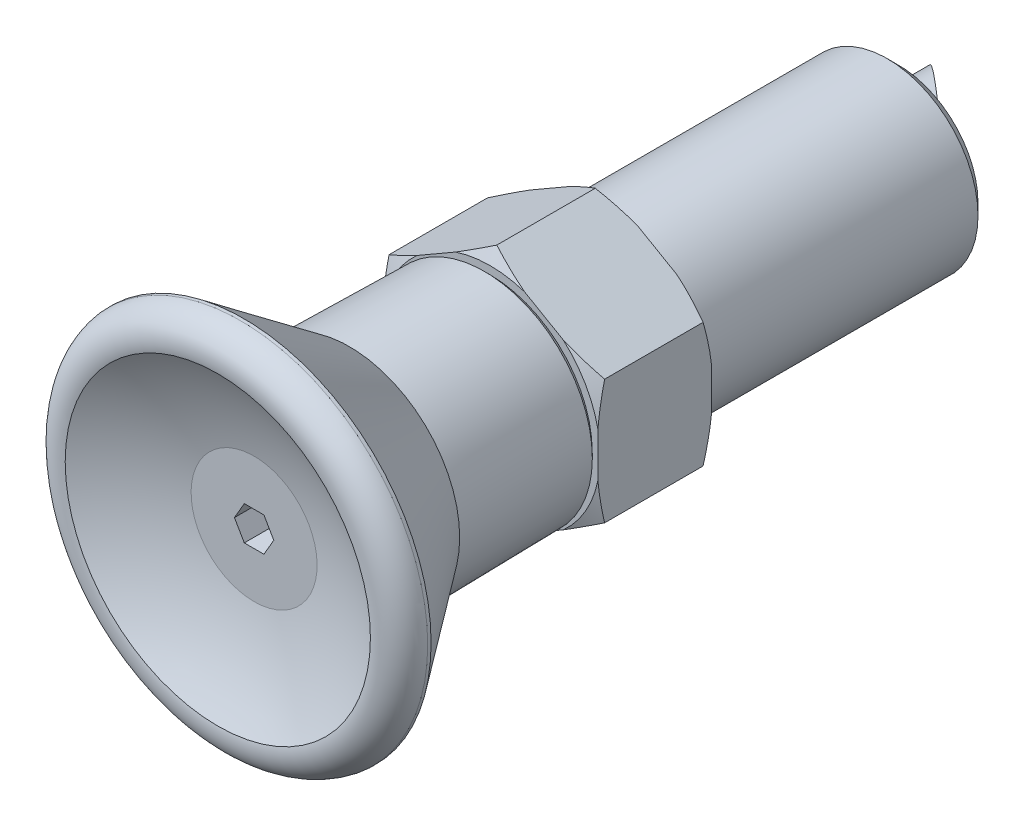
ISO-10303-21;
HEADER;
FILE_DESCRIPTION(('STEP AP214'),'2;1');
FILE_NAME('part.step','',(''),(''),'','','');
FILE_SCHEMA(('AUTOMOTIVE_DESIGN { 1 0 10303 214 1 1 1 1 }'));
ENDSEC;
DATA;
#1=APPLICATION_CONTEXT('core data for automotive mechanical design processes');
#2=APPLICATION_PROTOCOL_DEFINITION('international standard','automotive_design',2000,#1);
#3=PRODUCT_CONTEXT('',#1,'mechanical');
#4=PRODUCT('Part','Part','',(#3));
#5=PRODUCT_RELATED_PRODUCT_CATEGORY('part','',(#4));
#6=PRODUCT_DEFINITION_FORMATION('','',#4);
#7=PRODUCT_DEFINITION_CONTEXT('part definition',#1,'design');
#8=PRODUCT_DEFINITION('design','',#6,#7);
#9=PRODUCT_DEFINITION_SHAPE('','',#8);
#10=(LENGTH_UNIT() NAMED_UNIT(*) SI_UNIT(.MILLI.,.METRE.));
#11=(NAMED_UNIT(*) PLANE_ANGLE_UNIT() SI_UNIT($,.RADIAN.));
#12=(NAMED_UNIT(*) SI_UNIT($,.STERADIAN.) SOLID_ANGLE_UNIT());
#13=UNCERTAINTY_MEASURE_WITH_UNIT(LENGTH_MEASURE(1.E-05),#10,'distance_accuracy_value','');
#14=(GEOMETRIC_REPRESENTATION_CONTEXT(3) GLOBAL_UNCERTAINTY_ASSIGNED_CONTEXT((#13)) GLOBAL_UNIT_ASSIGNED_CONTEXT((#10,
#11,#12)) REPRESENTATION_CONTEXT('',''));
#15=CARTESIAN_POINT('',(0.,0.,0.));
#16=DIRECTION('',(0.,0.,1.));
#17=DIRECTION('',(1.,0.,0.));
#18=AXIS2_PLACEMENT_3D('',#15,#16,#17);
#19=CARTESIAN_POINT('',(0.,0.,30.8));
#20=DIRECTION('',(0.,0.,-1.));
#21=DIRECTION('',(1.,0.,0.));
#22=AXIS2_PLACEMENT_3D('',#19,#20,#21);
#23=PLANE('',#22);
#24=CARTESIAN_POINT('',(0.,0.,30.8));
#25=DIRECTION('',(0.,0.,-1.));
#26=DIRECTION('',(1.,0.,0.));
#27=AXIS2_PLACEMENT_3D('',#24,#25,#26);
#28=CIRCLE('',#27,5.55337735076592);
#29=CARTESIAN_POINT('',(0.,-5.55337735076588,30.8));
#30=VERTEX_POINT('',#29);
#31=EDGE_CURVE('E782',#30,#30,#28,.T.);
#32=ORIENTED_EDGE('',*,*,#31,.F.);
#33=EDGE_LOOP('',(#32));
#34=FACE_BOUND('',#33,.T.);
#35=DIRECTION('',(0.5,-0.866025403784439,0.));
#36=VECTOR('',#35,1.);
#37=CARTESIAN_POINT('',(-1.73205080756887,0.,30.8));
#38=LINE('',#37,#36);
#39=CARTESIAN_POINT('',(-1.73205080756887,0.,30.8));
#40=VERTEX_POINT('',#39);
#41=CARTESIAN_POINT('',(-0.866025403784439,-1.5,30.8));
#42=VERTEX_POINT('',#41);
#43=EDGE_CURVE('E450',#40,#42,#38,.T.);
#44=ORIENTED_EDGE('',*,*,#43,.F.);
#45=DIRECTION('',(-0.5,-0.866025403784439,0.));
#46=VECTOR('',#45,1.);
#47=CARTESIAN_POINT('',(-0.866025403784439,1.5,30.8));
#48=LINE('',#47,#46);
#49=CARTESIAN_POINT('',(-0.866025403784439,1.5,30.8));
#50=VERTEX_POINT('',#49);
#51=EDGE_CURVE('E447',#50,#40,#48,.T.);
#52=ORIENTED_EDGE('',*,*,#51,.F.);
#53=DIRECTION('',(-1.,0.,0.));
#54=VECTOR('',#53,1.);
#55=CARTESIAN_POINT('',(0.866025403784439,1.5,30.8));
#56=LINE('',#55,#54);
#57=CARTESIAN_POINT('',(0.866025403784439,1.5,30.8));
#58=VERTEX_POINT('',#57);
#59=EDGE_CURVE('E444',#58,#50,#56,.T.);
#60=ORIENTED_EDGE('',*,*,#59,.F.);
#61=DIRECTION('',(-0.5,0.866025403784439,0.));
#62=VECTOR('',#61,1.);
#63=CARTESIAN_POINT('',(1.73205080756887,0.,30.8));
#64=LINE('',#63,#62);
#65=CARTESIAN_POINT('',(1.73205080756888,0.,30.8));
#66=VERTEX_POINT('',#65);
#67=EDGE_CURVE('E428',#66,#58,#64,.T.);
#68=ORIENTED_EDGE('',*,*,#67,.F.);
#69=DIRECTION('',(0.5,0.866025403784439,0.));
#70=VECTOR('',#69,1.);
#71=CARTESIAN_POINT('',(0.866025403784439,-1.5,30.8));
#72=LINE('',#71,#70);
#73=CARTESIAN_POINT('',(0.866025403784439,-1.5,30.8));
#74=VERTEX_POINT('',#73);
#75=EDGE_CURVE('E453',#74,#66,#72,.T.);
#76=ORIENTED_EDGE('',*,*,#75,.F.);
#77=DIRECTION('',(-1.,0.,0.));
#78=VECTOR('',#77,1.);
#79=CARTESIAN_POINT('',(0.,-1.5,30.8));
#80=LINE('',#79,#78);
#81=EDGE_CURVE('E805',#74,#42,#80,.T.);
#82=ORIENTED_EDGE('',*,*,#81,.T.);
#83=EDGE_LOOP('',(#44,#52,#60,#68,#76,#82));
#84=FACE_BOUND('',#83,.T.);
#85=ADVANCED_FACE('F15',(#34,#84),#23,.F.);
#86=CARTESIAN_POINT('',(0.,0.,56.2));
#87=DIRECTION('',(0.,0.,-1.));
#88=DIRECTION('',(0.,-1.,0.));
#89=AXIS2_PLACEMENT_3D('',#86,#87,#88);
#90=SPHERICAL_SURFACE('',#89,26.);
#91=CARTESIAN_POINT('',(0.,0.,34.));
#92=DIRECTION('',(0.,0.,-1.));
#93=DIRECTION('',(1.,0.,0.));
#94=AXIS2_PLACEMENT_3D('',#91,#92,#93);
#95=CIRCLE('',#94,13.5336617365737);
#96=CARTESIAN_POINT('',(0.,-13.5336617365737,34.));
#97=VERTEX_POINT('',#96);
#98=EDGE_CURVE('E779',#97,#97,#95,.T.);
#99=CARTESIAN_POINT('',(0.,-13.5336617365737,34.));
#100=CARTESIAN_POINT('',(0.,-13.4568366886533,33.9531655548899));
#101=CARTESIAN_POINT('',(0.,-13.3797685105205,33.9067299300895));
#102=CARTESIAN_POINT('',(0.,-13.2251542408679,33.8146612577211));
#103=CARTESIAN_POINT('',(0.,-13.1476081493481,33.7690282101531));
#104=CARTESIAN_POINT('',(0.,-12.9920463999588,33.6785696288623));
#105=CARTESIAN_POINT('',(0.,-12.9140307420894,33.6337440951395));
#106=CARTESIAN_POINT('',(0.,-12.7575382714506,33.54490536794));
#107=CARTESIAN_POINT('',(0.,-12.6790614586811,33.5008921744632));
#108=CARTESIAN_POINT('',(0.,-12.5216551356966,33.4136828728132));
#109=CARTESIAN_POINT('',(0.,-12.4427256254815,33.3704867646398));
#110=CARTESIAN_POINT('',(0.,-12.2844224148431,33.2849162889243));
#111=CARTESIAN_POINT('',(0.,-12.2050487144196,33.2425419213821));
#112=CARTESIAN_POINT('',(0.,-12.0458656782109,33.1586194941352));
#113=CARTESIAN_POINT('',(0.,-11.9660563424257,33.1170714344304));
#114=CARTESIAN_POINT('',(0.,-11.8060106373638,33.0348061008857));
#115=CARTESIAN_POINT('',(0.,-11.7257742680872,32.9940888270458));
#116=CARTESIAN_POINT('',(0.,-11.5648831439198,32.913489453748));
#117=CARTESIAN_POINT('',(0.,-11.4842283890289,32.8736073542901));
#118=CARTESIAN_POINT('',(0.,-11.3225091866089,32.7946826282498));
#119=CARTESIAN_POINT('',(0.,-11.2414447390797,32.7556400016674));
#120=CARTESIAN_POINT('',(0.,-11.0789148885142,32.6783984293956));
#121=CARTESIAN_POINT('',(0.,-10.9974494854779,32.640199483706));
#122=CARTESIAN_POINT('',(0.,-10.8341265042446,32.5646493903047));
#123=CARTESIAN_POINT('',(0.,-10.7522689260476,32.5272982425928));
#124=CARTESIAN_POINT('',(0.,-10.5881704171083,32.4534477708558));
#125=CARTESIAN_POINT('',(0.,-10.5059294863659,32.4169484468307));
#126=CARTESIAN_POINT('',(0.,-10.3410731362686,32.3448055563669));
#127=CARTESIAN_POINT('',(0.,-10.2584577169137,32.3091619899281));
#128=CARTESIAN_POINT('',(0.,-10.0928612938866,32.2387344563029));
#129=CARTESIAN_POINT('',(0.,-10.0098802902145,32.2039504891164));
#130=CARTESIAN_POINT('',(0.,-9.84356164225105,32.135245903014));
#131=CARTESIAN_POINT('',(0.,-9.76022399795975,32.101325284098));
#132=CARTESIAN_POINT('',(0.,-9.59320105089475,32.0343510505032));
#133=CARTESIAN_POINT('',(0.,-9.50951574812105,32.0012974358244));
#134=CARTESIAN_POINT('',(0.,-9.34180650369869,31.9360607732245));
#135=CARTESIAN_POINT('',(0.,-9.25778256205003,31.9038777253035));
#136=CARTESIAN_POINT('',(0.,-9.08940509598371,31.8403856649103));
#137=CARTESIAN_POINT('',(0.,-9.00505157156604,31.8090766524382));
#138=CARTESIAN_POINT('',(0.,-8.8360240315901,31.7473360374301));
#139=CARTESIAN_POINT('',(0.,-8.75135001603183,31.7169044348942));
#140=CARTESIAN_POINT('',(0.,-8.58169061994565,31.6569219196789));
#141=CARTESIAN_POINT('',(0.,-8.49670523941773,31.6273710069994));
#142=CARTESIAN_POINT('',(0.,-8.32643227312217,31.5691530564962));
#143=CARTESIAN_POINT('',(0.,-8.24114468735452,31.5404860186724));
#144=CARTESIAN_POINT('',(0.,-8.07027650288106,31.4840389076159));
#145=CARTESIAN_POINT('',(0.,-7.98469590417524,31.4562588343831));
#146=CARTESIAN_POINT('',(0.,-7.81325091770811,31.4015886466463));
#147=CARTESIAN_POINT('',(0.,-7.7273865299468,31.3746985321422));
#148=CARTESIAN_POINT('',(0.,-7.55538321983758,31.3218111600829));
#149=CARTESIAN_POINT('',(0.,-7.46924429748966,31.2958139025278));
#150=CARTESIAN_POINT('',(0.,-7.29670120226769,31.244715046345));
#151=CARTESIAN_POINT('',(0.,-7.21029702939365,31.2196134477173));
#152=CARTESIAN_POINT('',(0.,-7.03723274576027,31.1703086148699));
#153=CARTESIAN_POINT('',(0.,-6.95057263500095,31.1461053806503));
#154=CARTESIAN_POINT('',(0.,-6.777005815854,31.0985998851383));
#155=CARTESIAN_POINT('',(0.,-6.69009910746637,31.0752976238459));
#156=CARTESIAN_POINT('',(0.,-6.51604845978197,31.0295965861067));
#157=CARTESIAN_POINT('',(0.,-6.4289045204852,31.0071978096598));
#158=CARTESIAN_POINT('',(0.,-6.25438880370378,30.9633061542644));
#159=CARTESIAN_POINT('',(0.,-6.16701702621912,30.9418132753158));
#160=CARTESIAN_POINT('',(0.,-5.99205504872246,30.8997357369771));
#161=CARTESIAN_POINT('',(0.,-5.90446484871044,30.879151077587));
#162=CARTESIAN_POINT('',(0.,-5.72907547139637,30.838892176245));
#163=CARTESIAN_POINT('',(0.,-5.64127629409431,30.819217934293));
#164=CARTESIAN_POINT('',(0.,-5.55337735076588,30.8));
#165=B_SPLINE_CURVE_WITH_KNOTS('',3,(#99,#100,#101,#102,#103,#104,#105,#106,#107,#108,#109,#110,
#111,#112,#113,#114,#115,#116,#117,#118,#119,#120,#121,#122,#123,#124,#125,#126,#127,#128,#129,
#130,#131,#132,#133,#134,#135,#136,#137,#138,#139,#140,#141,#142,#143,#144,#145,#146,#147,#148,
#149,#150,#151,#152,#153,#154,#155,#156,#157,#158,#159,#160,#161,#162,#163,#164),.UNSPECIFIED.,
.F.,.F.,(4,2,2,2,2,2,2,2,2,2,2,2,2,2,2,2,2,2,2,2,2,2,2,2,2,2,2,2,2,2,2,2,4),(0.,
0.269924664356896,0.539849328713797,0.809773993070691,1.07969865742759,1.34962332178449,
1.61954798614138,1.88947265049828,2.15939731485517,2.42932197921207,2.69924664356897,
2.96917130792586,3.23909597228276,3.50902063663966,3.77894530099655,4.04886996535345,
4.31879462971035,4.58871929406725,4.85864395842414,5.12856862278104,5.39849328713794,
5.66841795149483,5.93834261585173,6.20826728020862,6.47819194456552,6.74811660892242,
7.01804127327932,7.28796593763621,7.55789060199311,7.82781526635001,8.0977399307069,
8.3676645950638,8.63758925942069),.UNSPECIFIED.);
#166=EDGE_CURVE('BSEAM1002',#97,#30,#165,.T.);
#167=ORIENTED_EDGE('',*,*,#98,.F.);
#168=ORIENTED_EDGE('',*,*,#31,.T.);
#169=ORIENTED_EDGE('',*,*,#166,.T.);
#170=ORIENTED_EDGE('',*,*,#166,.F.);
#171=EDGE_LOOP('',(#167,#169,#168,#170));
#172=FACE_BOUND('',#171,.T.);
#173=ADVANCED_FACE('F1002',(#172),#90,.F.);
#174=CARTESIAN_POINT('',(0.,-13.5336617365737,34.));
#175=DIRECTION('',(0.,0.,1.));
#176=DIRECTION('',(-1.,0.,0.));
#177=AXIS2_PLACEMENT_3D('',#174,#175,#176);
#178=PLANE('',#177);
#179=CARTESIAN_POINT('',(0.,0.,34.));
#180=DIRECTION('',(0.,0.,-1.));
#181=DIRECTION('',(1.,0.,0.));
#182=AXIS2_PLACEMENT_3D('',#179,#180,#181);
#183=CIRCLE('',#182,13.45);
#184=CARTESIAN_POINT('',(13.45,0.,34.));
#185=VERTEX_POINT('',#184);
#186=EDGE_CURVE('E776',#185,#185,#183,.T.);
#187=ORIENTED_EDGE('',*,*,#186,.F.);
#188=EDGE_LOOP('',(#187));
#189=FACE_BOUND('',#188,.T.);
#190=ORIENTED_EDGE('',*,*,#98,.T.);
#191=EDGE_LOOP('',(#190));
#192=FACE_BOUND('',#191,.T.);
#193=ADVANCED_FACE('F1008',(#189,#192),#178,.F.);
#194=CARTESIAN_POINT('',(0.,0.,31.5699548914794));
#195=DIRECTION('',(0.,0.,-1.));
#196=DIRECTION('',(1.,0.,0.));
#197=AXIS2_PLACEMENT_3D('',#194,#195,#196);
#198=TOROIDAL_SURFACE('',#197,14.0372655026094,2.5);
#199=ORIENTED_EDGE('',*,*,#186,.T.);
#200=EDGE_LOOP('',(#199));
#201=FACE_BOUND('',#200,.T.);
#202=CARTESIAN_POINT('',(0.,0.,32.));
#203=DIRECTION('',(0.,0.,-1.));
#204=DIRECTION('',(1.,0.,0.));
#205=AXIS2_PLACEMENT_3D('',#202,#203,#204);
#206=CIRCLE('',#205,16.5);
#207=CARTESIAN_POINT('',(16.5,0.,32.));
#208=VERTEX_POINT('',#207);
#209=EDGE_CURVE('E773',#208,#208,#206,.T.);
#210=ORIENTED_EDGE('',*,*,#209,.F.);
#211=EDGE_LOOP('',(#210));
#212=FACE_BOUND('',#211,.T.);
#213=ADVANCED_FACE('F1589',(#201,#212),#198,.T.);
#214=CARTESIAN_POINT('',(0.,0.,-32.));
#215=DIRECTION('',(0.,0.,-1.));
#216=DIRECTION('',(1.,0.,0.));
#217=AXIS2_PLACEMENT_3D('',#214,#215,#216);
#218=CYLINDRICAL_SURFACE('',#217,16.5);
#219=CARTESIAN_POINT('',(0.,0.,31.7));
#220=DIRECTION('',(0.,0.,-1.));
#221=DIRECTION('',(1.,0.,0.));
#222=AXIS2_PLACEMENT_3D('',#219,#220,#221);
#223=CIRCLE('',#222,16.5);
#224=CARTESIAN_POINT('',(16.5,0.,31.7));
#225=VERTEX_POINT('',#224);
#226=EDGE_CURVE('E770',#225,#225,#223,.T.);
#227=ORIENTED_EDGE('',*,*,#226,.F.);
#228=EDGE_LOOP('',(#227));
#229=FACE_BOUND('',#228,.T.);
#230=ORIENTED_EDGE('',*,*,#209,.T.);
#231=EDGE_LOOP('',(#230));
#232=FACE_BOUND('',#231,.T.);
#233=ADVANCED_FACE('F1585',(#229,#232),#218,.T.);
#234=CARTESIAN_POINT('',(0.,0.,31.7));
#235=DIRECTION('',(0.,0.,1.));
#236=DIRECTION('',(-1.,0.,0.));
#237=AXIS2_PLACEMENT_3D('',#234,#235,#236);
#238=CONICAL_SURFACE('',#237,16.5,0.630063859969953);
#239=CARTESIAN_POINT('',(0.,0.,22.3973578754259));
#240=DIRECTION('',(0.,0.,-1.));
#241=DIRECTION('',(1.,0.,0.));
#242=AXIS2_PLACEMENT_3D('',#239,#240,#241);
#243=CIRCLE('',#242,9.71639668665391);
#244=CARTESIAN_POINT('',(9.71639668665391,0.,22.3973578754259));
#245=VERTEX_POINT('',#244);
#246=EDGE_CURVE('E767',#245,#245,#243,.T.);
#247=ORIENTED_EDGE('',*,*,#246,.F.);
#248=EDGE_LOOP('',(#247));
#249=FACE_BOUND('',#248,.T.);
#250=ORIENTED_EDGE('',*,*,#226,.T.);
#251=EDGE_LOOP('',(#250));
#252=FACE_BOUND('',#251,.T.);
#253=ADVANCED_FACE('F1577',(#249,#252),#238,.T.);
#254=CARTESIAN_POINT('',(0.,0.,22.3973578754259));
#255=DIRECTION('',(0.,0.,1.));
#256=DIRECTION('',(-1.,0.,0.));
#257=AXIS2_PLACEMENT_3D('',#254,#255,#256);
#258=CONICAL_SURFACE('',#257,9.71639668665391,0.0174532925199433);
#259=CARTESIAN_POINT('',(0.,0.,10.4999238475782));
#260=DIRECTION('',(0.,0.,-1.));
#261=DIRECTION('',(1.,0.,0.));
#262=AXIS2_PLACEMENT_3D('',#259,#260,#261);
#263=CIRCLE('',#262,9.50872620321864);
#264=CARTESIAN_POINT('',(9.50872620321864,0.,10.4999238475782));
#265=VERTEX_POINT('',#264);
#266=EDGE_CURVE('E764',#265,#265,#263,.T.);
#267=ORIENTED_EDGE('',*,*,#266,.F.);
#268=EDGE_LOOP('',(#267));
#269=FACE_BOUND('',#268,.T.);
#270=ORIENTED_EDGE('',*,*,#246,.T.);
#271=EDGE_LOOP('',(#270));
#272=FACE_BOUND('',#271,.T.);
#273=ADVANCED_FACE('F1571',(#269,#272),#258,.T.);
#274=CARTESIAN_POINT('',(0.,0.,10.4999238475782));
#275=DIRECTION('',(0.,0.,1.));
#276=DIRECTION('',(-1.,0.,0.));
#277=AXIS2_PLACEMENT_3D('',#274,#275,#276);
#278=CONICAL_SURFACE('',#277,9.50872620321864,0.79412480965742);
#279=CARTESIAN_POINT('',(0.,0.,10.));
#280=DIRECTION('',(0.,0.,-1.));
#281=DIRECTION('',(1.,0.,0.));
#282=AXIS2_PLACEMENT_3D('',#279,#280,#281);
#283=CIRCLE('',#282,9.);
#284=CARTESIAN_POINT('',(9.,0.,10.));
#285=VERTEX_POINT('',#284);
#286=EDGE_CURVE('E761',#285,#285,#283,.T.);
#287=ORIENTED_EDGE('',*,*,#286,.F.);
#288=EDGE_LOOP('',(#287));
#289=FACE_BOUND('',#288,.T.);
#290=ORIENTED_EDGE('',*,*,#266,.T.);
#291=EDGE_LOOP('',(#290));
#292=FACE_BOUND('',#291,.T.);
#293=ADVANCED_FACE('F1566',(#289,#292),#278,.T.);
#294=CARTESIAN_POINT('',(0.,0.,5.53198758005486));
#295=DIRECTION('',(0.,0.,-1.));
#296=DIRECTION('',(1.,0.,0.));
#297=AXIS2_PLACEMENT_3D('',#294,#295,#296);
#298=CONICAL_SURFACE('',#297,19.281683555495,1.13446401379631);
#299=CARTESIAN_POINT('',(7.1070086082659,15.0728884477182,6.75245659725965));
#300=CARTESIAN_POINT('',(6.91575077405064,14.9624656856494,6.83706318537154));
#301=CARTESIAN_POINT('',(6.72430205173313,14.8519327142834,6.92109411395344));
#302=CARTESIAN_POINT('',(6.34098043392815,14.6306218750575,7.08786370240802));
#303=CARTESIAN_POINT('',(6.14910753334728,14.5198440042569,7.17060234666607));
#304=CARTESIAN_POINT('',(5.57272763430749,14.1870709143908,7.41669452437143));
#305=CARTESIAN_POINT('',(5.18752737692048,13.9646754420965,7.57789413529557));
#306=CARTESIAN_POINT('',(4.41268181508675,13.5173181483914,7.89400312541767));
#307=CARTESIAN_POINT('',(4.02302368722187,13.2923489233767,8.04887073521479));
#308=CARTESIAN_POINT('',(3.24104768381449,12.8408748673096,8.34936253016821));
#309=CARTESIAN_POINT('',(2.84872992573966,12.6143701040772,8.49498712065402));
#310=CARTESIAN_POINT('',(2.06719811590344,12.163152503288,8.77222528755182));
#311=CARTESIAN_POINT('',(1.67803387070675,11.9384684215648,8.90402479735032));
#312=CARTESIAN_POINT('',(0.896175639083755,11.4870623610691,9.15308332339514));
#313=CARTESIAN_POINT('',(0.503481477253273,11.2603402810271,9.2703416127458));
#314=CARTESIAN_POINT('',(-0.284962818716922,10.8051317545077,9.48622383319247));
#315=CARTESIAN_POINT('',(-0.680705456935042,10.5766496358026,9.58488382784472));
#316=CARTESIAN_POINT('',(-1.4759326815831,10.1175249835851,9.75937201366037));
#317=CARTESIAN_POINT('',(-1.87541639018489,9.886882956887,9.83520542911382));
#318=CARTESIAN_POINT('',(-2.5987752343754,9.46925153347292,9.94734526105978));
#319=CARTESIAN_POINT('',(-2.92208439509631,9.28258890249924,9.98849040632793));
#320=CARTESIAN_POINT('',(-3.57013242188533,8.9084381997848,10.0512287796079));
#321=CARTESIAN_POINT('',(-3.89487121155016,8.72095017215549,10.0728230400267));
#322=CARTESIAN_POINT('',(-4.54482551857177,8.34569887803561,10.0953245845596));
#323=CARTESIAN_POINT('',(-4.87004092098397,8.15793567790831,10.0962362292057));
#324=CARTESIAN_POINT('',(-5.52001833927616,7.78267104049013,10.0773344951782));
#325=CARTESIAN_POINT('',(-5.84478034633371,7.5951696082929,10.0575207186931));
#326=CARTESIAN_POINT('',(-6.4934398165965,7.22066588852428,9.99816704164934));
#327=CARTESIAN_POINT('',(-6.81733512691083,7.03366484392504,9.95859627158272));
#328=CARTESIAN_POINT('',(-7.46309615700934,6.6608345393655,9.86159474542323));
#329=CARTESIAN_POINT('',(-7.78496180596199,6.47500532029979,9.80416336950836));
#330=CARTESIAN_POINT('',(-8.42654647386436,6.10458623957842,9.67370017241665));
#331=CARTESIAN_POINT('',(-8.74626359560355,5.91999747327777,9.60065605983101));
#332=CARTESIAN_POINT('',(-9.38319924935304,5.55226250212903,9.44137352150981));
#333=CARTESIAN_POINT('',(-9.70041778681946,5.36911629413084,9.35513512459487));
#334=CARTESIAN_POINT('',(-10.2978104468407,5.0242114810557,9.18171750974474));
#335=CARTESIAN_POINT('',(-10.5782347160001,4.86230845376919,9.09567697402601));
#336=CARTESIAN_POINT('',(-11.1372996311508,4.53953217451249,8.91624193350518));
#337=CARTESIAN_POINT('',(-11.4159403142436,4.37865890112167,8.82284758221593));
#338=CARTESIAN_POINT('',(-11.9714902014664,4.05791202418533,8.62991186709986));
#339=CARTESIAN_POINT('',(-12.2484000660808,3.89803803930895,8.53037302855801));
#340=CARTESIAN_POINT('',(-12.8007777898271,3.57912261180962,8.32609219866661));
#341=CARTESIAN_POINT('',(-13.0762456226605,3.42008118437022,8.22135011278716));
#342=CARTESIAN_POINT('',(-13.624603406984,3.10348666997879,8.00798369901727));
#343=CARTESIAN_POINT('',(-13.8974993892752,2.94593010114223,7.89937998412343));
#344=CARTESIAN_POINT('',(-14.4421717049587,2.63146339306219,7.67849059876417));
#345=CARTESIAN_POINT('',(-14.713948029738,2.47455325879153,7.56620490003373));
#346=CARTESIAN_POINT('',(-15.2564417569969,2.16134435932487,7.33853679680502));
#347=CARTESIAN_POINT('',(-15.527159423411,2.00504544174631,7.22315522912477));
#348=CARTESIAN_POINT('',(-16.0677132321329,1.69295655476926,6.98970949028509));
#349=CARTESIAN_POINT('',(-16.337549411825,1.5371665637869,6.87164543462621));
#350=CARTESIAN_POINT('',(-16.6070086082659,1.38159422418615,6.75245659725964));
#351=B_SPLINE_CURVE_WITH_KNOTS('',3,(#299,#300,#301,#302,#303,#304,#305,#306,#307,#308,#309,
#310,#311,#312,#313,#314,#315,#316,#317,#318,#319,#320,#321,#322,#323,#324,#325,#326,#327,#328,
#329,#330,#331,#332,#333,#334,#335,#336,#337,#338,#339,#340,#341,#342,#343,#344,#345,#346,#347,
#348,#349,#350),.UNSPECIFIED.,.F.,.F.,(4,2,2,2,2,2,2,2,2,2,2,2,2,2,2,2,2,2,2,2,2,2,2,2,2,4),(0.,
0.709490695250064,1.41898995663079,2.83824060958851,4.26569913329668,5.69309501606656,
7.0977993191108,8.5025738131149,9.90459566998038,11.3062964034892,12.4325957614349,
13.5588356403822,14.6848380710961,15.8108621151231,16.9386510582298,18.0664791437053,
19.1951984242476,20.3239152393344,21.32894409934,22.3339519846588,23.3385495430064,
24.3431653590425,25.3430486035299,26.3429395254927,27.3425628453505,28.3421432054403),.UNSPECIFIED.);
#352=CARTESIAN_POINT('',(-6.44705627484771,7.2474454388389,10.));
#353=VERTEX_POINT('',#352);
#354=CARTESIAN_POINT('',(-9.5,5.48482755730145,9.40795009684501));
#355=VERTEX_POINT('',#354);
#356=EDGE_CURVE('E511',#353,#355,#351,.T.);
#357=ORIENTED_EDGE('',*,*,#356,.T.);
#358=CARTESIAN_POINT('',(-9.5,12.5918361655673,7.16786512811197));
#359=CARTESIAN_POINT('',(-9.5,12.3814337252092,7.24618461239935));
#360=CARTESIAN_POINT('',(-9.5,12.1708003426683,7.32388328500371));
#361=CARTESIAN_POINT('',(-9.5,11.7490220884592,7.47788989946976));
#362=CARTESIAN_POINT('',(-9.5,11.5378772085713,7.55419781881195));
#363=CARTESIAN_POINT('',(-9.5,10.9035222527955,7.78083975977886));
#364=CARTESIAN_POINT('',(-9.5,10.4794802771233,7.92885891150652));
#365=CARTESIAN_POINT('',(-9.5,9.62612238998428,8.21809412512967));
#366=CARTESIAN_POINT('',(-9.5,9.19679008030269,8.35926198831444));
#367=CARTESIAN_POINT('',(-9.5,8.33502304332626,8.63177317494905));
#368=CARTESIAN_POINT('',(-9.5,7.90258847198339,8.7631169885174));
#369=CARTESIAN_POINT('',(-9.5,7.04192778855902,9.01115219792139));
#370=CARTESIAN_POINT('',(-9.5,6.61376585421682,9.12806462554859));
#371=CARTESIAN_POINT('',(-9.5,5.75356744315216,9.34688273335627));
#372=CARTESIAN_POINT('',(-9.5,5.32153082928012,9.44878788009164));
#373=CARTESIAN_POINT('',(-9.5,4.45443198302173,9.63375844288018));
#374=CARTESIAN_POINT('',(-9.5,4.01937900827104,9.71686669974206));
#375=CARTESIAN_POINT('',(-9.5,3.14555799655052,9.86062771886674));
#376=CARTESIAN_POINT('',(-9.5,2.70679042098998,9.92128322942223));
#377=CARTESIAN_POINT('',(-9.5,1.89148352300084,10.009514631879));
#378=CARTESIAN_POINT('',(-9.5,1.51533270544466,10.0406549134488));
#379=CARTESIAN_POINT('',(-9.5,0.761888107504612,10.0824595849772));
#380=CARTESIAN_POINT('',(-9.5,0.384594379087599,10.0931248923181));
#381=CARTESIAN_POINT('',(-9.5,-0.370085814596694,10.0933955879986));
#382=CARTESIAN_POINT('',(-9.5,-0.747472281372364,10.0829961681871));
#383=CARTESIAN_POINT('',(-9.5,-1.5011153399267,10.0416973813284));
#384=CARTESIAN_POINT('',(-9.5,-1.87737189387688,10.0107973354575));
#385=CARTESIAN_POINT('',(-9.5,-2.62851221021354,9.92999040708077));
#386=CARTESIAN_POINT('',(-9.5,-3.00339213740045,9.88004841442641));
#387=CARTESIAN_POINT('',(-9.5,-3.75053612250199,9.76336125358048));
#388=CARTESIAN_POINT('',(-9.5,-4.1227998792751,9.69661418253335));
#389=CARTESIAN_POINT('',(-9.5,-4.86460039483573,9.54871100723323));
#390=CARTESIAN_POINT('',(-9.5,-5.23413582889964,9.46754832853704));
#391=CARTESIAN_POINT('',(-9.5,-5.97031857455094,9.29317044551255));
#392=CARTESIAN_POINT('',(-9.5,-6.33696593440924,9.19995544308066));
#393=CARTESIAN_POINT('',(-9.5,-7.20294186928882,8.96717741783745));
#394=CARTESIAN_POINT('',(-9.5,-7.70108997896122,8.82323958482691));
#395=CARTESIAN_POINT('',(-9.5,-8.69275857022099,8.52114531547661));
#396=CARTESIAN_POINT('',(-9.5,-9.18628103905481,8.36299532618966));
#397=CARTESIAN_POINT('',(-9.5,-10.1667845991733,8.03670768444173));
#398=CARTESIAN_POINT('',(-9.5,-10.653787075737,7.86863399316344));
#399=CARTESIAN_POINT('',(-9.5,-11.3820871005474,7.61022716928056));
#400=CARTESIAN_POINT('',(-9.5,-11.6245075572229,7.52303429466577));
#401=CARTESIAN_POINT('',(-9.5,-12.1086651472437,7.34678779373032));
#402=CARTESIAN_POINT('',(-9.5,-12.3504022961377,7.25773421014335));
#403=CARTESIAN_POINT('',(-9.5,-12.5918361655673,7.16786512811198));
#404=B_SPLINE_CURVE_WITH_KNOTS('',3,(#358,#359,#360,#361,#362,#363,#364,#365,#366,#367,#368,
#369,#370,#371,#372,#373,#374,#375,#376,#377,#378,#379,#380,#381,#382,#383,#384,#385,#386,#387,
#388,#389,#390,#391,#392,#393,#394,#395,#396,#397,#398,#399,#400,#401,#402,#403),.UNSPECIFIED.,
.F.,.F.,(4,2,2,2,2,2,2,2,2,2,2,2,2,2,2,2,2,2,2,2,2,2,4),(0.,0.673517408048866,1.34704571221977,
2.69438547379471,4.05013013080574,5.40580710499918,6.73710324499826,8.06844669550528,
9.3967245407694,10.7248397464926,11.8566391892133,12.9883879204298,14.1203950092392,
15.2524395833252,16.386581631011,17.5208521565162,18.6556413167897,19.7904114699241,
21.3456880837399,22.900262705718,24.4457271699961,25.2185943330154,25.9914437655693),.UNSPECIFIED.);
#405=CARTESIAN_POINT('',(-9.5,1.95959179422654,10.));
#406=VERTEX_POINT('',#405);
#407=EDGE_CURVE('E662',#355,#406,#404,.T.);
#408=ORIENTED_EDGE('',*,*,#407,.T.);
#409=CARTESIAN_POINT('',(0.,0.,10.));
#410=DIRECTION('',(0.,0.,-1.));
#411=DIRECTION('',(1.,0.,0.));
#412=AXIS2_PLACEMENT_3D('',#409,#410,#411);
#413=CIRCLE('',#412,9.7);
#414=EDGE_CURVE('E899',#406,#353,#413,.T.);
#415=ORIENTED_EDGE('',*,*,#414,.T.);
#416=EDGE_LOOP('',(#357,#408,#415));
#417=FACE_BOUND('',#416,.T.);
#418=ADVANCED_FACE('F569',(#417),#298,.T.);
#419=CARTESIAN_POINT('',(-9.5,-1.95959179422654,10.));
#420=VERTEX_POINT('',#419);
#421=CARTESIAN_POINT('',(-9.5,-5.48482755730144,9.40795009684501));
#422=VERTEX_POINT('',#421);
#423=EDGE_CURVE('E576',#420,#422,#404,.T.);
#424=ORIENTED_EDGE('',*,*,#423,.T.);
#425=CARTESIAN_POINT('',(-16.6070086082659,-1.38159422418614,6.75245659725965));
#426=CARTESIAN_POINT('',(-16.4157507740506,-1.49201698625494,6.83706318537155));
#427=CARTESIAN_POINT('',(-16.2243020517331,-1.60254995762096,6.92109411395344));
#428=CARTESIAN_POINT('',(-15.8409804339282,-1.82386079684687,7.08786370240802));
#429=CARTESIAN_POINT('',(-15.6491075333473,-1.93463866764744,7.17060234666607));
#430=CARTESIAN_POINT('',(-15.0727276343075,-2.26741175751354,7.41669452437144));
#431=CARTESIAN_POINT('',(-14.6875273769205,-2.48980722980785,7.57789413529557));
#432=CARTESIAN_POINT('',(-13.9126818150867,-2.93716452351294,7.89400312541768));
#433=CARTESIAN_POINT('',(-13.5230236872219,-3.16213374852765,8.0488707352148));
#434=CARTESIAN_POINT('',(-12.7410476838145,-3.61360780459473,8.34936253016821));
#435=CARTESIAN_POINT('',(-12.3487299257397,-3.84011256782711,8.49498712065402));
#436=CARTESIAN_POINT('',(-11.5671981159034,-4.2913301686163,8.77222528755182));
#437=CARTESIAN_POINT('',(-11.1780338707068,-4.51601425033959,8.90402479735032));
#438=CARTESIAN_POINT('',(-10.3961756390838,-4.96742031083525,9.15308332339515));
#439=CARTESIAN_POINT('',(-10.0034814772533,-5.19414239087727,9.2703416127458));
#440=CARTESIAN_POINT('',(-9.21503718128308,-5.64935091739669,9.48622383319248));
#441=CARTESIAN_POINT('',(-8.81929454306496,-5.87783303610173,9.58488382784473));
#442=CARTESIAN_POINT('',(-8.0240673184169,-6.33695768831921,9.75937201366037));
#443=CARTESIAN_POINT('',(-7.6245836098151,-6.56759971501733,9.83520542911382));
#444=CARTESIAN_POINT('',(-6.9012247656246,-6.98523113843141,9.94734526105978));
#445=CARTESIAN_POINT('',(-6.57791560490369,-7.1718937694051,9.98849040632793));
#446=CARTESIAN_POINT('',(-5.92986757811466,-7.54604447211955,10.0512287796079));
#447=CARTESIAN_POINT('',(-5.60512878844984,-7.73353249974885,10.0728230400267));
#448=CARTESIAN_POINT('',(-4.95517448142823,-8.10878379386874,10.0953245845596));
#449=CARTESIAN_POINT('',(-4.62995907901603,-8.29654699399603,10.0962362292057));
#450=CARTESIAN_POINT('',(-3.97998166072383,-8.67181163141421,10.0773344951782));
#451=CARTESIAN_POINT('',(-3.65521965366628,-8.85931306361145,10.0575207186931));
#452=CARTESIAN_POINT('',(-3.00656018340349,-9.23381678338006,9.99816704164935));
#453=CARTESIAN_POINT('',(-2.68266487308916,-9.4208178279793,9.95859627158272));
#454=CARTESIAN_POINT('',(-2.03690384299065,-9.79364813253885,9.86159474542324));
#455=CARTESIAN_POINT('',(-1.715038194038,-9.97947735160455,9.80416336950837));
#456=CARTESIAN_POINT('',(-1.07345352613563,-10.3498964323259,9.67370017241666));
#457=CARTESIAN_POINT('',(-0.753736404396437,-10.5344851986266,9.60065605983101));
#458=CARTESIAN_POINT('',(-0.116800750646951,-10.9022201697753,9.44137352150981));
#459=CARTESIAN_POINT('',(0.200417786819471,-11.0853663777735,9.35513512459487));
#460=CARTESIAN_POINT('',(0.79781044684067,-11.4302711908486,9.18171750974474));
#461=CARTESIAN_POINT('',(1.07823471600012,-11.5921742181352,9.09567697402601));
#462=CARTESIAN_POINT('',(1.63729963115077,-11.9149504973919,8.91624193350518));
#463=CARTESIAN_POINT('',(1.91594031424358,-12.0758237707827,8.82284758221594));
#464=CARTESIAN_POINT('',(2.47149020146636,-12.396570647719,8.62991186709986));
#465=CARTESIAN_POINT('',(2.74840006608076,-12.5564446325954,8.53037302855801));
#466=CARTESIAN_POINT('',(3.30077778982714,-12.8753600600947,8.32609219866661));
#467=CARTESIAN_POINT('',(3.57624562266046,-13.0344014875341,8.22135011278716));
#468=CARTESIAN_POINT('',(4.12460340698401,-13.3509960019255,8.00798369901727));
#469=CARTESIAN_POINT('',(4.39749938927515,-13.5085525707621,7.89937998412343));
#470=CARTESIAN_POINT('',(4.94217170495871,-13.8230192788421,7.67849059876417));
#471=CARTESIAN_POINT('',(5.21394802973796,-13.9799294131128,7.56620490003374));
#472=CARTESIAN_POINT('',(5.75644175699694,-14.2931383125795,7.33853679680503));
#473=CARTESIAN_POINT('',(6.02715942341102,-14.449437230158,7.22315522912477));
#474=CARTESIAN_POINT('',(6.5677132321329,-14.7615261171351,6.98970949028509));
#475=CARTESIAN_POINT('',(6.83754941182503,-14.9173161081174,6.87164543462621));
#476=CARTESIAN_POINT('',(7.10700860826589,-15.0728884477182,6.75245659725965));
#477=B_SPLINE_CURVE_WITH_KNOTS('',3,(#425,#426,#427,#428,#429,#430,#431,#432,#433,#434,#435,
#436,#437,#438,#439,#440,#441,#442,#443,#444,#445,#446,#447,#448,#449,#450,#451,#452,#453,#454,
#455,#456,#457,#458,#459,#460,#461,#462,#463,#464,#465,#466,#467,#468,#469,#470,#471,#472,#473,
#474,#475,#476),.UNSPECIFIED.,.F.,.F.,(4,2,2,2,2,2,2,2,2,2,2,2,2,2,2,2,2,2,2,2,2,2,2,2,2,4),(0.,
0.709490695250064,1.41898995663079,2.83824060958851,4.26569913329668,5.69309501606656,
7.0977993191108,8.5025738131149,9.90459566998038,11.3062964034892,12.4325957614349,
13.5588356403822,14.6848380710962,15.8108621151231,16.9386510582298,18.0664791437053,
19.1951984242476,20.3239152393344,21.32894409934,22.3339519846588,23.3385495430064,
24.3431653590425,25.3430486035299,26.3429395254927,27.3425628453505,28.3421432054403),.UNSPECIFIED.);
#478=CARTESIAN_POINT('',(-6.44705627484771,-7.2474454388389,10.));
#479=VERTEX_POINT('',#478);
#480=EDGE_CURVE('E644',#422,#479,#477,.T.);
#481=ORIENTED_EDGE('',*,*,#480,.T.);
#482=EDGE_CURVE('E897',#479,#420,#413,.T.);
#483=ORIENTED_EDGE('',*,*,#482,.T.);
#484=EDGE_LOOP('',(#424,#481,#483));
#485=FACE_BOUND('',#484,.T.);
#486=ADVANCED_FACE('F1557',(#485),#298,.T.);
#487=CARTESIAN_POINT('',(3.05294372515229,-9.20703723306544,10.));
#488=VERTEX_POINT('',#487);
#489=CARTESIAN_POINT('',(-3.05294372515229,-9.20703723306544,10.));
#490=VERTEX_POINT('',#489);
#491=EDGE_CURVE('E712',#488,#490,#413,.T.);
#492=ORIENTED_EDGE('',*,*,#491,.T.);
#493=CARTESIAN_POINT('',(0.,-10.9696551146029,9.40795009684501));
#494=VERTEX_POINT('',#493);
#495=EDGE_CURVE('E584',#490,#494,#477,.T.);
#496=ORIENTED_EDGE('',*,*,#495,.T.);
#497=CARTESIAN_POINT('',(-7.1070086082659,-15.0728884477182,6.75245659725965));
#498=CARTESIAN_POINT('',(-6.91575077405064,-14.9624656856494,6.83706318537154));
#499=CARTESIAN_POINT('',(-6.72430205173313,-14.8519327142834,6.92109411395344));
#500=CARTESIAN_POINT('',(-6.34098043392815,-14.6306218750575,7.08786370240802));
#501=CARTESIAN_POINT('',(-6.14910753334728,-14.5198440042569,7.17060234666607));
#502=CARTESIAN_POINT('',(-5.57272763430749,-14.1870709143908,7.41669452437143));
#503=CARTESIAN_POINT('',(-5.18752737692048,-13.9646754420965,7.57789413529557));
#504=CARTESIAN_POINT('',(-4.41268181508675,-13.5173181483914,7.89400312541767));
#505=CARTESIAN_POINT('',(-4.02302368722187,-13.2923489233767,8.04887073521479));
#506=CARTESIAN_POINT('',(-3.24104768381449,-12.8408748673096,8.34936253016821));
#507=CARTESIAN_POINT('',(-2.84872992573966,-12.6143701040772,8.49498712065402));
#508=CARTESIAN_POINT('',(-2.06719811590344,-12.163152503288,8.77222528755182));
#509=CARTESIAN_POINT('',(-1.67803387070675,-11.9384684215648,8.90402479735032));
#510=CARTESIAN_POINT('',(-0.896175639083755,-11.4870623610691,9.15308332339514));
#511=CARTESIAN_POINT('',(-0.503481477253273,-11.2603402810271,9.2703416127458));
#512=CARTESIAN_POINT('',(0.284962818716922,-10.8051317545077,9.48622383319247));
#513=CARTESIAN_POINT('',(0.680705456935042,-10.5766496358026,9.58488382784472));
#514=CARTESIAN_POINT('',(1.4759326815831,-10.1175249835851,9.75937201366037));
#515=CARTESIAN_POINT('',(1.87541639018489,-9.886882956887,9.83520542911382));
#516=CARTESIAN_POINT('',(2.5987752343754,-9.46925153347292,9.94734526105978));
#517=CARTESIAN_POINT('',(2.92208439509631,-9.28258890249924,9.98849040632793));
#518=CARTESIAN_POINT('',(3.57013242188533,-8.9084381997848,10.0512287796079));
#519=CARTESIAN_POINT('',(3.89487121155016,-8.72095017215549,10.0728230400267));
#520=CARTESIAN_POINT('',(4.54482551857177,-8.34569887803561,10.0953245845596));
#521=CARTESIAN_POINT('',(4.87004092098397,-8.15793567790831,10.0962362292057));
#522=CARTESIAN_POINT('',(5.52001833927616,-7.78267104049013,10.0773344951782));
#523=CARTESIAN_POINT('',(5.84478034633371,-7.5951696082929,10.0575207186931));
#524=CARTESIAN_POINT('',(6.4934398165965,-7.22066588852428,9.99816704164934));
#525=CARTESIAN_POINT('',(6.81733512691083,-7.03366484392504,9.95859627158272));
#526=CARTESIAN_POINT('',(7.46309615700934,-6.6608345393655,9.86159474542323));
#527=CARTESIAN_POINT('',(7.78496180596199,-6.47500532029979,9.80416336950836));
#528=CARTESIAN_POINT('',(8.42654647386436,-6.10458623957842,9.67370017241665));
#529=CARTESIAN_POINT('',(8.74626359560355,-5.91999747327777,9.60065605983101));
#530=CARTESIAN_POINT('',(9.38319924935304,-5.55226250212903,9.44137352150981));
#531=CARTESIAN_POINT('',(9.70041778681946,-5.36911629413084,9.35513512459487));
#532=CARTESIAN_POINT('',(10.2978104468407,-5.0242114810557,9.18171750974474));
#533=CARTESIAN_POINT('',(10.5782347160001,-4.86230845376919,9.09567697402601));
#534=CARTESIAN_POINT('',(11.1372996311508,-4.53953217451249,8.91624193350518));
#535=CARTESIAN_POINT('',(11.4159403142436,-4.37865890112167,8.82284758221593));
#536=CARTESIAN_POINT('',(11.9714902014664,-4.05791202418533,8.62991186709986));
#537=CARTESIAN_POINT('',(12.2484000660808,-3.89803803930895,8.53037302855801));
#538=CARTESIAN_POINT('',(12.8007777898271,-3.57912261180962,8.32609219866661));
#539=CARTESIAN_POINT('',(13.0762456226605,-3.42008118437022,8.22135011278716));
#540=CARTESIAN_POINT('',(13.624603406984,-3.10348666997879,8.00798369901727));
#541=CARTESIAN_POINT('',(13.8974993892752,-2.94593010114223,7.89937998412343));
#542=CARTESIAN_POINT('',(14.4421717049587,-2.63146339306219,7.67849059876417));
#543=CARTESIAN_POINT('',(14.713948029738,-2.47455325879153,7.56620490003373));
#544=CARTESIAN_POINT('',(15.2564417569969,-2.16134435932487,7.33853679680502));
#545=CARTESIAN_POINT('',(15.527159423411,-2.00504544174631,7.22315522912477));
#546=CARTESIAN_POINT('',(16.0677132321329,-1.69295655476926,6.98970949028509));
#547=CARTESIAN_POINT('',(16.337549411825,-1.5371665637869,6.87164543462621));
#548=CARTESIAN_POINT('',(16.6070086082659,-1.38159422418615,6.75245659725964));
#549=B_SPLINE_CURVE_WITH_KNOTS('',3,(#497,#498,#499,#500,#501,#502,#503,#504,#505,#506,#507,
#508,#509,#510,#511,#512,#513,#514,#515,#516,#517,#518,#519,#520,#521,#522,#523,#524,#525,#526,
#527,#528,#529,#530,#531,#532,#533,#534,#535,#536,#537,#538,#539,#540,#541,#542,#543,#544,#545,
#546,#547,#548),.UNSPECIFIED.,.F.,.F.,(4,2,2,2,2,2,2,2,2,2,2,2,2,2,2,2,2,2,2,2,2,2,2,2,2,4),(0.,
0.709490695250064,1.41898995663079,2.83824060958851,4.26569913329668,5.69309501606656,
7.0977993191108,8.5025738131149,9.90459566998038,11.3062964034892,12.4325957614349,
13.5588356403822,14.6848380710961,15.8108621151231,16.9386510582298,18.0664791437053,
19.1951984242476,20.3239152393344,21.32894409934,22.3339519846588,23.3385495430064,
24.3431653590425,25.3430486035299,26.3429395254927,27.3425628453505,28.3421432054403),.UNSPECIFIED.);
#550=EDGE_CURVE('E1548',#494,#488,#549,.T.);
#551=ORIENTED_EDGE('',*,*,#550,.T.);
#552=EDGE_LOOP('',(#492,#496,#551));
#553=FACE_BOUND('',#552,.T.);
#554=ADVANCED_FACE('F1549',(#553),#298,.T.);
#555=CARTESIAN_POINT('',(6.44705627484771,-7.2474454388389,10.));
#556=VERTEX_POINT('',#555);
#557=CARTESIAN_POINT('',(9.5,-5.48482755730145,9.40795009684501));
#558=VERTEX_POINT('',#557);
#559=EDGE_CURVE('E591',#556,#558,#549,.T.);
#560=ORIENTED_EDGE('',*,*,#559,.T.);
#561=CARTESIAN_POINT('',(9.5,-12.5918361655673,7.16786512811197));
#562=CARTESIAN_POINT('',(9.5,-12.3814337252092,7.24618461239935));
#563=CARTESIAN_POINT('',(9.5,-12.1708003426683,7.32388328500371));
#564=CARTESIAN_POINT('',(9.5,-11.7490220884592,7.47788989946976));
#565=CARTESIAN_POINT('',(9.5,-11.5378772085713,7.55419781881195));
#566=CARTESIAN_POINT('',(9.5,-10.9035222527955,7.78083975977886));
#567=CARTESIAN_POINT('',(9.5,-10.4794802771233,7.92885891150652));
#568=CARTESIAN_POINT('',(9.5,-9.62612238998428,8.21809412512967));
#569=CARTESIAN_POINT('',(9.5,-9.19679008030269,8.35926198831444));
#570=CARTESIAN_POINT('',(9.5,-8.33502304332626,8.63177317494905));
#571=CARTESIAN_POINT('',(9.5,-7.90258847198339,8.7631169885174));
#572=CARTESIAN_POINT('',(9.5,-7.04192778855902,9.01115219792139));
#573=CARTESIAN_POINT('',(9.5,-6.61376585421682,9.12806462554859));
#574=CARTESIAN_POINT('',(9.5,-5.75356744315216,9.34688273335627));
#575=CARTESIAN_POINT('',(9.5,-5.32153082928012,9.44878788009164));
#576=CARTESIAN_POINT('',(9.5,-4.45443198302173,9.63375844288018));
#577=CARTESIAN_POINT('',(9.5,-4.01937900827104,9.71686669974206));
#578=CARTESIAN_POINT('',(9.5,-3.14555799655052,9.86062771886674));
#579=CARTESIAN_POINT('',(9.5,-2.70679042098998,9.92128322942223));
#580=CARTESIAN_POINT('',(9.5,-1.89148352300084,10.009514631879));
#581=CARTESIAN_POINT('',(9.5,-1.51533270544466,10.0406549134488));
#582=CARTESIAN_POINT('',(9.5,-0.761888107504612,10.0824595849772));
#583=CARTESIAN_POINT('',(9.5,-0.384594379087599,10.0931248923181));
#584=CARTESIAN_POINT('',(9.5,0.370085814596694,10.0933955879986));
#585=CARTESIAN_POINT('',(9.5,0.747472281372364,10.0829961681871));
#586=CARTESIAN_POINT('',(9.5,1.5011153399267,10.0416973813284));
#587=CARTESIAN_POINT('',(9.5,1.87737189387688,10.0107973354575));
#588=CARTESIAN_POINT('',(9.5,2.62851221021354,9.92999040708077));
#589=CARTESIAN_POINT('',(9.5,3.00339213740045,9.88004841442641));
#590=CARTESIAN_POINT('',(9.5,3.75053612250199,9.76336125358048));
#591=CARTESIAN_POINT('',(9.5,4.1227998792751,9.69661418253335));
#592=CARTESIAN_POINT('',(9.5,4.86460039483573,9.54871100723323));
#593=CARTESIAN_POINT('',(9.5,5.23413582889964,9.46754832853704));
#594=CARTESIAN_POINT('',(9.5,5.97031857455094,9.29317044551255));
#595=CARTESIAN_POINT('',(9.5,6.33696593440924,9.19995544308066));
#596=CARTESIAN_POINT('',(9.5,7.20294186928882,8.96717741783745));
#597=CARTESIAN_POINT('',(9.5,7.70108997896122,8.82323958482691));
#598=CARTESIAN_POINT('',(9.5,8.69275857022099,8.52114531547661));
#599=CARTESIAN_POINT('',(9.5,9.18628103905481,8.36299532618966));
#600=CARTESIAN_POINT('',(9.5,10.1667845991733,8.03670768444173));
#601=CARTESIAN_POINT('',(9.5,10.653787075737,7.86863399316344));
#602=CARTESIAN_POINT('',(9.5,11.3820871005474,7.61022716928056));
#603=CARTESIAN_POINT('',(9.5,11.6245075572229,7.52303429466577));
#604=CARTESIAN_POINT('',(9.5,12.1086651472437,7.34678779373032));
#605=CARTESIAN_POINT('',(9.5,12.3504022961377,7.25773421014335));
#606=CARTESIAN_POINT('',(9.5,12.5918361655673,7.16786512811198));
#607=B_SPLINE_CURVE_WITH_KNOTS('',3,(#561,#562,#563,#564,#565,#566,#567,#568,#569,#570,#571,
#572,#573,#574,#575,#576,#577,#578,#579,#580,#581,#582,#583,#584,#585,#586,#587,#588,#589,#590,
#591,#592,#593,#594,#595,#596,#597,#598,#599,#600,#601,#602,#603,#604,#605,#606),.UNSPECIFIED.,
.F.,.F.,(4,2,2,2,2,2,2,2,2,2,2,2,2,2,2,2,2,2,2,2,2,2,4),(0.,0.673517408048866,1.34704571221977,
2.69438547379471,4.05013013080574,5.40580710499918,6.73710324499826,8.06844669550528,
9.3967245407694,10.7248397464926,11.8566391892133,12.9883879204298,14.1203950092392,
15.2524395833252,16.386581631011,17.5208521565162,18.6556413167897,19.7904114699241,
21.3456880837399,22.900262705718,24.4457271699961,25.2185943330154,25.9914437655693),.UNSPECIFIED.);
#608=CARTESIAN_POINT('',(9.5,-1.95959179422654,10.));
#609=VERTEX_POINT('',#608);
#610=EDGE_CURVE('E607',#558,#609,#607,.T.);
#611=ORIENTED_EDGE('',*,*,#610,.T.);
#612=EDGE_CURVE('E885',#609,#556,#413,.T.);
#613=ORIENTED_EDGE('',*,*,#612,.T.);
#614=EDGE_LOOP('',(#560,#611,#613));
#615=FACE_BOUND('',#614,.T.);
#616=ADVANCED_FACE('F567',(#615),#298,.T.);
#617=CARTESIAN_POINT('',(9.5,1.95959179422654,10.));
#618=VERTEX_POINT('',#617);
#619=CARTESIAN_POINT('',(9.5,5.48482755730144,9.40795009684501));
#620=VERTEX_POINT('',#619);
#621=EDGE_CURVE('E599',#618,#620,#607,.T.);
#622=ORIENTED_EDGE('',*,*,#621,.T.);
#623=CARTESIAN_POINT('',(16.6070086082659,1.38159422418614,6.75245659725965));
#624=CARTESIAN_POINT('',(16.4157507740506,1.49201698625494,6.83706318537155));
#625=CARTESIAN_POINT('',(16.2243020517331,1.60254995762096,6.92109411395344));
#626=CARTESIAN_POINT('',(15.8409804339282,1.82386079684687,7.08786370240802));
#627=CARTESIAN_POINT('',(15.6491075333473,1.93463866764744,7.17060234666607));
#628=CARTESIAN_POINT('',(15.0727276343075,2.26741175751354,7.41669452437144));
#629=CARTESIAN_POINT('',(14.6875273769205,2.48980722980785,7.57789413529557));
#630=CARTESIAN_POINT('',(13.9126818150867,2.93716452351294,7.89400312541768));
#631=CARTESIAN_POINT('',(13.5230236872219,3.16213374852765,8.0488707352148));
#632=CARTESIAN_POINT('',(12.7410476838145,3.61360780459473,8.34936253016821));
#633=CARTESIAN_POINT('',(12.3487299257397,3.84011256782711,8.49498712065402));
#634=CARTESIAN_POINT('',(11.5671981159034,4.2913301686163,8.77222528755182));
#635=CARTESIAN_POINT('',(11.1780338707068,4.51601425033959,8.90402479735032));
#636=CARTESIAN_POINT('',(10.3961756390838,4.96742031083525,9.15308332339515));
#637=CARTESIAN_POINT('',(10.0034814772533,5.19414239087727,9.2703416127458));
#638=CARTESIAN_POINT('',(9.21503718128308,5.64935091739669,9.48622383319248));
#639=CARTESIAN_POINT('',(8.81929454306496,5.87783303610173,9.58488382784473));
#640=CARTESIAN_POINT('',(8.0240673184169,6.33695768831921,9.75937201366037));
#641=CARTESIAN_POINT('',(7.6245836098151,6.56759971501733,9.83520542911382));
#642=CARTESIAN_POINT('',(6.9012247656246,6.98523113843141,9.94734526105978));
#643=CARTESIAN_POINT('',(6.57791560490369,7.1718937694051,9.98849040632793));
#644=CARTESIAN_POINT('',(5.92986757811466,7.54604447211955,10.0512287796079));
#645=CARTESIAN_POINT('',(5.60512878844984,7.73353249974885,10.0728230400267));
#646=CARTESIAN_POINT('',(4.95517448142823,8.10878379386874,10.0953245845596));
#647=CARTESIAN_POINT('',(4.62995907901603,8.29654699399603,10.0962362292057));
#648=CARTESIAN_POINT('',(3.97998166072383,8.67181163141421,10.0773344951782));
#649=CARTESIAN_POINT('',(3.65521965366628,8.85931306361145,10.0575207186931));
#650=CARTESIAN_POINT('',(3.00656018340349,9.23381678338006,9.99816704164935));
#651=CARTESIAN_POINT('',(2.68266487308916,9.4208178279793,9.95859627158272));
#652=CARTESIAN_POINT('',(2.03690384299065,9.79364813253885,9.86159474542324));
#653=CARTESIAN_POINT('',(1.715038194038,9.97947735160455,9.80416336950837));
#654=CARTESIAN_POINT('',(1.07345352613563,10.3498964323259,9.67370017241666));
#655=CARTESIAN_POINT('',(0.753736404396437,10.5344851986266,9.60065605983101));
#656=CARTESIAN_POINT('',(0.116800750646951,10.9022201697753,9.44137352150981));
#657=CARTESIAN_POINT('',(-0.200417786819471,11.0853663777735,9.35513512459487));
#658=CARTESIAN_POINT('',(-0.79781044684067,11.4302711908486,9.18171750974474));
#659=CARTESIAN_POINT('',(-1.07823471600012,11.5921742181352,9.09567697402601));
#660=CARTESIAN_POINT('',(-1.63729963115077,11.9149504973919,8.91624193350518));
#661=CARTESIAN_POINT('',(-1.91594031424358,12.0758237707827,8.82284758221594));
#662=CARTESIAN_POINT('',(-2.47149020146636,12.396570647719,8.62991186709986));
#663=CARTESIAN_POINT('',(-2.74840006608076,12.5564446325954,8.53037302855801));
#664=CARTESIAN_POINT('',(-3.30077778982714,12.8753600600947,8.32609219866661));
#665=CARTESIAN_POINT('',(-3.57624562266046,13.0344014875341,8.22135011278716));
#666=CARTESIAN_POINT('',(-4.12460340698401,13.3509960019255,8.00798369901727));
#667=CARTESIAN_POINT('',(-4.39749938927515,13.5085525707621,7.89937998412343));
#668=CARTESIAN_POINT('',(-4.94217170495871,13.8230192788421,7.67849059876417));
#669=CARTESIAN_POINT('',(-5.21394802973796,13.9799294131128,7.56620490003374));
#670=CARTESIAN_POINT('',(-5.75644175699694,14.2931383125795,7.33853679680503));
#671=CARTESIAN_POINT('',(-6.02715942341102,14.449437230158,7.22315522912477));
#672=CARTESIAN_POINT('',(-6.5677132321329,14.7615261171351,6.98970949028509));
#673=CARTESIAN_POINT('',(-6.83754941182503,14.9173161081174,6.87164543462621));
#674=CARTESIAN_POINT('',(-7.10700860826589,15.0728884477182,6.75245659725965));
#675=B_SPLINE_CURVE_WITH_KNOTS('',3,(#623,#624,#625,#626,#627,#628,#629,#630,#631,#632,#633,
#634,#635,#636,#637,#638,#639,#640,#641,#642,#643,#644,#645,#646,#647,#648,#649,#650,#651,#652,
#653,#654,#655,#656,#657,#658,#659,#660,#661,#662,#663,#664,#665,#666,#667,#668,#669,#670,#671,
#672,#673,#674),.UNSPECIFIED.,.F.,.F.,(4,2,2,2,2,2,2,2,2,2,2,2,2,2,2,2,2,2,2,2,2,2,2,2,2,4),(0.,
0.709490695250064,1.41898995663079,2.83824060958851,4.26569913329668,5.69309501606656,
7.0977993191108,8.5025738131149,9.90459566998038,11.3062964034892,12.4325957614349,
13.5588356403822,14.6848380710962,15.8108621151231,16.9386510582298,18.0664791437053,
19.1951984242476,20.3239152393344,21.32894409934,22.3339519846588,23.3385495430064,
24.3431653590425,25.3430486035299,26.3429395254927,27.3425628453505,28.3421432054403),.UNSPECIFIED.);
#676=CARTESIAN_POINT('',(6.44705627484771,7.2474454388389,10.));
#677=VERTEX_POINT('',#676);
#678=EDGE_CURVE('E906',#620,#677,#675,.T.);
#679=ORIENTED_EDGE('',*,*,#678,.T.);
#680=EDGE_CURVE('E890',#677,#618,#413,.T.);
#681=ORIENTED_EDGE('',*,*,#680,.T.);
#682=EDGE_LOOP('',(#622,#679,#681));
#683=FACE_BOUND('',#682,.T.);
#684=ADVANCED_FACE('F563',(#683),#298,.T.);
#685=CARTESIAN_POINT('',(0.,-9.7,10.));
#686=DIRECTION('',(0.,0.,1.));
#687=DIRECTION('',(-1.,0.,0.));
#688=AXIS2_PLACEMENT_3D('',#685,#686,#687);
#689=PLANE('',#688);
#690=ORIENTED_EDGE('',*,*,#286,.T.);
#691=EDGE_LOOP('',(#690));
#692=FACE_BOUND('',#691,.T.);
#693=ORIENTED_EDGE('',*,*,#680,.F.);
#694=DIRECTION('',(-0.866025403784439,0.5,0.));
#695=VECTOR('',#694,1.);
#696=CARTESIAN_POINT('',(8.95022320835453,5.80224133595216,10.));
#697=LINE('',#696,#695);
#698=CARTESIAN_POINT('',(3.05294372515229,9.20703723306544,10.));
#699=VERTEX_POINT('',#698);
#700=EDGE_CURVE('E802',#677,#699,#697,.T.);
#701=ORIENTED_EDGE('',*,*,#700,.T.);
#702=CARTESIAN_POINT('',(-3.05294372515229,9.20703723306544,10.));
#703=VERTEX_POINT('',#702);
#704=EDGE_CURVE('E896',#703,#699,#413,.T.);
#705=ORIENTED_EDGE('',*,*,#704,.F.);
#706=DIRECTION('',(-0.866025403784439,-0.5,0.));
#707=VECTOR('',#706,1.);
#708=CARTESIAN_POINT('',(-8.95022320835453,5.80224133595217,10.));
#709=LINE('',#708,#707);
#710=EDGE_CURVE('E787',#703,#353,#709,.T.);
#711=ORIENTED_EDGE('',*,*,#710,.T.);
#712=ORIENTED_EDGE('',*,*,#414,.F.);
#713=DIRECTION('',(0.,-1.,0.));
#714=VECTOR('',#713,1.);
#715=CARTESIAN_POINT('',(-9.5,-9.7,10.));
#716=LINE('',#715,#714);
#717=EDGE_CURVE('E790',#406,#420,#716,.T.);
#718=ORIENTED_EDGE('',*,*,#717,.T.);
#719=ORIENTED_EDGE('',*,*,#482,.F.);
#720=DIRECTION('',(0.866025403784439,-0.5,0.));
#721=VECTOR('',#720,1.);
#722=CARTESIAN_POINT('',(-0.549776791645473,-10.6522413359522,10.));
#723=LINE('',#722,#721);
#724=EDGE_CURVE('E793',#479,#490,#723,.T.);
#725=ORIENTED_EDGE('',*,*,#724,.T.);
#726=ORIENTED_EDGE('',*,*,#491,.F.);
#727=DIRECTION('',(0.866025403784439,0.5,0.));
#728=VECTOR('',#727,1.);
#729=CARTESIAN_POINT('',(0.549776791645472,-10.6522413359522,10.));
#730=LINE('',#729,#728);
#731=EDGE_CURVE('E796',#488,#556,#730,.T.);
#732=ORIENTED_EDGE('',*,*,#731,.T.);
#733=ORIENTED_EDGE('',*,*,#612,.F.);
#734=DIRECTION('',(0.,1.,0.));
#735=VECTOR('',#734,1.);
#736=CARTESIAN_POINT('',(9.5,-9.7,10.));
#737=LINE('',#736,#735);
#738=EDGE_CURVE('E799',#609,#618,#737,.T.);
#739=ORIENTED_EDGE('',*,*,#738,.T.);
#740=EDGE_LOOP('',(#693,#701,#705,#711,#712,#718,#719,#725,#726,#732,#733,#739));
#741=FACE_BOUND('',#740,.T.);
#742=ADVANCED_FACE('F566',(#692,#741),#689,.T.);
#743=ORIENTED_EDGE('',*,*,#704,.T.);
#744=CARTESIAN_POINT('',(0.,10.9696551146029,9.40795009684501));
#745=VERTEX_POINT('',#744);
#746=EDGE_CURVE('E900',#699,#745,#675,.T.);
#747=ORIENTED_EDGE('',*,*,#746,.T.);
#748=EDGE_CURVE('E679',#745,#703,#351,.T.);
#749=ORIENTED_EDGE('',*,*,#748,.T.);
#750=EDGE_LOOP('',(#743,#747,#749));
#751=FACE_BOUND('',#750,.T.);
#752=ADVANCED_FACE('F527',(#751),#298,.T.);
#753=CARTESIAN_POINT('',(0.,10.9696551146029,0.));
#754=DIRECTION('',(-0.5,0.866025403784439,0.));
#755=DIRECTION('',(-0.866025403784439,-0.5,0.));
#756=AXIS2_PLACEMENT_3D('',#753,#754,#755);
#757=PLANE('',#756);
#758=DIRECTION('',(0.,0.,1.));
#759=VECTOR('',#758,1.);
#760=CARTESIAN_POINT('',(0.,10.9696551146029,0.));
#761=LINE('',#760,#759);
#762=CARTESIAN_POINT('',(0.,10.9696551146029,0.733035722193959));
#763=VERTEX_POINT('',#762);
#764=EDGE_CURVE('E483',#763,#745,#761,.T.);
#765=ORIENTED_EDGE('',*,*,#764,.F.);
#766=CARTESIAN_POINT('',(-16.8715661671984,1.22885184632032,4.16630913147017));
#767=CARTESIAN_POINT('',(-16.5651467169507,1.4057631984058,3.99731742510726));
#768=CARTESIAN_POINT('',(-16.2580602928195,1.5830596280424,3.82991648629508));
#769=CARTESIAN_POINT('',(-15.6422686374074,1.93858710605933,3.49904109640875));
#770=CARTESIAN_POINT('',(-15.3335632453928,2.11681824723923,3.33556704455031));
#771=CARTESIAN_POINT('',(-14.7134748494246,2.47482644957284,3.01288993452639));
#772=CARTESIAN_POINT('',(-14.4020868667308,2.65460638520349,2.85369959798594));
#773=CARTESIAN_POINT('',(-13.777156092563,3.01541033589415,2.54107424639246));
#774=CARTESIAN_POINT('',(-13.4636133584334,3.19643431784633,2.38763907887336));
#775=CARTESIAN_POINT('',(-12.8238452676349,3.56580459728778,2.0829524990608));
#776=CARTESIAN_POINT('',(-12.4975372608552,3.75419861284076,1.93193151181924));
#777=CARTESIAN_POINT('',(-11.8417887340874,4.13279520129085,1.63915181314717));
#778=CARTESIAN_POINT('',(-11.5123480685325,4.32299785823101,1.49739353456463));
#779=CARTESIAN_POINT('',(-10.8501515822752,4.70531717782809,1.225514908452));
#780=CARTESIAN_POINT('',(-10.5173986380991,4.8974321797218,1.09538530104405));
#781=CARTESIAN_POINT('',(-9.84797927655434,5.28392162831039,0.849469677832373));
#782=CARTESIAN_POINT('',(-9.51131333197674,5.47829580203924,0.733681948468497));
#783=CARTESIAN_POINT('',(-8.71871848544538,5.93590065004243,0.483510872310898));
#784=CARTESIAN_POINT('',(-8.26106806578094,6.20012524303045,0.356140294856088));
#785=CARTESIAN_POINT('',(-7.56930125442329,6.59951699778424,0.195839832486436));
#786=CARTESIAN_POINT('',(-7.33782959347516,6.73315722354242,0.147532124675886));
#787=CARTESIAN_POINT('',(-6.87333125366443,7.00133546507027,0.0622974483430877));
#788=CARTESIAN_POINT('',(-6.64030479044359,7.13587335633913,0.0253689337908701));
#789=CARTESIAN_POINT('',(-6.17617497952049,7.40383882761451,-0.0357099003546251));
#790=CARTESIAN_POINT('',(-5.94508808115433,7.53725691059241,-0.0600258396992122));
#791=CARTESIAN_POINT('',(-5.48217102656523,7.80452219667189,-0.0959260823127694));
#792=CARTESIAN_POINT('',(-5.25034088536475,7.93836939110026,-0.107510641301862));
#793=CARTESIAN_POINT('',(-4.7864875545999,8.20617523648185,-0.11759299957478));
#794=CARTESIAN_POINT('',(-4.55446438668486,8.34013387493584,-0.11609210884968));
#795=CARTESIAN_POINT('',(-4.09075466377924,8.60785680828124,-0.10005652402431));
#796=CARTESIAN_POINT('',(-3.85906812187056,8.74162109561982,-0.0855213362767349));
#797=CARTESIAN_POINT('',(-3.33745417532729,9.04277504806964,-0.0385199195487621));
#798=CARTESIAN_POINT('',(-3.04776991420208,9.21002433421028,-0.00242132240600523));
#799=CARTESIAN_POINT('',(-2.47055704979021,9.54327833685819,0.088075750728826));
#800=CARTESIAN_POINT('',(-2.18302869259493,9.70928291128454,0.1424762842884));
#801=CARTESIAN_POINT('',(-1.61040419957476,10.0398878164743,0.267554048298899));
#802=CARTESIAN_POINT('',(-1.32531043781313,10.2044867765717,0.338245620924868));
#803=CARTESIAN_POINT('',(-0.758034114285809,10.5320039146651,0.493648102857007));
#804=CARTESIAN_POINT('',(-0.475851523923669,10.6949221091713,0.578358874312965));
#805=CARTESIAN_POINT('',(0.0896466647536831,11.0214126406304,0.760959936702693));
#806=CARTESIAN_POINT('',(0.372920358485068,11.1849607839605,0.8590219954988));
#807=CARTESIAN_POINT('',(0.936646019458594,11.5104279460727,1.06536701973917));
#808=CARTESIAN_POINT('',(1.21709796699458,11.6723469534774,1.17365005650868));
#809=CARTESIAN_POINT('',(1.77531080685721,11.9946312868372,1.39867948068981));
#810=CARTESIAN_POINT('',(2.05307268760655,12.1549971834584,1.51542261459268));
#811=CARTESIAN_POINT('',(2.60627599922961,12.4743892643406,1.75598049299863));
#812=CARTESIAN_POINT('',(2.88171746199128,12.633415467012,1.87979514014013));
#813=CARTESIAN_POINT('',(3.51663236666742,12.9999837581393,2.1730775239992));
#814=CARTESIAN_POINT('',(3.87536382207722,13.2070974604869,2.3446833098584));
#815=CARTESIAN_POINT('',(4.58982480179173,13.6195916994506,2.69593108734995));
#816=CARTESIAN_POINT('',(4.94555449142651,13.82497233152,2.87557263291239));
#817=CARTESIAN_POINT('',(5.64745358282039,14.2302139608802,3.23765389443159));
#818=CARTESIAN_POINT('',(5.99367225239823,14.4301034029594,3.41996655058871));
#819=CARTESIAN_POINT('',(6.51147282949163,14.7290557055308,3.69719850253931));
#820=CARTESIAN_POINT('',(6.6838143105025,14.828557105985,3.79023402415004));
#821=CARTESIAN_POINT('',(7.02802996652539,15.0272901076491,3.97744502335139));
#822=CARTESIAN_POINT('',(7.1999041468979,15.1265217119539,4.0716204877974));
#823=CARTESIAN_POINT('',(7.3715661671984,15.225630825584,4.16630913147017));
#824=B_SPLINE_CURVE_WITH_KNOTS('',3,(#766,#767,#768,#769,#770,#771,#772,#773,#774,#775,#776,
#777,#778,#779,#780,#781,#782,#783,#784,#785,#786,#787,#788,#789,#790,#791,#792,#793,#794,#795,
#796,#797,#798,#799,#800,#801,#802,#803,#804,#805,#806,#807,#808,#809,#810,#811,#812,#813,#814,
#815,#816,#817,#818,#819,#820,#821,#822,#823),.UNSPECIFIED.,.F.,.F.,(4,2,2,2,2,2,2,2,2,2,2,2,2,
2,2,2,2,2,2,2,2,2,2,2,2,2,2,2,4),(0.,1.17633404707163,2.35278718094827,3.53241633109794,
4.71201420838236,5.92969479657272,7.14743224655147,8.3641912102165,9.58080465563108,
11.210057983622,12.0246906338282,12.839212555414,13.6427491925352,14.4462696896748,
15.2497097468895,16.0531802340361,17.0619257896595,18.070784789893,19.0805353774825,
20.0902760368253,21.1145145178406,22.1387601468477,23.1626139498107,24.1864536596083,
25.5314402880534,26.8763523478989,28.1944687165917,28.8534950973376,29.5125138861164),.UNSPECIFIED.);
#825=CARTESIAN_POINT('',(-3.05294372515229,9.20703723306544,0.));
#826=VERTEX_POINT('',#825);
#827=EDGE_CURVE('E487',#826,#763,#824,.T.);
#828=ORIENTED_EDGE('',*,*,#827,.F.);
#829=DIRECTION('',(-0.866025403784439,-0.5,0.));
#830=VECTOR('',#829,1.);
#831=CARTESIAN_POINT('',(0.,10.9696551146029,0.));
#832=LINE('',#831,#830);
#833=CARTESIAN_POINT('',(-6.44705627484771,7.2474454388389,0.));
#834=VERTEX_POINT('',#833);
#835=EDGE_CURVE('E471',#826,#834,#832,.T.);
#836=ORIENTED_EDGE('',*,*,#835,.T.);
#837=CARTESIAN_POINT('',(-9.5,5.48482755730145,0.733035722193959));
#838=VERTEX_POINT('',#837);
#839=EDGE_CURVE('E510',#838,#834,#824,.T.);
#840=ORIENTED_EDGE('',*,*,#839,.F.);
#841=DIRECTION('',(0.,0.,1.));
#842=VECTOR('',#841,1.);
#843=CARTESIAN_POINT('',(-9.5,5.48482755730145,0.));
#844=LINE('',#843,#842);
#845=EDGE_CURVE('E497',#838,#355,#844,.T.);
#846=ORIENTED_EDGE('',*,*,#845,.T.);
#847=ORIENTED_EDGE('',*,*,#356,.F.);
#848=ORIENTED_EDGE('',*,*,#710,.F.);
#849=ORIENTED_EDGE('',*,*,#748,.F.);
#850=EDGE_LOOP('',(#765,#828,#836,#840,#846,#847,#848,#849));
#851=FACE_BOUND('',#850,.T.);
#852=ADVANCED_FACE('F521',(#851),#757,.T.);
#853=CARTESIAN_POINT('',(0.,0.,0.));
#854=DIRECTION('',(0.,0.,1.));
#855=DIRECTION('',(-1.,0.,0.));
#856=AXIS2_PLACEMENT_3D('',#853,#854,#855);
#857=CONICAL_SURFACE('',#856,9.7,1.0471975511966);
#858=CARTESIAN_POINT('',(0.,0.,0.));
#859=DIRECTION('',(0.,0.,-1.));
#860=DIRECTION('',(1.,0.,0.));
#861=AXIS2_PLACEMENT_3D('',#858,#859,#860);
#862=CIRCLE('',#861,9.7);
#863=CARTESIAN_POINT('',(-9.5,1.95959179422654,0.));
#864=VERTEX_POINT('',#863);
#865=EDGE_CURVE('E693',#864,#834,#862,.T.);
#866=ORIENTED_EDGE('',*,*,#865,.F.);
#867=CARTESIAN_POINT('',(-9.5,-12.8563937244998,3.62894684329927));
#868=CARTESIAN_POINT('',(-9.5,-12.5130981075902,3.46957845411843));
#869=CARTESIAN_POINT('',(-9.5,-12.1689566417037,3.31200292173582));
#870=CARTESIAN_POINT('',(-9.5,-11.4786253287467,3.00128333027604));
#871=CARTESIAN_POINT('',(-9.5,-11.1324352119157,2.84813987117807));
#872=CARTESIAN_POINT('',(-9.5,-10.4365553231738,2.54665937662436));
#873=CARTESIAN_POINT('',(-9.5,-10.086857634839,2.39834055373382));
#874=CARTESIAN_POINT('',(-9.5,-9.38477414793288,2.10822229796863));
#875=CARTESIAN_POINT('',(-9.5,-9.03238844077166,1.96642264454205));
#876=CARTESIAN_POINT('',(-9.5,-8.31633249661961,1.68758951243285));
#877=CARTESIAN_POINT('',(-9.5,-7.95258959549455,1.55074173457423));
#878=CARTESIAN_POINT('',(-9.5,-7.22137370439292,1.28729025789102));
#879=CARTESIAN_POINT('',(-9.5,-6.85390052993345,1.16068706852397));
#880=CARTESIAN_POINT('',(-9.5,-6.11518509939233,0.92024851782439));
#881=CARTESIAN_POINT('',(-9.5,-5.74394719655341,0.80639991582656));
#882=CARTESIAN_POINT('',(-9.5,-4.9971164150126,0.594201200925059));
#883=CARTESIAN_POINT('',(-9.5,-4.6215241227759,0.49584902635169));
#884=CARTESIAN_POINT('',(-9.5,-3.71960042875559,0.283495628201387));
#885=CARTESIAN_POINT('',(-9.5,-3.19113956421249,0.178148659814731));
#886=CARTESIAN_POINT('',(-9.5,-2.39331137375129,0.0539694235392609));
#887=CARTESIAN_POINT('',(-9.5,-2.12652626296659,0.018217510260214));
#888=CARTESIAN_POINT('',(-9.5,-1.59158123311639,-0.0410919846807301));
#889=CARTESIAN_POINT('',(-9.5,-1.3234213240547,-0.0646496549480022));
#890=CARTESIAN_POINT('',(-9.5,-0.789220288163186,-0.0986867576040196));
#891=CARTESIAN_POINT('',(-9.5,-0.523188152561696,-0.10930670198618));
#892=CARTESIAN_POINT('',(-9.5,0.00907688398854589,-0.117618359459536));
#893=CARTESIAN_POINT('',(-9.5,0.275309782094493,-0.115310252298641));
#894=CARTESIAN_POINT('',(-9.5,0.807377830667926,-0.0978343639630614));
#895=CARTESIAN_POINT('',(-9.5,1.0732129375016,-0.082665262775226));
#896=CARTESIAN_POINT('',(-9.5,1.60388090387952,-0.0399212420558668));
#897=CARTESIAN_POINT('',(-9.5,1.86871371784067,-0.0123457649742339));
#898=CARTESIAN_POINT('',(-9.5,2.50500189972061,0.0681313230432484));
#899=CARTESIAN_POINT('',(-9.5,2.87573571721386,0.126779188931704));
#900=CARTESIAN_POINT('',(-9.5,3.61340576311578,0.264418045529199));
#901=CARTESIAN_POINT('',(-9.5,3.980341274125,0.34341280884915));
#902=CARTESIAN_POINT('',(-9.5,4.71041354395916,0.518733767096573));
#903=CARTESIAN_POINT('',(-9.5,5.073545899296,0.61507811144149));
#904=CARTESIAN_POINT('',(-9.5,5.79564926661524,0.82209286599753));
#905=CARTESIAN_POINT('',(-9.5,6.15462044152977,0.932762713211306));
#906=CARTESIAN_POINT('',(-9.5,6.87248734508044,1.16708726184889));
#907=CARTESIAN_POINT('',(-9.5,7.23134190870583,1.29086721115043));
#908=CARTESIAN_POINT('',(-9.5,7.94551129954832,1.5482060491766));
#909=CARTESIAN_POINT('',(-9.5,8.30082609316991,1.68176503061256));
#910=CARTESIAN_POINT('',(-9.5,9.00814244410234,1.95678158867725));
#911=CARTESIAN_POINT('',(-9.5,9.36014574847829,2.09823469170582));
#912=CARTESIAN_POINT('',(-9.5,10.061443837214,2.38766259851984));
#913=CARTESIAN_POINT('',(-9.5,10.4107386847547,2.5356372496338));
#914=CARTESIAN_POINT('',(-9.5,10.9354217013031,2.76271284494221));
#915=CARTESIAN_POINT('',(-9.5,11.1116787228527,2.83981636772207));
#916=CARTESIAN_POINT('',(-9.5,11.4636328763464,2.99528322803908));
#917=CARTESIAN_POINT('',(-9.5,11.6393300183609,3.07364654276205));
#918=CARTESIAN_POINT('',(-9.5,11.9888563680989,3.23091167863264));
#919=CARTESIAN_POINT('',(-9.5,12.1626895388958,3.30980470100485));
#920=CARTESIAN_POINT('',(-9.5,12.5098857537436,3.46862462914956));
#921=CARTESIAN_POINT('',(-9.5,12.6832487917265,3.54855154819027));
#922=CARTESIAN_POINT('',(-9.5,12.8563937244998,3.62894684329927));
#923=B_SPLINE_CURVE_WITH_KNOTS('',3,(#867,#868,#869,#870,#871,#872,#873,#874,#875,#876,#877,
#878,#879,#880,#881,#882,#883,#884,#885,#886,#887,#888,#889,#890,#891,#892,#893,#894,#895,#896,
#897,#898,#899,#900,#901,#902,#903,#904,#905,#906,#907,#908,#909,#910,#911,#912,#913,#914,#915,
#916,#917,#918,#919,#920,#921,#922),.UNSPECIFIED.,.F.,.F.,(4,2,2,2,2,2,2,2,2,2,2,2,2,2,2,2,2,2,
2,2,2,2,2,2,2,2,2,4),(0.,1.13546523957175,2.27108347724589,3.4105823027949,4.55004254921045,
5.71581793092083,6.88165125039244,8.0462628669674,9.21071941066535,10.8254416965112,
11.6327203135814,12.43999306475,13.2384178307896,14.0368314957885,14.8353271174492,
15.6338586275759,16.7591975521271,17.8847452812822,19.0114773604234,20.1381651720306,
21.2768004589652,22.4154465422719,23.5534537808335,24.6914343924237,25.2685816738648,
25.8457185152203,26.418409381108,26.9911076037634),.UNSPECIFIED.);
#924=EDGE_CURVE('E676',#864,#838,#923,.T.);
#925=ORIENTED_EDGE('',*,*,#924,.T.);
#926=ORIENTED_EDGE('',*,*,#839,.T.);
#927=EDGE_LOOP('',(#866,#925,#926));
#928=FACE_BOUND('',#927,.T.);
#929=ADVANCED_FACE('F526',(#928),#857,.T.);
#930=CARTESIAN_POINT('',(-9.5,5.48482755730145,0.));
#931=DIRECTION('',(-1.,0.,0.));
#932=DIRECTION('',(0.,-1.,0.));
#933=AXIS2_PLACEMENT_3D('',#930,#931,#932);
#934=PLANE('',#933);
#935=ORIENTED_EDGE('',*,*,#845,.F.);
#936=ORIENTED_EDGE('',*,*,#924,.F.);
#937=DIRECTION('',(0.,-1.,0.));
#938=VECTOR('',#937,1.);
#939=CARTESIAN_POINT('',(-9.5,5.48482755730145,0.));
#940=LINE('',#939,#938);
#941=CARTESIAN_POINT('',(-9.5,-1.95959179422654,0.));
#942=VERTEX_POINT('',#941);
#943=EDGE_CURVE('E473',#864,#942,#940,.T.);
#944=ORIENTED_EDGE('',*,*,#943,.T.);
#945=CARTESIAN_POINT('',(-9.5,-5.48482755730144,0.733035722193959));
#946=VERTEX_POINT('',#945);
#947=EDGE_CURVE('E675',#946,#942,#923,.T.);
#948=ORIENTED_EDGE('',*,*,#947,.F.);
#949=DIRECTION('',(0.,0.,1.));
#950=VECTOR('',#949,1.);
#951=CARTESIAN_POINT('',(-9.5,-5.48482755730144,0.));
#952=LINE('',#951,#950);
#953=EDGE_CURVE('E494',#946,#422,#952,.T.);
#954=ORIENTED_EDGE('',*,*,#953,.T.);
#955=ORIENTED_EDGE('',*,*,#423,.F.);
#956=ORIENTED_EDGE('',*,*,#717,.F.);
#957=ORIENTED_EDGE('',*,*,#407,.F.);
#958=EDGE_LOOP('',(#935,#936,#944,#948,#954,#955,#956,#957));
#959=FACE_BOUND('',#958,.T.);
#960=ADVANCED_FACE('F529',(#959),#934,.T.);
#961=CARTESIAN_POINT('',(-6.44705627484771,-7.2474454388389,0.));
#962=VERTEX_POINT('',#961);
#963=EDGE_CURVE('E703',#962,#942,#862,.T.);
#964=ORIENTED_EDGE('',*,*,#963,.F.);
#965=CARTESIAN_POINT('',(7.3715661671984,-15.2256308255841,4.16630913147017));
#966=CARTESIAN_POINT('',(7.06514671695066,-15.0487194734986,3.99731742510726));
#967=CARTESIAN_POINT('',(6.75806029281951,-14.8714230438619,3.82991648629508));
#968=CARTESIAN_POINT('',(6.14226863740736,-14.515895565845,3.49904109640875));
#969=CARTESIAN_POINT('',(5.83356324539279,-14.3376644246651,3.33556704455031));
#970=CARTESIAN_POINT('',(5.21347484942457,-13.9796562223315,3.01288993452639));
#971=CARTESIAN_POINT('',(4.90208686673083,-13.7998762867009,2.85369959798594));
#972=CARTESIAN_POINT('',(4.27715609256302,-13.4390723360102,2.54107424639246));
#973=CARTESIAN_POINT('',(3.96361335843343,-13.258048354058,2.38763907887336));
#974=CARTESIAN_POINT('',(3.32384526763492,-12.8886780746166,2.0829524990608));
#975=CARTESIAN_POINT('',(2.99753726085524,-12.7002840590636,1.93193151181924));
#976=CARTESIAN_POINT('',(2.34178873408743,-12.3216874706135,1.63915181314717));
#977=CARTESIAN_POINT('',(2.01234806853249,-12.1314848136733,1.49739353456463));
#978=CARTESIAN_POINT('',(1.35015158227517,-11.7491654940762,1.22551490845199));
#979=CARTESIAN_POINT('',(1.01739863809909,-11.5570504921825,1.09538530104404));
#980=CARTESIAN_POINT('',(0.347979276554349,-11.170561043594,0.84946967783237));
#981=CARTESIAN_POINT('',(0.0113133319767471,-10.9761868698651,0.733681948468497));
#982=CARTESIAN_POINT('',(-0.781281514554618,-10.5185820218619,0.483510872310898));
#983=CARTESIAN_POINT('',(-1.23893193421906,-10.2543574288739,0.356140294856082));
#984=CARTESIAN_POINT('',(-1.9306987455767,-9.8549656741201,0.195839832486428));
#985=CARTESIAN_POINT('',(-2.16217040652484,-9.72132544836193,0.147532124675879));
#986=CARTESIAN_POINT('',(-2.62666874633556,-9.45314720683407,0.0622974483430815));
#987=CARTESIAN_POINT('',(-2.8596952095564,-9.31860931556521,0.0253689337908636));
#988=CARTESIAN_POINT('',(-3.3238250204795,-9.05064384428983,-0.0357099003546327));
#989=CARTESIAN_POINT('',(-3.55491191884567,-8.91722576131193,-0.0600258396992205));
#990=CARTESIAN_POINT('',(-4.01782897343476,-8.64996047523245,-0.0959260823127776));
#991=CARTESIAN_POINT('',(-4.24965911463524,-8.51611328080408,-0.10751064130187));
#992=CARTESIAN_POINT('',(-4.71351244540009,-8.24830743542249,-0.117592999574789));
#993=CARTESIAN_POINT('',(-4.94553561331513,-8.11434879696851,-0.116092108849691));
#994=CARTESIAN_POINT('',(-5.40924533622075,-7.8466258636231,-0.100056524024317));
#995=CARTESIAN_POINT('',(-5.64093187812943,-7.71286157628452,-0.0855213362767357));
#996=CARTESIAN_POINT('',(-6.1625458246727,-7.4117076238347,-0.038519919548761));
#997=CARTESIAN_POINT('',(-6.45223008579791,-7.24445833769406,-0.00242132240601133));
#998=CARTESIAN_POINT('',(-7.02944295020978,-6.91120433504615,0.088075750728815));
#999=CARTESIAN_POINT('',(-7.31697130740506,-6.7451997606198,0.142476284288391));
#1000=CARTESIAN_POINT('',(-7.88959580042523,-6.41459485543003,0.26755404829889));
#1001=CARTESIAN_POINT('',(-8.17468956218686,-6.24999589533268,0.338245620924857));
#1002=CARTESIAN_POINT('',(-8.74196588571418,-5.92247875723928,0.493648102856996));
#1003=CARTESIAN_POINT('',(-9.02414847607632,-5.75956056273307,0.578358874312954));
#1004=CARTESIAN_POINT('',(-9.58964666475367,-5.43307003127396,0.760959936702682));
#1005=CARTESIAN_POINT('',(-9.87292035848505,-5.2695218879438,0.859021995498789));
#1006=CARTESIAN_POINT('',(-10.4366460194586,-4.94405472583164,1.06536701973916));
#1007=CARTESIAN_POINT('',(-10.7170979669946,-4.78213571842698,1.17365005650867));
#1008=CARTESIAN_POINT('',(-11.2753108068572,-4.45985138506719,1.39867948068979));
#1009=CARTESIAN_POINT('',(-11.5530726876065,-4.29948548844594,1.51542261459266));
#1010=CARTESIAN_POINT('',(-12.1062759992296,-3.98009340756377,1.75598049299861));
#1011=CARTESIAN_POINT('',(-12.3817174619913,-3.82106720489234,1.87979514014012));
#1012=CARTESIAN_POINT('',(-13.0166323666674,-3.45449891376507,2.17307752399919));
#1013=CARTESIAN_POINT('',(-13.3753638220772,-3.24738521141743,2.34468330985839));
#1014=CARTESIAN_POINT('',(-14.0898248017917,-2.83489097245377,2.69593108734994));
#1015=CARTESIAN_POINT('',(-14.4455544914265,-2.62951034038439,2.87557263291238));
#1016=CARTESIAN_POINT('',(-15.1474535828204,-2.22426871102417,3.23765389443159));
#1017=CARTESIAN_POINT('',(-15.4936722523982,-2.02437926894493,3.4199665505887));
#1018=CARTESIAN_POINT('',(-16.0114728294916,-1.72542696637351,3.69719850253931));
#1019=CARTESIAN_POINT('',(-16.1838143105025,-1.62592556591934,3.79023402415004));
#1020=CARTESIAN_POINT('',(-16.5280299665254,-1.42719256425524,3.9774450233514));
#1021=CARTESIAN_POINT('',(-16.6999041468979,-1.32796095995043,4.07162048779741));
#1022=CARTESIAN_POINT('',(-16.8715661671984,-1.22885184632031,4.16630913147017));
#1023=B_SPLINE_CURVE_WITH_KNOTS('',3,(#965,#966,#967,#968,#969,#970,#971,#972,#973,#974,#975,
#976,#977,#978,#979,#980,#981,#982,#983,#984,#985,#986,#987,#988,#989,#990,#991,#992,#993,#994,
#995,#996,#997,#998,#999,#1000,#1001,#1002,#1003,#1004,#1005,#1006,#1007,#1008,#1009,#1010,
#1011,#1012,#1013,#1014,#1015,#1016,#1017,#1018,#1019,#1020,#1021,#1022),.UNSPECIFIED.,.F.,.F.,
(4,2,2,2,2,2,2,2,2,2,2,2,2,2,2,2,2,2,2,2,2,2,2,2,2,2,2,2,4),(0.,1.17633404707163,
2.35278718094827,3.53241633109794,4.71201420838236,5.92969479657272,7.14743224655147,
8.3641912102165,9.58080465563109,11.2100579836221,12.0246906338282,12.8392125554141,
13.6427491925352,14.4462696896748,15.2497097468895,16.0531802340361,17.0619257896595,
18.070784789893,19.0805353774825,20.0902760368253,21.1145145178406,22.1387601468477,
23.1626139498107,24.1864536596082,25.5314402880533,26.876352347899,28.1944687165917,
28.8534950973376,29.5125138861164),.UNSPECIFIED.);
#1024=EDGE_CURVE('E659',#962,#946,#1023,.T.);
#1025=ORIENTED_EDGE('',*,*,#1024,.T.);
#1026=ORIENTED_EDGE('',*,*,#947,.T.);
#1027=EDGE_LOOP('',(#964,#1025,#1026));
#1028=FACE_BOUND('',#1027,.T.);
#1029=ADVANCED_FACE('F1323',(#1028),#857,.T.);
#1030=CARTESIAN_POINT('',(-9.5,-5.48482755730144,0.));
#1031=DIRECTION('',(-0.5,-0.866025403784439,0.));
#1032=DIRECTION('',(0.866025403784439,-0.5,0.));
#1033=AXIS2_PLACEMENT_3D('',#1030,#1031,#1032);
#1034=PLANE('',#1033);
#1035=ORIENTED_EDGE('',*,*,#953,.F.);
#1036=ORIENTED_EDGE('',*,*,#1024,.F.);
#1037=DIRECTION('',(0.866025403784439,-0.5,0.));
#1038=VECTOR('',#1037,1.);
#1039=CARTESIAN_POINT('',(-9.5,-5.48482755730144,0.));
#1040=LINE('',#1039,#1038);
#1041=CARTESIAN_POINT('',(-3.05294372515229,-9.20703723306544,0.));
#1042=VERTEX_POINT('',#1041);
#1043=EDGE_CURVE('E475',#962,#1042,#1040,.T.);
#1044=ORIENTED_EDGE('',*,*,#1043,.T.);
#1045=CARTESIAN_POINT('',(0.,-10.9696551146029,0.733035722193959));
#1046=VERTEX_POINT('',#1045);
#1047=EDGE_CURVE('E655',#1046,#1042,#1023,.T.);
#1048=ORIENTED_EDGE('',*,*,#1047,.F.);
#1049=DIRECTION('',(0.,0.,1.));
#1050=VECTOR('',#1049,1.);
#1051=CARTESIAN_POINT('',(0.,-10.9696551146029,0.));
#1052=LINE('',#1051,#1050);
#1053=EDGE_CURVE('E491',#1046,#494,#1052,.T.);
#1054=ORIENTED_EDGE('',*,*,#1053,.T.);
#1055=ORIENTED_EDGE('',*,*,#495,.F.);
#1056=ORIENTED_EDGE('',*,*,#724,.F.);
#1057=ORIENTED_EDGE('',*,*,#480,.F.);
#1058=EDGE_LOOP('',(#1035,#1036,#1044,#1048,#1054,#1055,#1056,#1057));
#1059=FACE_BOUND('',#1058,.T.);
#1060=ADVANCED_FACE('F634',(#1059),#1034,.T.);
#1061=CARTESIAN_POINT('',(3.05294372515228,-9.20703723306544,0.));
#1062=VERTEX_POINT('',#1061);
#1063=EDGE_CURVE('E706',#1062,#1042,#862,.T.);
#1064=ORIENTED_EDGE('',*,*,#1063,.F.);
#1065=CARTESIAN_POINT('',(16.8715661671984,-1.22885184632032,4.16630913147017));
#1066=CARTESIAN_POINT('',(16.5651467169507,-1.4057631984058,3.99731742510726));
#1067=CARTESIAN_POINT('',(16.2580602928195,-1.5830596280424,3.82991648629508));
#1068=CARTESIAN_POINT('',(15.6422686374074,-1.93858710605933,3.49904109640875));
#1069=CARTESIAN_POINT('',(15.3335632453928,-2.11681824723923,3.33556704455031));
#1070=CARTESIAN_POINT('',(14.7134748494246,-2.47482644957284,3.01288993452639));
#1071=CARTESIAN_POINT('',(14.4020868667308,-2.65460638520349,2.85369959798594));
#1072=CARTESIAN_POINT('',(13.777156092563,-3.01541033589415,2.54107424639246));
#1073=CARTESIAN_POINT('',(13.4636133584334,-3.19643431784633,2.38763907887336));
#1074=CARTESIAN_POINT('',(12.8238452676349,-3.56580459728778,2.0829524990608));
#1075=CARTESIAN_POINT('',(12.4975372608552,-3.75419861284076,1.93193151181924));
#1076=CARTESIAN_POINT('',(11.8417887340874,-4.13279520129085,1.63915181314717));
#1077=CARTESIAN_POINT('',(11.5123480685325,-4.32299785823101,1.49739353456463));
#1078=CARTESIAN_POINT('',(10.8501515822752,-4.70531717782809,1.225514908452));
#1079=CARTESIAN_POINT('',(10.5173986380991,-4.8974321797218,1.09538530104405));
#1080=CARTESIAN_POINT('',(9.84797927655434,-5.28392162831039,0.849469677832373));
#1081=CARTESIAN_POINT('',(9.51131333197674,-5.47829580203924,0.733681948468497));
#1082=CARTESIAN_POINT('',(8.71871848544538,-5.93590065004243,0.483510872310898));
#1083=CARTESIAN_POINT('',(8.26106806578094,-6.20012524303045,0.356140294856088));
#1084=CARTESIAN_POINT('',(7.56930125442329,-6.59951699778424,0.195839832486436));
#1085=CARTESIAN_POINT('',(7.33782959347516,-6.73315722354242,0.147532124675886));
#1086=CARTESIAN_POINT('',(6.87333125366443,-7.00133546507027,0.0622974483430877));
#1087=CARTESIAN_POINT('',(6.64030479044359,-7.13587335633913,0.0253689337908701));
#1088=CARTESIAN_POINT('',(6.17617497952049,-7.40383882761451,-0.0357099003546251));
#1089=CARTESIAN_POINT('',(5.94508808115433,-7.53725691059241,-0.0600258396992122));
#1090=CARTESIAN_POINT('',(5.48217102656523,-7.80452219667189,-0.0959260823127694));
#1091=CARTESIAN_POINT('',(5.25034088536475,-7.93836939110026,-0.107510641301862));
#1092=CARTESIAN_POINT('',(4.7864875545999,-8.20617523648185,-0.11759299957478));
#1093=CARTESIAN_POINT('',(4.55446438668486,-8.34013387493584,-0.11609210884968));
#1094=CARTESIAN_POINT('',(4.09075466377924,-8.60785680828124,-0.10005652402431));
#1095=CARTESIAN_POINT('',(3.85906812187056,-8.74162109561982,-0.0855213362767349));
#1096=CARTESIAN_POINT('',(3.33745417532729,-9.04277504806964,-0.0385199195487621));
#1097=CARTESIAN_POINT('',(3.04776991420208,-9.21002433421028,-0.00242132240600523));
#1098=CARTESIAN_POINT('',(2.47055704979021,-9.54327833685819,0.088075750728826));
#1099=CARTESIAN_POINT('',(2.18302869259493,-9.70928291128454,0.1424762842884));
#1100=CARTESIAN_POINT('',(1.61040419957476,-10.0398878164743,0.267554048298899));
#1101=CARTESIAN_POINT('',(1.32531043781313,-10.2044867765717,0.338245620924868));
#1102=CARTESIAN_POINT('',(0.758034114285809,-10.5320039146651,0.493648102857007));
#1103=CARTESIAN_POINT('',(0.475851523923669,-10.6949221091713,0.578358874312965));
#1104=CARTESIAN_POINT('',(-0.0896466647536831,-11.0214126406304,0.760959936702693));
#1105=CARTESIAN_POINT('',(-0.372920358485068,-11.1849607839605,0.8590219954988));
#1106=CARTESIAN_POINT('',(-0.936646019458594,-11.5104279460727,1.06536701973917));
#1107=CARTESIAN_POINT('',(-1.21709796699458,-11.6723469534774,1.17365005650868));
#1108=CARTESIAN_POINT('',(-1.77531080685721,-11.9946312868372,1.39867948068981));
#1109=CARTESIAN_POINT('',(-2.05307268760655,-12.1549971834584,1.51542261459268));
#1110=CARTESIAN_POINT('',(-2.60627599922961,-12.4743892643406,1.75598049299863));
#1111=CARTESIAN_POINT('',(-2.88171746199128,-12.633415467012,1.87979514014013));
#1112=CARTESIAN_POINT('',(-3.51663236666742,-12.9999837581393,2.1730775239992));
#1113=CARTESIAN_POINT('',(-3.87536382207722,-13.2070974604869,2.3446833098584));
#1114=CARTESIAN_POINT('',(-4.58982480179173,-13.6195916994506,2.69593108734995));
#1115=CARTESIAN_POINT('',(-4.94555449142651,-13.82497233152,2.87557263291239));
#1116=CARTESIAN_POINT('',(-5.64745358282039,-14.2302139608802,3.23765389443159));
#1117=CARTESIAN_POINT('',(-5.99367225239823,-14.4301034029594,3.41996655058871));
#1118=CARTESIAN_POINT('',(-6.51147282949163,-14.7290557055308,3.69719850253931));
#1119=CARTESIAN_POINT('',(-6.6838143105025,-14.828557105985,3.79023402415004));
#1120=CARTESIAN_POINT('',(-7.02802996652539,-15.0272901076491,3.97744502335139));
#1121=CARTESIAN_POINT('',(-7.1999041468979,-15.1265217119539,4.0716204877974));
#1122=CARTESIAN_POINT('',(-7.3715661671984,-15.225630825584,4.16630913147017));
#1123=B_SPLINE_CURVE_WITH_KNOTS('',3,(#1065,#1066,#1067,#1068,#1069,#1070,#1071,#1072,#1073,
#1074,#1075,#1076,#1077,#1078,#1079,#1080,#1081,#1082,#1083,#1084,#1085,#1086,#1087,#1088,#1089,
#1090,#1091,#1092,#1093,#1094,#1095,#1096,#1097,#1098,#1099,#1100,#1101,#1102,#1103,#1104,#1105,
#1106,#1107,#1108,#1109,#1110,#1111,#1112,#1113,#1114,#1115,#1116,#1117,#1118,#1119,#1120,#1121,
#1122),.UNSPECIFIED.,.F.,.F.,(4,2,2,2,2,2,2,2,2,2,2,2,2,2,2,2,2,2,2,2,2,2,2,2,2,2,2,2,4),(0.,
1.17633404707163,2.35278718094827,3.53241633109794,4.71201420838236,5.92969479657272,
7.14743224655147,8.3641912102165,9.58080465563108,11.210057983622,12.0246906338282,
12.839212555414,13.6427491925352,14.4462696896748,15.2497097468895,16.0531802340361,
17.0619257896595,18.070784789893,19.0805353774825,20.0902760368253,21.1145145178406,
22.1387601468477,23.1626139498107,24.1864536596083,25.5314402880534,26.8763523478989,
28.1944687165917,28.8534950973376,29.5125138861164),.UNSPECIFIED.);
#1124=EDGE_CURVE('E637',#1062,#1046,#1123,.T.);
#1125=ORIENTED_EDGE('',*,*,#1124,.T.);
#1126=ORIENTED_EDGE('',*,*,#1047,.T.);
#1127=EDGE_LOOP('',(#1064,#1125,#1126));
#1128=FACE_BOUND('',#1127,.T.);
#1129=ADVANCED_FACE('F632',(#1128),#857,.T.);
#1130=CARTESIAN_POINT('',(0.,-10.9696551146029,0.));
#1131=DIRECTION('',(0.5,-0.866025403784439,0.));
#1132=DIRECTION('',(0.866025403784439,0.5,0.));
#1133=AXIS2_PLACEMENT_3D('',#1130,#1131,#1132);
#1134=PLANE('',#1133);
#1135=ORIENTED_EDGE('',*,*,#1053,.F.);
#1136=ORIENTED_EDGE('',*,*,#1124,.F.);
#1137=DIRECTION('',(0.866025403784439,0.5,0.));
#1138=VECTOR('',#1137,1.);
#1139=CARTESIAN_POINT('',(0.,-10.9696551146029,0.));
#1140=LINE('',#1139,#1138);
#1141=CARTESIAN_POINT('',(6.44705627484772,-7.2474454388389,0.));
#1142=VERTEX_POINT('',#1141);
#1143=EDGE_CURVE('E477',#1062,#1142,#1140,.T.);
#1144=ORIENTED_EDGE('',*,*,#1143,.T.);
#1145=CARTESIAN_POINT('',(9.5,-5.48482755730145,0.733035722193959));
#1146=VERTEX_POINT('',#1145);
#1147=EDGE_CURVE('E643',#1146,#1142,#1123,.T.);
#1148=ORIENTED_EDGE('',*,*,#1147,.F.);
#1149=DIRECTION('',(0.,0.,1.));
#1150=VECTOR('',#1149,1.);
#1151=CARTESIAN_POINT('',(9.5,-5.48482755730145,0.));
#1152=LINE('',#1151,#1150);
#1153=EDGE_CURVE('E488',#1146,#558,#1152,.T.);
#1154=ORIENTED_EDGE('',*,*,#1153,.T.);
#1155=ORIENTED_EDGE('',*,*,#559,.F.);
#1156=ORIENTED_EDGE('',*,*,#731,.F.);
#1157=ORIENTED_EDGE('',*,*,#550,.F.);
#1158=EDGE_LOOP('',(#1135,#1136,#1144,#1148,#1154,#1155,#1156,#1157));
#1159=FACE_BOUND('',#1158,.T.);
#1160=ADVANCED_FACE('F628',(#1159),#1134,.T.);
#1161=CARTESIAN_POINT('',(9.5,-1.95959179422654,0.));
#1162=VERTEX_POINT('',#1161);
#1163=EDGE_CURVE('E711',#1162,#1142,#862,.T.);
#1164=ORIENTED_EDGE('',*,*,#1163,.F.);
#1165=CARTESIAN_POINT('',(9.5,12.8563937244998,3.62894684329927));
#1166=CARTESIAN_POINT('',(9.5,12.5130981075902,3.46957845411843));
#1167=CARTESIAN_POINT('',(9.5,12.1689566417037,3.31200292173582));
#1168=CARTESIAN_POINT('',(9.5,11.4786253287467,3.00128333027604));
#1169=CARTESIAN_POINT('',(9.5,11.1324352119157,2.84813987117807));
#1170=CARTESIAN_POINT('',(9.5,10.4365553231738,2.54665937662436));
#1171=CARTESIAN_POINT('',(9.5,10.086857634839,2.39834055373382));
#1172=CARTESIAN_POINT('',(9.5,9.38477414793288,2.10822229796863));
#1173=CARTESIAN_POINT('',(9.5,9.03238844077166,1.96642264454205));
#1174=CARTESIAN_POINT('',(9.5,8.31633249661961,1.68758951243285));
#1175=CARTESIAN_POINT('',(9.5,7.95258959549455,1.55074173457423));
#1176=CARTESIAN_POINT('',(9.5,7.22137370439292,1.28729025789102));
#1177=CARTESIAN_POINT('',(9.5,6.85390052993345,1.16068706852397));
#1178=CARTESIAN_POINT('',(9.5,6.11518509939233,0.92024851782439));
#1179=CARTESIAN_POINT('',(9.5,5.74394719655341,0.80639991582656));
#1180=CARTESIAN_POINT('',(9.5,4.9971164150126,0.594201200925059));
#1181=CARTESIAN_POINT('',(9.5,4.6215241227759,0.49584902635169));
#1182=CARTESIAN_POINT('',(9.5,3.71960042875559,0.283495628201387));
#1183=CARTESIAN_POINT('',(9.5,3.19113956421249,0.178148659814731));
#1184=CARTESIAN_POINT('',(9.5,2.39331137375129,0.0539694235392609));
#1185=CARTESIAN_POINT('',(9.5,2.12652626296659,0.018217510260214));
#1186=CARTESIAN_POINT('',(9.5,1.59158123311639,-0.0410919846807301));
#1187=CARTESIAN_POINT('',(9.5,1.3234213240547,-0.0646496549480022));
#1188=CARTESIAN_POINT('',(9.5,0.789220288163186,-0.0986867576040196));
#1189=CARTESIAN_POINT('',(9.5,0.523188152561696,-0.10930670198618));
#1190=CARTESIAN_POINT('',(9.5,-0.00907688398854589,-0.117618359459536));
#1191=CARTESIAN_POINT('',(9.5,-0.275309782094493,-0.115310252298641));
#1192=CARTESIAN_POINT('',(9.5,-0.807377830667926,-0.0978343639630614));
#1193=CARTESIAN_POINT('',(9.5,-1.0732129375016,-0.082665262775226));
#1194=CARTESIAN_POINT('',(9.5,-1.60388090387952,-0.0399212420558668));
#1195=CARTESIAN_POINT('',(9.5,-1.86871371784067,-0.0123457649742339));
#1196=CARTESIAN_POINT('',(9.5,-2.50500189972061,0.0681313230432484));
#1197=CARTESIAN_POINT('',(9.5,-2.87573571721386,0.126779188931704));
#1198=CARTESIAN_POINT('',(9.5,-3.61340576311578,0.264418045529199));
#1199=CARTESIAN_POINT('',(9.5,-3.980341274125,0.34341280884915));
#1200=CARTESIAN_POINT('',(9.5,-4.71041354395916,0.518733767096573));
#1201=CARTESIAN_POINT('',(9.5,-5.073545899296,0.61507811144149));
#1202=CARTESIAN_POINT('',(9.5,-5.79564926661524,0.82209286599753));
#1203=CARTESIAN_POINT('',(9.5,-6.15462044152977,0.932762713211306));
#1204=CARTESIAN_POINT('',(9.5,-6.87248734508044,1.16708726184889));
#1205=CARTESIAN_POINT('',(9.5,-7.23134190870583,1.29086721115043));
#1206=CARTESIAN_POINT('',(9.5,-7.94551129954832,1.5482060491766));
#1207=CARTESIAN_POINT('',(9.5,-8.30082609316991,1.68176503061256));
#1208=CARTESIAN_POINT('',(9.5,-9.00814244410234,1.95678158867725));
#1209=CARTESIAN_POINT('',(9.5,-9.36014574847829,2.09823469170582));
#1210=CARTESIAN_POINT('',(9.5,-10.061443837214,2.38766259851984));
#1211=CARTESIAN_POINT('',(9.5,-10.4107386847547,2.5356372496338));
#1212=CARTESIAN_POINT('',(9.5,-10.9354217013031,2.76271284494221));
#1213=CARTESIAN_POINT('',(9.5,-11.1116787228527,2.83981636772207));
#1214=CARTESIAN_POINT('',(9.5,-11.4636328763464,2.99528322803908));
#1215=CARTESIAN_POINT('',(9.5,-11.6393300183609,3.07364654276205));
#1216=CARTESIAN_POINT('',(9.5,-11.9888563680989,3.23091167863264));
#1217=CARTESIAN_POINT('',(9.5,-12.1626895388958,3.30980470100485));
#1218=CARTESIAN_POINT('',(9.5,-12.5098857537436,3.46862462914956));
#1219=CARTESIAN_POINT('',(9.5,-12.6832487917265,3.54855154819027));
#1220=CARTESIAN_POINT('',(9.5,-12.8563937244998,3.62894684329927));
#1221=B_SPLINE_CURVE_WITH_KNOTS('',3,(#1165,#1166,#1167,#1168,#1169,#1170,#1171,#1172,#1173,
#1174,#1175,#1176,#1177,#1178,#1179,#1180,#1181,#1182,#1183,#1184,#1185,#1186,#1187,#1188,#1189,
#1190,#1191,#1192,#1193,#1194,#1195,#1196,#1197,#1198,#1199,#1200,#1201,#1202,#1203,#1204,#1205,
#1206,#1207,#1208,#1209,#1210,#1211,#1212,#1213,#1214,#1215,#1216,#1217,#1218,#1219,#1220),
.UNSPECIFIED.,.F.,.F.,(4,2,2,2,2,2,2,2,2,2,2,2,2,2,2,2,2,2,2,2,2,2,2,2,2,2,2,4),(0.,
1.13546523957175,2.27108347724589,3.4105823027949,4.55004254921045,5.71581793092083,
6.88165125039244,8.0462628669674,9.21071941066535,10.8254416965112,11.6327203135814,
12.43999306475,13.2384178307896,14.0368314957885,14.8353271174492,15.6338586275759,
16.7591975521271,17.8847452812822,19.0114773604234,20.1381651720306,21.2768004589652,
22.4154465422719,23.5534537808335,24.6914343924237,25.2685816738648,25.8457185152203,
26.418409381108,26.9911076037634),.UNSPECIFIED.);
#1222=EDGE_CURVE('E609',#1162,#1146,#1221,.T.);
#1223=ORIENTED_EDGE('',*,*,#1222,.T.);
#1224=ORIENTED_EDGE('',*,*,#1147,.T.);
#1225=EDGE_LOOP('',(#1164,#1223,#1224));
#1226=FACE_BOUND('',#1225,.T.);
#1227=ADVANCED_FACE('F623',(#1226),#857,.T.);
#1228=CARTESIAN_POINT('',(9.5,-5.48482755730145,0.));
#1229=DIRECTION('',(1.,0.,0.));
#1230=DIRECTION('',(0.,1.,0.));
#1231=AXIS2_PLACEMENT_3D('',#1228,#1229,#1230);
#1232=PLANE('',#1231);
#1233=ORIENTED_EDGE('',*,*,#1153,.F.);
#1234=ORIENTED_EDGE('',*,*,#1222,.F.);
#1235=DIRECTION('',(0.,1.,0.));
#1236=VECTOR('',#1235,1.);
#1237=CARTESIAN_POINT('',(9.5,-5.48482755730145,0.));
#1238=LINE('',#1237,#1236);
#1239=CARTESIAN_POINT('',(9.5,1.95959179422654,0.));
#1240=VERTEX_POINT('',#1239);
#1241=EDGE_CURVE('E479',#1162,#1240,#1238,.T.);
#1242=ORIENTED_EDGE('',*,*,#1241,.T.);
#1243=CARTESIAN_POINT('',(9.5,5.48482755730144,0.733035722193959));
#1244=VERTEX_POINT('',#1243);
#1245=EDGE_CURVE('E608',#1244,#1240,#1221,.T.);
#1246=ORIENTED_EDGE('',*,*,#1245,.F.);
#1247=DIRECTION('',(0.,0.,1.));
#1248=VECTOR('',#1247,1.);
#1249=CARTESIAN_POINT('',(9.5,5.48482755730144,0.));
#1250=LINE('',#1249,#1248);
#1251=EDGE_CURVE('E484',#1244,#620,#1250,.T.);
#1252=ORIENTED_EDGE('',*,*,#1251,.T.);
#1253=ORIENTED_EDGE('',*,*,#621,.F.);
#1254=ORIENTED_EDGE('',*,*,#738,.F.);
#1255=ORIENTED_EDGE('',*,*,#610,.F.);
#1256=EDGE_LOOP('',(#1233,#1234,#1242,#1246,#1252,#1253,#1254,#1255));
#1257=FACE_BOUND('',#1256,.T.);
#1258=ADVANCED_FACE('F620',(#1257),#1232,.T.);
#1259=CARTESIAN_POINT('',(6.44705627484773,7.24744543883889,0.));
#1260=VERTEX_POINT('',#1259);
#1261=EDGE_CURVE('E707',#1260,#1240,#862,.T.);
#1262=ORIENTED_EDGE('',*,*,#1261,.F.);
#1263=CARTESIAN_POINT('',(-7.3715661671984,15.2256308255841,4.16630913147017));
#1264=CARTESIAN_POINT('',(-7.06514671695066,15.0487194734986,3.99731742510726));
#1265=CARTESIAN_POINT('',(-6.75806029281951,14.8714230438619,3.82991648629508));
#1266=CARTESIAN_POINT('',(-6.14226863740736,14.515895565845,3.49904109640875));
#1267=CARTESIAN_POINT('',(-5.83356324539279,14.3376644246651,3.33556704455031));
#1268=CARTESIAN_POINT('',(-5.21347484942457,13.9796562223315,3.01288993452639));
#1269=CARTESIAN_POINT('',(-4.90208686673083,13.7998762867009,2.85369959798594));
#1270=CARTESIAN_POINT('',(-4.27715609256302,13.4390723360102,2.54107424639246));
#1271=CARTESIAN_POINT('',(-3.96361335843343,13.258048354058,2.38763907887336));
#1272=CARTESIAN_POINT('',(-3.32384526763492,12.8886780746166,2.0829524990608));
#1273=CARTESIAN_POINT('',(-2.99753726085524,12.7002840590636,1.93193151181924));
#1274=CARTESIAN_POINT('',(-2.34178873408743,12.3216874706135,1.63915181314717));
#1275=CARTESIAN_POINT('',(-2.01234806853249,12.1314848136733,1.49739353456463));
#1276=CARTESIAN_POINT('',(-1.35015158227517,11.7491654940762,1.22551490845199));
#1277=CARTESIAN_POINT('',(-1.01739863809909,11.5570504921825,1.09538530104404));
#1278=CARTESIAN_POINT('',(-0.347979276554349,11.170561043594,0.84946967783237));
#1279=CARTESIAN_POINT('',(-0.0113133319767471,10.9761868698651,0.733681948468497));
#1280=CARTESIAN_POINT('',(0.781281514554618,10.5185820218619,0.483510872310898));
#1281=CARTESIAN_POINT('',(1.23893193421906,10.2543574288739,0.356140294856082));
#1282=CARTESIAN_POINT('',(1.9306987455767,9.8549656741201,0.195839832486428));
#1283=CARTESIAN_POINT('',(2.16217040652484,9.72132544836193,0.147532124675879));
#1284=CARTESIAN_POINT('',(2.62666874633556,9.45314720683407,0.0622974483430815));
#1285=CARTESIAN_POINT('',(2.8596952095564,9.31860931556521,0.0253689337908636));
#1286=CARTESIAN_POINT('',(3.3238250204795,9.05064384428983,-0.0357099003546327));
#1287=CARTESIAN_POINT('',(3.55491191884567,8.91722576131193,-0.0600258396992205));
#1288=CARTESIAN_POINT('',(4.01782897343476,8.64996047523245,-0.0959260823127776));
#1289=CARTESIAN_POINT('',(4.24965911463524,8.51611328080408,-0.10751064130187));
#1290=CARTESIAN_POINT('',(4.71351244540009,8.24830743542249,-0.117592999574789));
#1291=CARTESIAN_POINT('',(4.94553561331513,8.11434879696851,-0.116092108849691));
#1292=CARTESIAN_POINT('',(5.40924533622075,7.8466258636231,-0.100056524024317));
#1293=CARTESIAN_POINT('',(5.64093187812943,7.71286157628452,-0.0855213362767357));
#1294=CARTESIAN_POINT('',(6.1625458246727,7.4117076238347,-0.038519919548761));
#1295=CARTESIAN_POINT('',(6.45223008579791,7.24445833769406,-0.00242132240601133));
#1296=CARTESIAN_POINT('',(7.02944295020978,6.91120433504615,0.088075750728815));
#1297=CARTESIAN_POINT('',(7.31697130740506,6.7451997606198,0.142476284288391));
#1298=CARTESIAN_POINT('',(7.88959580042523,6.41459485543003,0.26755404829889));
#1299=CARTESIAN_POINT('',(8.17468956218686,6.24999589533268,0.338245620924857));
#1300=CARTESIAN_POINT('',(8.74196588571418,5.92247875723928,0.493648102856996));
#1301=CARTESIAN_POINT('',(9.02414847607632,5.75956056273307,0.578358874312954));
#1302=CARTESIAN_POINT('',(9.58964666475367,5.43307003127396,0.760959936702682));
#1303=CARTESIAN_POINT('',(9.87292035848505,5.2695218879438,0.859021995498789));
#1304=CARTESIAN_POINT('',(10.4366460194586,4.94405472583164,1.06536701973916));
#1305=CARTESIAN_POINT('',(10.7170979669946,4.78213571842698,1.17365005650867));
#1306=CARTESIAN_POINT('',(11.2753108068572,4.45985138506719,1.39867948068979));
#1307=CARTESIAN_POINT('',(11.5530726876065,4.29948548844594,1.51542261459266));
#1308=CARTESIAN_POINT('',(12.1062759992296,3.98009340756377,1.75598049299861));
#1309=CARTESIAN_POINT('',(12.3817174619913,3.82106720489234,1.87979514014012));
#1310=CARTESIAN_POINT('',(13.0166323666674,3.45449891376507,2.17307752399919));
#1311=CARTESIAN_POINT('',(13.3753638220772,3.24738521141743,2.34468330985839));
#1312=CARTESIAN_POINT('',(14.0898248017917,2.83489097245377,2.69593108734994));
#1313=CARTESIAN_POINT('',(14.4455544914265,2.62951034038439,2.87557263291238));
#1314=CARTESIAN_POINT('',(15.1474535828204,2.22426871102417,3.23765389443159));
#1315=CARTESIAN_POINT('',(15.4936722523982,2.02437926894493,3.4199665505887));
#1316=CARTESIAN_POINT('',(16.0114728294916,1.72542696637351,3.69719850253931));
#1317=CARTESIAN_POINT('',(16.1838143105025,1.62592556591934,3.79023402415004));
#1318=CARTESIAN_POINT('',(16.5280299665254,1.42719256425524,3.9774450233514));
#1319=CARTESIAN_POINT('',(16.6999041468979,1.32796095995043,4.07162048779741));
#1320=CARTESIAN_POINT('',(16.8715661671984,1.22885184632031,4.16630913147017));
#1321=B_SPLINE_CURVE_WITH_KNOTS('',3,(#1263,#1264,#1265,#1266,#1267,#1268,#1269,#1270,#1271,
#1272,#1273,#1274,#1275,#1276,#1277,#1278,#1279,#1280,#1281,#1282,#1283,#1284,#1285,#1286,#1287,
#1288,#1289,#1290,#1291,#1292,#1293,#1294,#1295,#1296,#1297,#1298,#1299,#1300,#1301,#1302,#1303,
#1304,#1305,#1306,#1307,#1308,#1309,#1310,#1311,#1312,#1313,#1314,#1315,#1316,#1317,#1318,#1319,
#1320),.UNSPECIFIED.,.F.,.F.,(4,2,2,2,2,2,2,2,2,2,2,2,2,2,2,2,2,2,2,2,2,2,2,2,2,2,2,2,4),(0.,
1.17633404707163,2.35278718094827,3.53241633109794,4.71201420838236,5.92969479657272,
7.14743224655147,8.3641912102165,9.58080465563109,11.2100579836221,12.0246906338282,
12.8392125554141,13.6427491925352,14.4462696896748,15.2497097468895,16.0531802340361,
17.0619257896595,18.070784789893,19.0805353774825,20.0902760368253,21.1145145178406,
22.1387601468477,23.1626139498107,24.1864536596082,25.5314402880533,26.876352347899,
28.1944687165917,28.8534950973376,29.5125138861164),.UNSPECIFIED.);
#1322=EDGE_CURVE('E614',#1260,#1244,#1321,.T.);
#1323=ORIENTED_EDGE('',*,*,#1322,.T.);
#1324=ORIENTED_EDGE('',*,*,#1245,.T.);
#1325=EDGE_LOOP('',(#1262,#1323,#1324));
#1326=FACE_BOUND('',#1325,.T.);
#1327=ADVANCED_FACE('F518',(#1326),#857,.T.);
#1328=CARTESIAN_POINT('',(9.5,5.48482755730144,0.));
#1329=DIRECTION('',(0.5,0.866025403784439,0.));
#1330=DIRECTION('',(-0.866025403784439,0.5,0.));
#1331=AXIS2_PLACEMENT_3D('',#1328,#1329,#1330);
#1332=PLANE('',#1331);
#1333=ORIENTED_EDGE('',*,*,#1251,.F.);
#1334=ORIENTED_EDGE('',*,*,#1322,.F.);
#1335=DIRECTION('',(-0.866025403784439,0.5,0.));
#1336=VECTOR('',#1335,1.);
#1337=CARTESIAN_POINT('',(9.5,5.48482755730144,0.));
#1338=LINE('',#1337,#1336);
#1339=CARTESIAN_POINT('',(3.05294372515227,9.20703723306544,0.));
#1340=VERTEX_POINT('',#1339);
#1341=EDGE_CURVE('E481',#1260,#1340,#1338,.T.);
#1342=ORIENTED_EDGE('',*,*,#1341,.T.);
#1343=EDGE_CURVE('E907',#763,#1340,#1321,.T.);
#1344=ORIENTED_EDGE('',*,*,#1343,.F.);
#1345=ORIENTED_EDGE('',*,*,#764,.T.);
#1346=ORIENTED_EDGE('',*,*,#746,.F.);
#1347=ORIENTED_EDGE('',*,*,#700,.F.);
#1348=ORIENTED_EDGE('',*,*,#678,.F.);
#1349=EDGE_LOOP('',(#1333,#1334,#1342,#1344,#1345,#1346,#1347,#1348));
#1350=FACE_BOUND('',#1349,.T.);
#1351=ADVANCED_FACE('F625',(#1350),#1332,.T.);
#1352=ORIENTED_EDGE('',*,*,#827,.T.);
#1353=ORIENTED_EDGE('',*,*,#1343,.T.);
#1354=EDGE_CURVE('E704',#826,#1340,#862,.T.);
#1355=ORIENTED_EDGE('',*,*,#1354,.F.);
#1356=EDGE_LOOP('',(#1352,#1353,#1355));
#1357=FACE_BOUND('',#1356,.T.);
#1358=ADVANCED_FACE('F1060',(#1357),#857,.T.);
#1359=CARTESIAN_POINT('',(0.,-8.,0.));
#1360=DIRECTION('',(0.,0.,-1.));
#1361=DIRECTION('',(1.,0.,0.));
#1362=AXIS2_PLACEMENT_3D('',#1359,#1360,#1361);
#1363=PLANE('',#1362);
#1364=ORIENTED_EDGE('',*,*,#1143,.F.);
#1365=ORIENTED_EDGE('',*,*,#1063,.T.);
#1366=ORIENTED_EDGE('',*,*,#1043,.F.);
#1367=ORIENTED_EDGE('',*,*,#963,.T.);
#1368=ORIENTED_EDGE('',*,*,#943,.F.);
#1369=ORIENTED_EDGE('',*,*,#865,.T.);
#1370=ORIENTED_EDGE('',*,*,#835,.F.);
#1371=ORIENTED_EDGE('',*,*,#1354,.T.);
#1372=ORIENTED_EDGE('',*,*,#1341,.F.);
#1373=ORIENTED_EDGE('',*,*,#1261,.T.);
#1374=ORIENTED_EDGE('',*,*,#1241,.F.);
#1375=ORIENTED_EDGE('',*,*,#1163,.T.);
#1376=EDGE_LOOP('',(#1364,#1365,#1366,#1367,#1368,#1369,#1370,#1371,#1372,#1373,#1374,#1375));
#1377=FACE_BOUND('',#1376,.T.);
#1378=CARTESIAN_POINT('',(0.,0.,0.));
#1379=DIRECTION('',(0.,0.,-1.));
#1380=DIRECTION('',(1.,0.,0.));
#1381=AXIS2_PLACEMENT_3D('',#1378,#1379,#1380);
#1382=CIRCLE('',#1381,8.);
#1383=CARTESIAN_POINT('',(8.,0.,0.));
#1384=VERTEX_POINT('',#1383);
#1385=EDGE_CURVE('E710',#1384,#1384,#1382,.T.);
#1386=ORIENTED_EDGE('',*,*,#1385,.F.);
#1387=EDGE_LOOP('',(#1386));
#1388=FACE_BOUND('',#1387,.T.);
#1389=ADVANCED_FACE('F699',(#1377,#1388),#1363,.T.);
#1390=CARTESIAN_POINT('',(0.,0.,-26.));
#1391=DIRECTION('',(0.,0.,-1.));
#1392=DIRECTION('',(1.,0.,0.));
#1393=AXIS2_PLACEMENT_3D('',#1390,#1391,#1392);
#1394=CYLINDRICAL_SURFACE('',#1393,8.);
#1395=ORIENTED_EDGE('',*,*,#1385,.T.);
#1396=EDGE_LOOP('',(#1395));
#1397=FACE_BOUND('',#1396,.T.);
#1398=CARTESIAN_POINT('',(0.,0.,-25.));
#1399=DIRECTION('',(0.,0.,-1.));
#1400=DIRECTION('',(1.,0.,0.));
#1401=AXIS2_PLACEMENT_3D('',#1398,#1399,#1400);
#1402=CIRCLE('',#1401,8.);
#1403=CARTESIAN_POINT('',(8.,0.,-25.));
#1404=VERTEX_POINT('',#1403);
#1405=EDGE_CURVE('E716',#1404,#1404,#1402,.T.);
#1406=ORIENTED_EDGE('',*,*,#1405,.F.);
#1407=EDGE_LOOP('',(#1406));
#1408=FACE_BOUND('',#1407,.T.);
#1409=ADVANCED_FACE('F1049',(#1397,#1408),#1394,.T.);
#1410=CARTESIAN_POINT('',(0.866025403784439,1.5,27.8));
#1411=DIRECTION('',(0.,1.,0.));
#1412=DIRECTION('',(-1.,0.,0.));
#1413=AXIS2_PLACEMENT_3D('',#1410,#1411,#1412);
#1414=PLANE('',#1413);
#1415=ORIENTED_EDGE('',*,*,#59,.T.);
#1416=DIRECTION('',(0.,0.,1.));
#1417=VECTOR('',#1416,1.);
#1418=CARTESIAN_POINT('',(-0.866025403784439,1.5,27.8));
#1419=LINE('',#1418,#1417);
#1420=CARTESIAN_POINT('',(-0.866025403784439,1.5,27.8));
#1421=VERTEX_POINT('',#1420);
#1422=EDGE_CURVE('E469',#1421,#50,#1419,.T.);
#1423=ORIENTED_EDGE('',*,*,#1422,.F.);
#1424=DIRECTION('',(-1.,0.,0.));
#1425=VECTOR('',#1424,1.);
#1426=CARTESIAN_POINT('',(0.866025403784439,1.5,27.8));
#1427=LINE('',#1426,#1425);
#1428=CARTESIAN_POINT('',(0.866025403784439,1.5,27.8));
#1429=VERTEX_POINT('',#1428);
#1430=EDGE_CURVE('E424',#1429,#1421,#1427,.T.);
#1431=ORIENTED_EDGE('',*,*,#1430,.F.);
#1432=DIRECTION('',(0.,0.,1.));
#1433=VECTOR('',#1432,1.);
#1434=CARTESIAN_POINT('',(0.866025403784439,1.5,27.8));
#1435=LINE('',#1434,#1433);
#1436=EDGE_CURVE('E443',#1429,#58,#1435,.T.);
#1437=ORIENTED_EDGE('',*,*,#1436,.T.);
#1438=EDGE_LOOP('',(#1415,#1423,#1431,#1437));
#1439=FACE_BOUND('',#1438,.T.);
#1440=ADVANCED_FACE('F1024',(#1439),#1414,.F.);
#1441=CARTESIAN_POINT('',(-0.866025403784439,1.5,27.8));
#1442=DIRECTION('',(-0.866025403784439,0.5,0.));
#1443=DIRECTION('',(-0.5,-0.866025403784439,0.));
#1444=AXIS2_PLACEMENT_3D('',#1441,#1442,#1443);
#1445=PLANE('',#1444);
#1446=ORIENTED_EDGE('',*,*,#51,.T.);
#1447=DIRECTION('',(0.,0.,1.));
#1448=VECTOR('',#1447,1.);
#1449=CARTESIAN_POINT('',(-1.73205080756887,0.,27.8));
#1450=LINE('',#1449,#1448);
#1451=CARTESIAN_POINT('',(-1.73205080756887,0.,27.8));
#1452=VERTEX_POINT('',#1451);
#1453=EDGE_CURVE('E467',#1452,#40,#1450,.T.);
#1454=ORIENTED_EDGE('',*,*,#1453,.F.);
#1455=DIRECTION('',(-0.5,-0.866025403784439,0.));
#1456=VECTOR('',#1455,1.);
#1457=CARTESIAN_POINT('',(-0.866025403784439,1.5,27.8));
#1458=LINE('',#1457,#1456);
#1459=EDGE_CURVE('E427',#1421,#1452,#1458,.T.);
#1460=ORIENTED_EDGE('',*,*,#1459,.F.);
#1461=ORIENTED_EDGE('',*,*,#1422,.T.);
#1462=EDGE_LOOP('',(#1446,#1454,#1460,#1461));
#1463=FACE_BOUND('',#1462,.T.);
#1464=ADVANCED_FACE('F1021',(#1463),#1445,.F.);
#1465=CARTESIAN_POINT('',(-1.73205080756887,0.,27.8));
#1466=DIRECTION('',(-0.866025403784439,-0.5,0.));
#1467=DIRECTION('',(0.5,-0.866025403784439,0.));
#1468=AXIS2_PLACEMENT_3D('',#1465,#1466,#1467);
#1469=PLANE('',#1468);
#1470=ORIENTED_EDGE('',*,*,#43,.T.);
#1471=DIRECTION('',(0.,0.,1.));
#1472=VECTOR('',#1471,1.);
#1473=CARTESIAN_POINT('',(-0.866025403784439,-1.5,27.8));
#1474=LINE('',#1473,#1472);
#1475=CARTESIAN_POINT('',(-0.866025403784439,-1.5,27.8));
#1476=VERTEX_POINT('',#1475);
#1477=EDGE_CURVE('E464',#1476,#42,#1474,.T.);
#1478=ORIENTED_EDGE('',*,*,#1477,.F.);
#1479=DIRECTION('',(0.5,-0.866025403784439,0.));
#1480=VECTOR('',#1479,1.);
#1481=CARTESIAN_POINT('',(-1.73205080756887,0.,27.8));
#1482=LINE('',#1481,#1480);
#1483=EDGE_CURVE('E431',#1452,#1476,#1482,.T.);
#1484=ORIENTED_EDGE('',*,*,#1483,.F.);
#1485=ORIENTED_EDGE('',*,*,#1453,.T.);
#1486=EDGE_LOOP('',(#1470,#1478,#1484,#1485));
#1487=FACE_BOUND('',#1486,.T.);
#1488=ADVANCED_FACE('F1017',(#1487),#1469,.F.);
#1489=CARTESIAN_POINT('',(-0.866025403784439,-1.5,27.8));
#1490=DIRECTION('',(0.,-1.,0.));
#1491=DIRECTION('',(1.,0.,0.));
#1492=AXIS2_PLACEMENT_3D('',#1489,#1490,#1491);
#1493=PLANE('',#1492);
#1494=ORIENTED_EDGE('',*,*,#1477,.T.);
#1495=ORIENTED_EDGE('',*,*,#81,.F.);
#1496=DIRECTION('',(0.,0.,1.));
#1497=VECTOR('',#1496,1.);
#1498=CARTESIAN_POINT('',(0.866025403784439,-1.5,27.8));
#1499=LINE('',#1498,#1497);
#1500=CARTESIAN_POINT('',(0.866025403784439,-1.5,27.8));
#1501=VERTEX_POINT('',#1500);
#1502=EDGE_CURVE('E461',#1501,#74,#1499,.T.);
#1503=ORIENTED_EDGE('',*,*,#1502,.F.);
#1504=DIRECTION('',(1.,0.,0.));
#1505=VECTOR('',#1504,1.);
#1506=CARTESIAN_POINT('',(-0.866025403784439,-1.5,27.8));
#1507=LINE('',#1506,#1505);
#1508=EDGE_CURVE('E434',#1476,#1501,#1507,.T.);
#1509=ORIENTED_EDGE('',*,*,#1508,.F.);
#1510=EDGE_LOOP('',(#1494,#1495,#1503,#1509));
#1511=FACE_BOUND('',#1510,.T.);
#1512=ADVANCED_FACE('F1035',(#1511),#1493,.F.);
#1513=CARTESIAN_POINT('',(0.866025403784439,-1.5,27.8));
#1514=DIRECTION('',(0.866025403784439,-0.5,0.));
#1515=DIRECTION('',(0.5,0.866025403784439,0.));
#1516=AXIS2_PLACEMENT_3D('',#1513,#1514,#1515);
#1517=PLANE('',#1516);
#1518=ORIENTED_EDGE('',*,*,#75,.T.);
#1519=DIRECTION('',(0.,0.,1.));
#1520=VECTOR('',#1519,1.);
#1521=CARTESIAN_POINT('',(1.73205080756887,0.,27.8));
#1522=LINE('',#1521,#1520);
#1523=CARTESIAN_POINT('',(1.73205080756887,0.,27.8));
#1524=VERTEX_POINT('',#1523);
#1525=EDGE_CURVE('E458',#1524,#66,#1522,.T.);
#1526=ORIENTED_EDGE('',*,*,#1525,.F.);
#1527=DIRECTION('',(0.5,0.866025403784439,0.));
#1528=VECTOR('',#1527,1.);
#1529=CARTESIAN_POINT('',(0.866025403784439,-1.5,27.8));
#1530=LINE('',#1529,#1528);
#1531=EDGE_CURVE('E437',#1501,#1524,#1530,.T.);
#1532=ORIENTED_EDGE('',*,*,#1531,.F.);
#1533=ORIENTED_EDGE('',*,*,#1502,.T.);
#1534=EDGE_LOOP('',(#1518,#1526,#1532,#1533));
#1535=FACE_BOUND('',#1534,.T.);
#1536=ADVANCED_FACE('F1031',(#1535),#1517,.F.);
#1537=CARTESIAN_POINT('',(1.73205080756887,0.,27.8));
#1538=DIRECTION('',(0.866025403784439,0.5,0.));
#1539=DIRECTION('',(-0.5,0.866025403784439,0.));
#1540=AXIS2_PLACEMENT_3D('',#1537,#1538,#1539);
#1541=PLANE('',#1540);
#1542=ORIENTED_EDGE('',*,*,#67,.T.);
#1543=ORIENTED_EDGE('',*,*,#1436,.F.);
#1544=DIRECTION('',(-0.5,0.866025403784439,0.));
#1545=VECTOR('',#1544,1.);
#1546=CARTESIAN_POINT('',(1.73205080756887,0.,27.8));
#1547=LINE('',#1546,#1545);
#1548=EDGE_CURVE('E440',#1524,#1429,#1547,.T.);
#1549=ORIENTED_EDGE('',*,*,#1548,.F.);
#1550=ORIENTED_EDGE('',*,*,#1525,.T.);
#1551=EDGE_LOOP('',(#1542,#1543,#1549,#1550));
#1552=FACE_BOUND('',#1551,.T.);
#1553=ADVANCED_FACE('F1027',(#1552),#1541,.F.);
#1554=CARTESIAN_POINT('',(0.,0.,27.8));
#1555=DIRECTION('',(0.,0.,1.));
#1556=DIRECTION('',(-1.,0.,0.));
#1557=AXIS2_PLACEMENT_3D('',#1554,#1555,#1556);
#1558=PLANE('',#1557);
#1559=ORIENTED_EDGE('',*,*,#1430,.T.);
#1560=ORIENTED_EDGE('',*,*,#1459,.T.);
#1561=ORIENTED_EDGE('',*,*,#1483,.T.);
#1562=ORIENTED_EDGE('',*,*,#1508,.T.);
#1563=ORIENTED_EDGE('',*,*,#1531,.T.);
#1564=ORIENTED_EDGE('',*,*,#1548,.T.);
#1565=EDGE_LOOP('',(#1559,#1560,#1561,#1562,#1563,#1564));
#1566=FACE_BOUND('',#1565,.T.);
#1567=ADVANCED_FACE('F965',(#1566),#1558,.T.);
#1568=CARTESIAN_POINT('',(0.,-3.71132486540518,-32.));
#1569=DIRECTION('',(0.,0.,1.));
#1570=DIRECTION('',(-1.,0.,0.));
#1571=AXIS2_PLACEMENT_3D('',#1568,#1569,#1570);
#1572=PLANE('',#1571);
#1573=DIRECTION('',(0.,1.,0.));
#1574=VECTOR('',#1573,1.);
#1575=CARTESIAN_POINT('',(-3.3,-3.71132486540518,-32.));
#1576=LINE('',#1575,#1574);
#1577=CARTESIAN_POINT('',(-3.3,-1.69821443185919,-32.));
#1578=VERTEX_POINT('',#1577);
#1579=CARTESIAN_POINT('',(-3.3,1.69821443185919,-32.));
#1580=VERTEX_POINT('',#1579);
#1581=EDGE_CURVE('E785',#1578,#1580,#1576,.T.);
#1582=ORIENTED_EDGE('',*,*,#1581,.F.);
#1583=CARTESIAN_POINT('',(0.,0.,-32.));
#1584=DIRECTION('',(0.,0.,-1.));
#1585=DIRECTION('',(1.,0.,0.));
#1586=AXIS2_PLACEMENT_3D('',#1583,#1584,#1585);
#1587=CIRCLE('',#1586,3.71132486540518);
#1588=EDGE_CURVE('E734',#1578,#1580,#1587,.T.);
#1589=ORIENTED_EDGE('',*,*,#1588,.T.);
#1590=EDGE_LOOP('',(#1582,#1589));
#1591=FACE_BOUND('',#1590,.T.);
#1592=ADVANCED_FACE('F962',(#1591),#1572,.F.);
#1593=CARTESIAN_POINT('',(0.,0.,-31.5));
#1594=DIRECTION('',(0.,0.,1.));
#1595=DIRECTION('',(-1.,0.,0.));
#1596=AXIS2_PLACEMENT_3D('',#1593,#1594,#1595);
#1597=CONICAL_SURFACE('',#1596,4.,0.523598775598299);
#1598=CARTESIAN_POINT('',(3.36136342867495,0.,-26.410452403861));
#1599=DIRECTION('',(0.64278760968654,0.,-0.766044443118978));
#1600=DIRECTION('',(0.766044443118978,0.,0.64278760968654));
#1601=AXIS2_PLACEMENT_3D('',#1598,#1599,#1600);
#1602=ELLIPSE('',#1601,9.05750539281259,6.06987211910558);
#1603=CARTESIAN_POINT('',(-2.7041232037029,-2.94749346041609,-31.5));
#1604=VERTEX_POINT('',#1603);
#1605=EDGE_CURVE('E732',#1604,#1578,#1602,.T.);
#1606=ORIENTED_EDGE('',*,*,#1605,.F.);
#1607=CARTESIAN_POINT('',(0.,0.,-31.5));
#1608=DIRECTION('',(0.,0.,-1.));
#1609=DIRECTION('',(1.,0.,0.));
#1610=AXIS2_PLACEMENT_3D('',#1607,#1608,#1609);
#1611=CIRCLE('',#1610,4.);
#1612=CARTESIAN_POINT('',(-2.7041232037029,2.94749346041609,-31.5));
#1613=VERTEX_POINT('',#1612);
#1614=EDGE_CURVE('E737',#1604,#1613,#1611,.T.);
#1615=ORIENTED_EDGE('',*,*,#1614,.T.);
#1616=EDGE_CURVE('E728',#1580,#1613,#1602,.T.);
#1617=ORIENTED_EDGE('',*,*,#1616,.F.);
#1618=ORIENTED_EDGE('',*,*,#1588,.F.);
#1619=EDGE_LOOP('',(#1606,#1615,#1617,#1618));
#1620=FACE_BOUND('',#1619,.T.);
#1621=ADVANCED_FACE('F960',(#1620),#1597,.T.);
#1622=CARTESIAN_POINT('',(4.,-4.,-25.8745726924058));
#1623=DIRECTION('',(0.64278760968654,0.,-0.766044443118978));
#1624=DIRECTION('',(0.766044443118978,0.,0.64278760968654));
#1625=AXIS2_PLACEMENT_3D('',#1622,#1623,#1624);
#1626=PLANE('',#1625);
#1627=ORIENTED_EDGE('',*,*,#1605,.T.);
#1628=ORIENTED_EDGE('',*,*,#1581,.T.);
#1629=ORIENTED_EDGE('',*,*,#1616,.T.);
#1630=CARTESIAN_POINT('',(0.,0.,-29.230971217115));
#1631=DIRECTION('',(0.64278760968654,0.,-0.766044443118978));
#1632=DIRECTION('',(-0.766044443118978,0.,-0.64278760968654));
#1633=AXIS2_PLACEMENT_3D('',#1630,#1631,#1632);
#1634=ELLIPSE('',#1633,5.22162915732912,4.);
#1635=EDGE_CURVE('E731',#1613,#1604,#1634,.T.);
#1636=ORIENTED_EDGE('',*,*,#1635,.T.);
#1637=EDGE_LOOP('',(#1627,#1628,#1629,#1636));
#1638=FACE_BOUND('',#1637,.T.);
#1639=ADVANCED_FACE('F956',(#1638),#1626,.T.);
#1640=CARTESIAN_POINT('',(0.,0.,-32.));
#1641=DIRECTION('',(0.,0.,-1.));
#1642=DIRECTION('',(1.,0.,0.));
#1643=AXIS2_PLACEMENT_3D('',#1640,#1641,#1642);
#1644=CYLINDRICAL_SURFACE('',#1643,4.);
#1645=ORIENTED_EDGE('',*,*,#1635,.F.);
#1646=ORIENTED_EDGE('',*,*,#1614,.F.);
#1647=EDGE_LOOP('',(#1645,#1646));
#1648=FACE_BOUND('',#1647,.T.);
#1649=CARTESIAN_POINT('',(0.,0.,-25.3));
#1650=DIRECTION('',(0.,0.,-1.));
#1651=DIRECTION('',(1.,0.,0.));
#1652=AXIS2_PLACEMENT_3D('',#1649,#1650,#1651);
#1653=CIRCLE('',#1652,4.);
#1654=CARTESIAN_POINT('',(4.,0.,-25.3));
#1655=VERTEX_POINT('',#1654);
#1656=EDGE_CURVE('E740',#1655,#1655,#1653,.T.);
#1657=ORIENTED_EDGE('',*,*,#1656,.T.);
#1658=EDGE_LOOP('',(#1657));
#1659=FACE_BOUND('',#1658,.T.);
#1660=ADVANCED_FACE('F959',(#1648,#1659),#1644,.T.);
#1661=CARTESIAN_POINT('',(0.,0.,-25.066025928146));
#1662=DIRECTION('',(0.,0.,-1.));
#1663=DIRECTION('',(1.,0.,0.));
#1664=AXIS2_PLACEMENT_3D('',#1661,#1662,#1663);
#1665=CONICAL_SURFACE('',#1664,3.8361695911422,0.610865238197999);
#1666=ORIENTED_EDGE('',*,*,#1656,.F.);
#1667=EDGE_LOOP('',(#1666));
#1668=FACE_BOUND('',#1667,.T.);
#1669=CARTESIAN_POINT('',(0.,0.,-25.066025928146));
#1670=DIRECTION('',(0.,0.,-1.));
#1671=DIRECTION('',(1.,0.,0.));
#1672=AXIS2_PLACEMENT_3D('',#1669,#1670,#1671);
#1673=CIRCLE('',#1672,3.8361695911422);
#1674=CARTESIAN_POINT('',(3.8361695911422,0.,-25.066025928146));
#1675=VERTEX_POINT('',#1674);
#1676=EDGE_CURVE('E743',#1675,#1675,#1673,.T.);
#1677=ORIENTED_EDGE('',*,*,#1676,.T.);
#1678=EDGE_LOOP('',(#1677));
#1679=FACE_BOUND('',#1678,.T.);
#1680=ADVANCED_FACE('F972',(#1668,#1679),#1665,.T.);
#1681=CARTESIAN_POINT('',(0.,0.,-24.9513106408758));
#1682=DIRECTION('',(0.,0.,-1.));
#1683=DIRECTION('',(1.,0.,0.));
#1684=AXIS2_PLACEMENT_3D('',#1681,#1682,#1683);
#1685=TOROIDAL_SURFACE('',#1684,4.00000000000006,0.200000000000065);
#1686=ORIENTED_EDGE('',*,*,#1676,.F.);
#1687=EDGE_LOOP('',(#1686));
#1688=FACE_BOUND('',#1687,.T.);
#1689=CARTESIAN_POINT('',(0.,0.,-24.9513106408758));
#1690=DIRECTION('',(0.,0.,-1.));
#1691=DIRECTION('',(1.,0.,0.));
#1692=AXIS2_PLACEMENT_3D('',#1689,#1690,#1691);
#1693=CIRCLE('',#1692,3.8);
#1694=CARTESIAN_POINT('',(3.8,0.,-24.9513106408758));
#1695=VERTEX_POINT('',#1694);
#1696=EDGE_CURVE('E746',#1695,#1695,#1693,.T.);
#1697=ORIENTED_EDGE('',*,*,#1696,.T.);
#1698=EDGE_LOOP('',(#1697));
#1699=FACE_BOUND('',#1698,.T.);
#1700=ADVANCED_FACE('F976',(#1688,#1699),#1685,.F.);
#1701=CARTESIAN_POINT('',(0.,0.,-32.));
#1702=DIRECTION('',(0.,0.,-1.));
#1703=DIRECTION('',(1.,0.,0.));
#1704=AXIS2_PLACEMENT_3D('',#1701,#1702,#1703);
#1705=CYLINDRICAL_SURFACE('',#1704,3.8);
#1706=ORIENTED_EDGE('',*,*,#1696,.F.);
#1707=EDGE_LOOP('',(#1706));
#1708=FACE_BOUND('',#1707,.T.);
#1709=CARTESIAN_POINT('',(0.,0.,-24.7));
#1710=DIRECTION('',(0.,0.,-1.));
#1711=DIRECTION('',(1.,0.,0.));
#1712=AXIS2_PLACEMENT_3D('',#1709,#1710,#1711);
#1713=CIRCLE('',#1712,3.8);
#1714=CARTESIAN_POINT('',(3.8,0.,-24.7));
#1715=VERTEX_POINT('',#1714);
#1716=EDGE_CURVE('E749',#1715,#1715,#1713,.T.);
#1717=ORIENTED_EDGE('',*,*,#1716,.T.);
#1718=EDGE_LOOP('',(#1717));
#1719=FACE_BOUND('',#1718,.T.);
#1720=ADVANCED_FACE('F980',(#1708,#1719),#1705,.T.);
#1721=CARTESIAN_POINT('',(0.,0.,-24.7));
#1722=DIRECTION('',(0.,0.,-1.));
#1723=DIRECTION('',(1.,0.,0.));
#1724=AXIS2_PLACEMENT_3D('',#1721,#1722,#1723);
#1725=TOROIDAL_SURFACE('',#1724,4.,0.200000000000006);
#1726=ORIENTED_EDGE('',*,*,#1716,.F.);
#1727=EDGE_LOOP('',(#1726));
#1728=FACE_BOUND('',#1727,.T.);
#1729=CARTESIAN_POINT('',(0.,0.,-24.5));
#1730=DIRECTION('',(0.,0.,-1.));
#1731=DIRECTION('',(1.,0.,0.));
#1732=AXIS2_PLACEMENT_3D('',#1729,#1730,#1731);
#1733=CIRCLE('',#1732,4.);
#1734=CARTESIAN_POINT('',(4.,0.,-24.5));
#1735=VERTEX_POINT('',#1734);
#1736=EDGE_CURVE('E752',#1735,#1735,#1733,.T.);
#1737=ORIENTED_EDGE('',*,*,#1736,.T.);
#1738=EDGE_LOOP('',(#1737));
#1739=FACE_BOUND('',#1738,.T.);
#1740=ADVANCED_FACE('F984',(#1728,#1739),#1725,.F.);
#1741=CARTESIAN_POINT('',(0.,-5.5,-24.5));
#1742=DIRECTION('',(0.,0.,1.));
#1743=DIRECTION('',(-1.,0.,0.));
#1744=AXIS2_PLACEMENT_3D('',#1741,#1742,#1743);
#1745=PLANE('',#1744);
#1746=ORIENTED_EDGE('',*,*,#1736,.F.);
#1747=EDGE_LOOP('',(#1746));
#1748=FACE_BOUND('',#1747,.T.);
#1749=CARTESIAN_POINT('',(0.,0.,-24.5));
#1750=DIRECTION('',(0.,0.,-1.));
#1751=DIRECTION('',(1.,0.,0.));
#1752=AXIS2_PLACEMENT_3D('',#1749,#1750,#1751);
#1753=CIRCLE('',#1752,5.5);
#1754=CARTESIAN_POINT('',(5.5,0.,-24.5));
#1755=VERTEX_POINT('',#1754);
#1756=EDGE_CURVE('E755',#1755,#1755,#1753,.T.);
#1757=ORIENTED_EDGE('',*,*,#1756,.T.);
#1758=EDGE_LOOP('',(#1757));
#1759=FACE_BOUND('',#1758,.T.);
#1760=ADVANCED_FACE('F988',(#1748,#1759),#1745,.F.);
#1761=CARTESIAN_POINT('',(0.,0.,-26.));
#1762=DIRECTION('',(0.,0.,-1.));
#1763=DIRECTION('',(1.,0.,0.));
#1764=AXIS2_PLACEMENT_3D('',#1761,#1762,#1763);
#1765=CYLINDRICAL_SURFACE('',#1764,5.5);
#1766=CARTESIAN_POINT('',(0.,0.,-26.));
#1767=DIRECTION('',(0.,0.,-1.));
#1768=DIRECTION('',(1.,0.,0.));
#1769=AXIS2_PLACEMENT_3D('',#1766,#1767,#1768);
#1770=CIRCLE('',#1769,5.5);
#1771=CARTESIAN_POINT('',(5.5,0.,-26.));
#1772=VERTEX_POINT('',#1771);
#1773=EDGE_CURVE('E722',#1772,#1772,#1770,.T.);
#1774=ORIENTED_EDGE('',*,*,#1773,.T.);
#1775=EDGE_LOOP('',(#1774));
#1776=FACE_BOUND('',#1775,.T.);
#1777=ORIENTED_EDGE('',*,*,#1756,.F.);
#1778=EDGE_LOOP('',(#1777));
#1779=FACE_BOUND('',#1778,.T.);
#1780=ADVANCED_FACE('F991',(#1776,#1779),#1765,.F.);
#1781=CARTESIAN_POINT('',(0.,-5.5,-26.));
#1782=DIRECTION('',(0.,0.,-1.));
#1783=DIRECTION('',(1.,0.,0.));
#1784=AXIS2_PLACEMENT_3D('',#1781,#1782,#1783);
#1785=PLANE('',#1784);
#1786=CARTESIAN_POINT('',(0.,0.,-26.));
#1787=DIRECTION('',(0.,0.,-1.));
#1788=DIRECTION('',(1.,0.,0.));
#1789=AXIS2_PLACEMENT_3D('',#1786,#1787,#1788);
#1790=CIRCLE('',#1789,7.);
#1791=CARTESIAN_POINT('',(7.,0.,-26.));
#1792=VERTEX_POINT('',#1791);
#1793=EDGE_CURVE('E719',#1792,#1792,#1790,.T.);
#1794=ORIENTED_EDGE('',*,*,#1793,.T.);
#1795=EDGE_LOOP('',(#1794));
#1796=FACE_BOUND('',#1795,.T.);
#1797=ORIENTED_EDGE('',*,*,#1773,.F.);
#1798=EDGE_LOOP('',(#1797));
#1799=FACE_BOUND('',#1798,.T.);
#1800=ADVANCED_FACE('F997',(#1796,#1799),#1785,.T.);
#1801=CARTESIAN_POINT('',(0.,0.,-26.));
#1802=DIRECTION('',(0.,0.,1.));
#1803=DIRECTION('',(-1.,0.,0.));
#1804=AXIS2_PLACEMENT_3D('',#1801,#1802,#1803);
#1805=CONICAL_SURFACE('',#1804,7.,0.785398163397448);
#1806=ORIENTED_EDGE('',*,*,#1405,.T.);
#1807=EDGE_LOOP('',(#1806));
#1808=FACE_BOUND('',#1807,.T.);
#1809=ORIENTED_EDGE('',*,*,#1793,.F.);
#1810=EDGE_LOOP('',(#1809));
#1811=FACE_BOUND('',#1810,.T.);
#1812=ADVANCED_FACE('F1063',(#1808,#1811),#1805,.T.);
#1813=CLOSED_SHELL('',(#85,#173,#193,#213,#233,#253,#273,#293,#418,#486,#554,#616,#684,#742,
#752,#852,#929,#960,#1029,#1060,#1129,#1160,#1227,#1258,#1327,#1351,#1358,#1389,#1409,#1440,
#1464,#1488,#1512,#1536,#1553,#1567,#1592,#1621,#1639,#1660,#1680,#1700,#1720,#1740,#1760,#1780,
#1800,#1812));
#1814=CARTESIAN_POINT('',(0.,-1.75,5.));
#1815=DIRECTION('',(0.,0.,-1.));
#1816=DIRECTION('',(1.,0.,0.));
#1817=AXIS2_PLACEMENT_3D('',#1814,#1815,#1816);
#1818=PLANE('',#1817);
#1819=CARTESIAN_POINT('',(0.,0.,5.));
#1820=DIRECTION('',(0.,0.,-1.));
#1821=DIRECTION('',(1.,0.,0.));
#1822=AXIS2_PLACEMENT_3D('',#1819,#1820,#1821);
#1823=CIRCLE('',#1822,5.5);
#1824=CARTESIAN_POINT('',(5.5,0.,5.));
#1825=VERTEX_POINT('',#1824);
#1826=EDGE_CURVE('E725',#1825,#1825,#1823,.T.);
#1827=ORIENTED_EDGE('',*,*,#1826,.T.);
#1828=EDGE_LOOP('',(#1827));
#1829=FACE_BOUND('',#1828,.T.);
#1830=DIRECTION('',(-0.5,0.866025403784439,0.));
#1831=VECTOR('',#1830,1.);
#1832=CARTESIAN_POINT('',(3.78886114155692,0.4375,5.));
#1833=LINE('',#1832,#1831);
#1834=CARTESIAN_POINT('',(2.56217782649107,2.56217782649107,5.));
#1835=VERTEX_POINT('',#1834);
#1836=CARTESIAN_POINT('',(2.02072594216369,3.5,5.));
#1837=VERTEX_POINT('',#1836);
#1838=EDGE_CURVE('E30',#1835,#1837,#1833,.T.);
#1839=ORIENTED_EDGE('',*,*,#1838,.T.);
#1840=DIRECTION('',(-1.,0.,0.));
#1841=VECTOR('',#1840,1.);
#1842=CARTESIAN_POINT('',(0.,3.5,5.));
#1843=LINE('',#1842,#1841);
#1844=CARTESIAN_POINT('',(0.937822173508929,3.5,5.));
#1845=VERTEX_POINT('',#1844);
#1846=EDGE_CURVE('E421',#1837,#1845,#1843,.T.);
#1847=ORIENTED_EDGE('',*,*,#1846,.T.);
#1848=DIRECTION('',(-0.866025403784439,0.5,0.));
#1849=VECTOR('',#1848,1.);
#1850=CARTESIAN_POINT('',(3.5,2.02072594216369,5.));
#1851=LINE('',#1850,#1849);
#1852=CARTESIAN_POINT('',(0.,4.04145188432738,5.));
#1853=VERTEX_POINT('',#1852);
#1854=EDGE_CURVE('E870',#1845,#1853,#1851,.T.);
#1855=ORIENTED_EDGE('',*,*,#1854,.T.);
#1856=DIRECTION('',(-0.866025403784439,-0.5,0.));
#1857=VECTOR('',#1856,1.);
#1858=CARTESIAN_POINT('',(0.,4.04145188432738,5.));
#1859=LINE('',#1858,#1857);
#1860=CARTESIAN_POINT('',(-0.937822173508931,3.5,5.));
#1861=VERTEX_POINT('',#1860);
#1862=EDGE_CURVE('E836',#1853,#1861,#1859,.T.);
#1863=ORIENTED_EDGE('',*,*,#1862,.T.);
#1864=CARTESIAN_POINT('',(-2.02072594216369,3.5,5.));
#1865=VERTEX_POINT('',#1864);
#1866=EDGE_CURVE('E418',#1861,#1865,#1843,.T.);
#1867=ORIENTED_EDGE('',*,*,#1866,.T.);
#1868=DIRECTION('',(-0.5,-0.866025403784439,0.));
#1869=VECTOR('',#1868,1.);
#1870=CARTESIAN_POINT('',(-3.78886114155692,0.4375,5.));
#1871=LINE('',#1870,#1869);
#1872=CARTESIAN_POINT('',(-2.56217782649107,2.56217782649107,5.));
#1873=VERTEX_POINT('',#1872);
#1874=EDGE_CURVE('E415',#1865,#1873,#1871,.T.);
#1875=ORIENTED_EDGE('',*,*,#1874,.T.);
#1876=CARTESIAN_POINT('',(-3.5,2.02072594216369,5.));
#1877=VERTEX_POINT('',#1876);
#1878=EDGE_CURVE('E829',#1873,#1877,#1859,.T.);
#1879=ORIENTED_EDGE('',*,*,#1878,.T.);
#1880=DIRECTION('',(0.,-1.,0.));
#1881=VECTOR('',#1880,1.);
#1882=CARTESIAN_POINT('',(-3.5,2.02072594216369,5.));
#1883=LINE('',#1882,#1881);
#1884=CARTESIAN_POINT('',(-3.5,0.937822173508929,5.));
#1885=VERTEX_POINT('',#1884);
#1886=EDGE_CURVE('E824',#1877,#1885,#1883,.T.);
#1887=ORIENTED_EDGE('',*,*,#1886,.T.);
#1888=CARTESIAN_POINT('',(-4.04145188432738,0.,5.));
#1889=VERTEX_POINT('',#1888);
#1890=EDGE_CURVE('E412',#1885,#1889,#1871,.T.);
#1891=ORIENTED_EDGE('',*,*,#1890,.T.);
#1892=DIRECTION('',(0.5,-0.866025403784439,0.));
#1893=VECTOR('',#1892,1.);
#1894=CARTESIAN_POINT('',(-2.27331668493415,-3.0625,5.));
#1895=LINE('',#1894,#1893);
#1896=CARTESIAN_POINT('',(-3.5,-0.93782217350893,5.));
#1897=VERTEX_POINT('',#1896);
#1898=EDGE_CURVE('E349',#1889,#1897,#1895,.T.);
#1899=ORIENTED_EDGE('',*,*,#1898,.T.);
#1900=CARTESIAN_POINT('',(-3.5,-2.02072594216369,5.));
#1901=VERTEX_POINT('',#1900);
#1902=EDGE_CURVE('E832',#1897,#1901,#1883,.T.);
#1903=ORIENTED_EDGE('',*,*,#1902,.T.);
#1904=DIRECTION('',(0.866025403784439,-0.5,0.));
#1905=VECTOR('',#1904,1.);
#1906=CARTESIAN_POINT('',(-3.5,-2.02072594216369,5.));
#1907=LINE('',#1906,#1905);
#1908=CARTESIAN_POINT('',(-2.56217782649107,-2.56217782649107,5.));
#1909=VERTEX_POINT('',#1908);
#1910=EDGE_CURVE('E834',#1901,#1909,#1907,.T.);
#1911=ORIENTED_EDGE('',*,*,#1910,.T.);
#1912=CARTESIAN_POINT('',(-2.02072594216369,-3.5,5.));
#1913=VERTEX_POINT('',#1912);
#1914=EDGE_CURVE('E408',#1909,#1913,#1895,.T.);
#1915=ORIENTED_EDGE('',*,*,#1914,.T.);
#1916=DIRECTION('',(1.,0.,0.));
#1917=VECTOR('',#1916,1.);
#1918=CARTESIAN_POINT('',(0.,-3.5,5.));
#1919=LINE('',#1918,#1917);
#1920=CARTESIAN_POINT('',(-0.937822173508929,-3.5,5.));
#1921=VERTEX_POINT('',#1920);
#1922=EDGE_CURVE('E405',#1913,#1921,#1919,.T.);
#1923=ORIENTED_EDGE('',*,*,#1922,.T.);
#1924=CARTESIAN_POINT('',(0.,-4.04145188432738,5.));
#1925=VERTEX_POINT('',#1924);
#1926=EDGE_CURVE('E831',#1921,#1925,#1907,.T.);
#1927=ORIENTED_EDGE('',*,*,#1926,.T.);
#1928=DIRECTION('',(0.866025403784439,0.5,0.));
#1929=VECTOR('',#1928,1.);
#1930=CARTESIAN_POINT('',(0.,-4.04145188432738,5.));
#1931=LINE('',#1930,#1929);
#1932=CARTESIAN_POINT('',(0.937822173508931,-3.5,5.));
#1933=VERTEX_POINT('',#1932);
#1934=EDGE_CURVE('E842',#1925,#1933,#1931,.T.);
#1935=ORIENTED_EDGE('',*,*,#1934,.T.);
#1936=CARTESIAN_POINT('',(2.02072594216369,-3.5,5.));
#1937=VERTEX_POINT('',#1936);
#1938=EDGE_CURVE('E402',#1933,#1937,#1919,.T.);
#1939=ORIENTED_EDGE('',*,*,#1938,.T.);
#1940=DIRECTION('',(0.5,0.866025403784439,0.));
#1941=VECTOR('',#1940,1.);
#1942=CARTESIAN_POINT('',(2.27331668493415,-3.0625,5.));
#1943=LINE('',#1942,#1941);
#1944=CARTESIAN_POINT('',(2.56217782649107,-2.56217782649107,5.));
#1945=VERTEX_POINT('',#1944);
#1946=EDGE_CURVE('E394',#1937,#1945,#1943,.T.);
#1947=ORIENTED_EDGE('',*,*,#1946,.T.);
#1948=CARTESIAN_POINT('',(3.5,-2.02072594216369,5.));
#1949=VERTEX_POINT('',#1948);
#1950=EDGE_CURVE('E841',#1945,#1949,#1931,.T.);
#1951=ORIENTED_EDGE('',*,*,#1950,.T.);
#1952=DIRECTION('',(0.,1.,0.));
#1953=VECTOR('',#1952,1.);
#1954=CARTESIAN_POINT('',(3.5,-2.02072594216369,5.));
#1955=LINE('',#1954,#1953);
#1956=CARTESIAN_POINT('',(3.5,-0.937822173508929,5.));
#1957=VERTEX_POINT('',#1956);
#1958=EDGE_CURVE('E846',#1949,#1957,#1955,.T.);
#1959=ORIENTED_EDGE('',*,*,#1958,.T.);
#1960=CARTESIAN_POINT('',(4.04145188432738,0.,5.));
#1961=VERTEX_POINT('',#1960);
#1962=EDGE_CURVE('E37',#1957,#1961,#1943,.T.);
#1963=ORIENTED_EDGE('',*,*,#1962,.T.);
#1964=CARTESIAN_POINT('',(3.5,0.93782217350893,5.));
#1965=VERTEX_POINT('',#1964);
#1966=EDGE_CURVE('E397',#1961,#1965,#1833,.T.);
#1967=ORIENTED_EDGE('',*,*,#1966,.T.);
#1968=CARTESIAN_POINT('',(3.5,2.02072594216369,5.));
#1969=VERTEX_POINT('',#1968);
#1970=EDGE_CURVE('E845',#1965,#1969,#1955,.T.);
#1971=ORIENTED_EDGE('',*,*,#1970,.T.);
#1972=EDGE_CURVE('E912',#1969,#1835,#1851,.T.);
#1973=ORIENTED_EDGE('',*,*,#1972,.T.);
#1974=EDGE_LOOP('',(#1839,#1847,#1855,#1863,#1867,#1875,#1879,#1887,#1891,#1899,#1903,#1911,
#1915,#1923,#1927,#1935,#1939,#1947,#1951,#1959,#1963,#1967,#1971,#1973));
#1975=FACE_BOUND('',#1974,.T.);
#1976=ADVANCED_FACE('F827',(#1829,#1975),#1818,.T.);
#1977=CARTESIAN_POINT('',(0.,-9.,10.));
#1978=DIRECTION('',(0.,0.,1.));
#1979=DIRECTION('',(-1.,0.,0.));
#1980=AXIS2_PLACEMENT_3D('',#1977,#1978,#1979);
#1981=PLANE('',#1980);
#1982=DIRECTION('',(1.,0.,0.));
#1983=VECTOR('',#1982,1.);
#1984=CARTESIAN_POINT('',(-2.02072594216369,3.5,10.));
#1985=LINE('',#1984,#1983);
#1986=CARTESIAN_POINT('',(-0.93782217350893,3.5,10.));
#1987=VERTEX_POINT('',#1986);
#1988=CARTESIAN_POINT('',(0.937822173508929,3.5,10.));
#1989=VERTEX_POINT('',#1988);
#1990=EDGE_CURVE('E363',#1987,#1989,#1985,.T.);
#1991=ORIENTED_EDGE('',*,*,#1990,.F.);
#1992=DIRECTION('',(-0.866025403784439,-0.5,0.));
#1993=VECTOR('',#1992,1.);
#1994=CARTESIAN_POINT('',(0.,4.04145188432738,10.));
#1995=LINE('',#1994,#1993);
#1996=CARTESIAN_POINT('',(0.,4.04145188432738,10.));
#1997=VERTEX_POINT('',#1996);
#1998=EDGE_CURVE('E854',#1997,#1987,#1995,.T.);
#1999=ORIENTED_EDGE('',*,*,#1998,.F.);
#2000=DIRECTION('',(-0.866025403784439,0.5,0.));
#2001=VECTOR('',#2000,1.);
#2002=CARTESIAN_POINT('',(3.5,2.02072594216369,10.));
#2003=LINE('',#2002,#2001);
#2004=EDGE_CURVE('E853',#1989,#1997,#2003,.T.);
#2005=ORIENTED_EDGE('',*,*,#2004,.F.);
#2006=EDGE_LOOP('',(#1991,#1999,#2005));
#2007=FACE_BOUND('',#2006,.T.);
#2008=ADVANCED_FACE('F927',(#2007),#1981,.F.);
#2009=DIRECTION('',(0.5,-0.866025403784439,0.));
#2010=VECTOR('',#2009,1.);
#2011=CARTESIAN_POINT('',(2.02072594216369,3.5,10.));
#2012=LINE('',#2011,#2010);
#2013=CARTESIAN_POINT('',(2.56217782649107,2.56217782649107,10.));
#2014=VERTEX_POINT('',#2013);
#2015=CARTESIAN_POINT('',(3.5,0.937822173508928,10.));
#2016=VERTEX_POINT('',#2015);
#2017=EDGE_CURVE('E366',#2014,#2016,#2012,.T.);
#2018=ORIENTED_EDGE('',*,*,#2017,.F.);
#2019=CARTESIAN_POINT('',(3.5,2.02072594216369,10.));
#2020=VERTEX_POINT('',#2019);
#2021=EDGE_CURVE('E849',#2020,#2014,#2003,.T.);
#2022=ORIENTED_EDGE('',*,*,#2021,.F.);
#2023=DIRECTION('',(0.,1.,0.));
#2024=VECTOR('',#2023,1.);
#2025=CARTESIAN_POINT('',(3.5,-2.02072594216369,10.));
#2026=LINE('',#2025,#2024);
#2027=EDGE_CURVE('E867',#2016,#2020,#2026,.T.);
#2028=ORIENTED_EDGE('',*,*,#2027,.F.);
#2029=EDGE_LOOP('',(#2018,#2022,#2028));
#2030=FACE_BOUND('',#2029,.T.);
#2031=ADVANCED_FACE('F940',(#2030),#1981,.F.);
#2032=DIRECTION('',(-0.5,-0.866025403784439,0.));
#2033=VECTOR('',#2032,1.);
#2034=CARTESIAN_POINT('',(4.04145188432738,0.,10.));
#2035=LINE('',#2034,#2033);
#2036=CARTESIAN_POINT('',(3.5,-0.937822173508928,10.));
#2037=VERTEX_POINT('',#2036);
#2038=CARTESIAN_POINT('',(2.56217782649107,-2.56217782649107,10.));
#2039=VERTEX_POINT('',#2038);
#2040=EDGE_CURVE('E369',#2037,#2039,#2035,.T.);
#2041=ORIENTED_EDGE('',*,*,#2040,.F.);
#2042=CARTESIAN_POINT('',(3.5,-2.02072594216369,10.));
#2043=VERTEX_POINT('',#2042);
#2044=EDGE_CURVE('E868',#2043,#2037,#2026,.T.);
#2045=ORIENTED_EDGE('',*,*,#2044,.F.);
#2046=DIRECTION('',(0.866025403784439,0.5,0.));
#2047=VECTOR('',#2046,1.);
#2048=CARTESIAN_POINT('',(0.,-4.04145188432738,10.));
#2049=LINE('',#2048,#2047);
#2050=EDGE_CURVE('E863',#2039,#2043,#2049,.T.);
#2051=ORIENTED_EDGE('',*,*,#2050,.F.);
#2052=EDGE_LOOP('',(#2041,#2045,#2051));
#2053=FACE_BOUND('',#2052,.T.);
#2054=ADVANCED_FACE('F1484',(#2053),#1981,.F.);
#2055=DIRECTION('',(-1.,0.,0.));
#2056=VECTOR('',#2055,1.);
#2057=CARTESIAN_POINT('',(2.02072594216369,-3.5,10.));
#2058=LINE('',#2057,#2056);
#2059=CARTESIAN_POINT('',(0.93782217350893,-3.5,10.));
#2060=VERTEX_POINT('',#2059);
#2061=CARTESIAN_POINT('',(-0.937822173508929,-3.5,10.));
#2062=VERTEX_POINT('',#2061);
#2063=EDGE_CURVE('E372',#2060,#2062,#2058,.T.);
#2064=ORIENTED_EDGE('',*,*,#2063,.F.);
#2065=CARTESIAN_POINT('',(0.,-4.04145188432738,10.));
#2066=VERTEX_POINT('',#2065);
#2067=EDGE_CURVE('E864',#2066,#2060,#2049,.T.);
#2068=ORIENTED_EDGE('',*,*,#2067,.F.);
#2069=DIRECTION('',(0.866025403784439,-0.5,0.));
#2070=VECTOR('',#2069,1.);
#2071=CARTESIAN_POINT('',(-3.5,-2.02072594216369,10.));
#2072=LINE('',#2071,#2070);
#2073=EDGE_CURVE('E859',#2062,#2066,#2072,.T.);
#2074=ORIENTED_EDGE('',*,*,#2073,.F.);
#2075=EDGE_LOOP('',(#2064,#2068,#2074));
#2076=FACE_BOUND('',#2075,.T.);
#2077=ADVANCED_FACE('F936',(#2076),#1981,.F.);
#2078=DIRECTION('',(-0.5,0.866025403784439,0.));
#2079=VECTOR('',#2078,1.);
#2080=CARTESIAN_POINT('',(-2.02072594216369,-3.5,10.));
#2081=LINE('',#2080,#2079);
#2082=CARTESIAN_POINT('',(-2.56217782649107,-2.56217782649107,10.));
#2083=VERTEX_POINT('',#2082);
#2084=CARTESIAN_POINT('',(-3.5,-0.937822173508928,10.));
#2085=VERTEX_POINT('',#2084);
#2086=EDGE_CURVE('E375',#2083,#2085,#2081,.T.);
#2087=ORIENTED_EDGE('',*,*,#2086,.F.);
#2088=CARTESIAN_POINT('',(-3.5,-2.02072594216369,10.));
#2089=VERTEX_POINT('',#2088);
#2090=EDGE_CURVE('E860',#2089,#2083,#2072,.T.);
#2091=ORIENTED_EDGE('',*,*,#2090,.F.);
#2092=DIRECTION('',(0.,-1.,0.));
#2093=VECTOR('',#2092,1.);
#2094=CARTESIAN_POINT('',(-3.5,2.02072594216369,10.));
#2095=LINE('',#2094,#2093);
#2096=EDGE_CURVE('E857',#2085,#2089,#2095,.T.);
#2097=ORIENTED_EDGE('',*,*,#2096,.F.);
#2098=EDGE_LOOP('',(#2087,#2091,#2097));
#2099=FACE_BOUND('',#2098,.T.);
#2100=ADVANCED_FACE('F925',(#2099),#1981,.F.);
#2101=DIRECTION('',(0.5,0.866025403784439,0.));
#2102=VECTOR('',#2101,1.);
#2103=CARTESIAN_POINT('',(-4.04145188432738,0.,10.));
#2104=LINE('',#2103,#2102);
#2105=CARTESIAN_POINT('',(-3.5,0.937822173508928,10.));
#2106=VERTEX_POINT('',#2105);
#2107=CARTESIAN_POINT('',(-2.56217782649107,2.56217782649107,10.));
#2108=VERTEX_POINT('',#2107);
#2109=EDGE_CURVE('E378',#2106,#2108,#2104,.T.);
#2110=ORIENTED_EDGE('',*,*,#2109,.F.);
#2111=CARTESIAN_POINT('',(-3.5,2.02072594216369,10.));
#2112=VERTEX_POINT('',#2111);
#2113=EDGE_CURVE('E826',#2112,#2106,#2095,.T.);
#2114=ORIENTED_EDGE('',*,*,#2113,.F.);
#2115=EDGE_CURVE('E852',#2108,#2112,#1995,.T.);
#2116=ORIENTED_EDGE('',*,*,#2115,.F.);
#2117=EDGE_LOOP('',(#2110,#2114,#2116));
#2118=FACE_BOUND('',#2117,.T.);
#2119=ADVANCED_FACE('F923',(#2118),#1981,.F.);
#2120=CARTESIAN_POINT('',(0.,-1.,-12.7));
#2121=DIRECTION('',(0.,0.,-1.));
#2122=DIRECTION('',(1.,0.,0.));
#2123=AXIS2_PLACEMENT_3D('',#2120,#2121,#2122);
#2124=PLANE('',#2123);
#2125=CARTESIAN_POINT('',(0.,0.,-12.7));
#2126=DIRECTION('',(0.,0.,-1.));
#2127=DIRECTION('',(1.,0.,0.));
#2128=AXIS2_PLACEMENT_3D('',#2125,#2126,#2127);
#2129=CIRCLE('',#2128,5.5);
#2130=CARTESIAN_POINT('',(5.5,0.,-12.7));
#2131=VERTEX_POINT('',#2130);
#2132=EDGE_CURVE('E758',#2131,#2131,#2129,.T.);
#2133=ORIENTED_EDGE('',*,*,#2132,.F.);
#2134=EDGE_LOOP('',(#2133));
#2135=FACE_BOUND('',#2134,.T.);
#2136=DIRECTION('',(0.5,-0.866025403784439,0.));
#2137=VECTOR('',#2136,1.);
#2138=CARTESIAN_POINT('',(2.02072594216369,3.5,-12.7));
#2139=LINE('',#2138,#2137);
#2140=CARTESIAN_POINT('',(2.02072594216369,3.5,-12.7));
#2141=VERTEX_POINT('',#2140);
#2142=CARTESIAN_POINT('',(4.04145188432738,0.,-12.7));
#2143=VERTEX_POINT('',#2142);
#2144=EDGE_CURVE('E1508',#2141,#2143,#2139,.T.);
#2145=ORIENTED_EDGE('',*,*,#2144,.T.);
#2146=DIRECTION('',(-0.5,-0.866025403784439,0.));
#2147=VECTOR('',#2146,1.);
#2148=CARTESIAN_POINT('',(4.04145188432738,0.,-12.7));
#2149=LINE('',#2148,#2147);
#2150=CARTESIAN_POINT('',(2.02072594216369,-3.5,-12.7));
#2151=VERTEX_POINT('',#2150);
#2152=EDGE_CURVE('E1510',#2143,#2151,#2149,.T.);
#2153=ORIENTED_EDGE('',*,*,#2152,.T.);
#2154=DIRECTION('',(-1.,0.,0.));
#2155=VECTOR('',#2154,1.);
#2156=CARTESIAN_POINT('',(2.02072594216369,-3.5,-12.7));
#2157=LINE('',#2156,#2155);
#2158=CARTESIAN_POINT('',(-2.02072594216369,-3.5,-12.7));
#2159=VERTEX_POINT('',#2158);
#2160=EDGE_CURVE('E339',#2151,#2159,#2157,.T.);
#2161=ORIENTED_EDGE('',*,*,#2160,.T.);
#2162=DIRECTION('',(-0.5,0.866025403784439,0.));
#2163=VECTOR('',#2162,1.);
#2164=CARTESIAN_POINT('',(-2.02072594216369,-3.5,-12.7));
#2165=LINE('',#2164,#2163);
#2166=CARTESIAN_POINT('',(-4.04145188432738,0.,-12.7));
#2167=VERTEX_POINT('',#2166);
#2168=EDGE_CURVE('E332',#2159,#2167,#2165,.T.);
#2169=ORIENTED_EDGE('',*,*,#2168,.T.);
#2170=DIRECTION('',(0.5,0.866025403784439,0.));
#2171=VECTOR('',#2170,1.);
#2172=CARTESIAN_POINT('',(-4.04145188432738,0.,-12.7));
#2173=LINE('',#2172,#2171);
#2174=CARTESIAN_POINT('',(-2.02072594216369,3.5,-12.7));
#2175=VERTEX_POINT('',#2174);
#2176=EDGE_CURVE('E336',#2167,#2175,#2173,.T.);
#2177=ORIENTED_EDGE('',*,*,#2176,.T.);
#2178=DIRECTION('',(1.,0.,0.));
#2179=VECTOR('',#2178,1.);
#2180=CARTESIAN_POINT('',(-2.02072594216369,3.5,-12.7));
#2181=LINE('',#2180,#2179);
#2182=EDGE_CURVE('E380',#2175,#2141,#2181,.T.);
#2183=ORIENTED_EDGE('',*,*,#2182,.T.);
#2184=EDGE_LOOP('',(#2145,#2153,#2161,#2169,#2177,#2183));
#2185=FACE_BOUND('',#2184,.T.);
#2186=ADVANCED_FACE('F334',(#2135,#2185),#2124,.F.);
#2187=CARTESIAN_POINT('',(3.5,2.02072594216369,5.));
#2188=DIRECTION('',(0.5,0.866025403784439,0.));
#2189=DIRECTION('',(-0.866025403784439,0.5,0.));
#2190=AXIS2_PLACEMENT_3D('',#2187,#2188,#2189);
#2191=PLANE('',#2190);
#2192=DIRECTION('',(0.,0.,-1.));
#2193=VECTOR('',#2192,1.);
#2194=CARTESIAN_POINT('',(0.93782217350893,3.5,5.));
#2195=LINE('',#2194,#2193);
#2196=EDGE_CURVE('E420',#1989,#1845,#2195,.T.);
#2197=ORIENTED_EDGE('',*,*,#2196,.F.);
#2198=ORIENTED_EDGE('',*,*,#2004,.T.);
#2199=DIRECTION('',(0.,0.,1.));
#2200=VECTOR('',#2199,1.);
#2201=CARTESIAN_POINT('',(0.,4.04145188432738,5.));
#2202=LINE('',#2201,#2200);
#2203=EDGE_CURVE('E883',#1853,#1997,#2202,.T.);
#2204=ORIENTED_EDGE('',*,*,#2203,.F.);
#2205=ORIENTED_EDGE('',*,*,#1854,.F.);
#2206=EDGE_LOOP('',(#2197,#2198,#2204,#2205));
#2207=FACE_BOUND('',#2206,.T.);
#2208=ADVANCED_FACE('F560',(#2207),#2191,.F.);
#2209=DIRECTION('',(0.,0.,1.));
#2210=VECTOR('',#2209,1.);
#2211=CARTESIAN_POINT('',(2.56217782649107,2.56217782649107,5.));
#2212=LINE('',#2211,#2210);
#2213=EDGE_CURVE('E399',#1835,#2014,#2212,.T.);
#2214=ORIENTED_EDGE('',*,*,#2213,.F.);
#2215=ORIENTED_EDGE('',*,*,#1972,.F.);
#2216=DIRECTION('',(0.,0.,1.));
#2217=VECTOR('',#2216,1.);
#2218=CARTESIAN_POINT('',(3.5,2.02072594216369,5.));
#2219=LINE('',#2218,#2217);
#2220=EDGE_CURVE('E848',#1969,#2020,#2219,.T.);
#2221=ORIENTED_EDGE('',*,*,#2220,.T.);
#2222=ORIENTED_EDGE('',*,*,#2021,.T.);
#2223=EDGE_LOOP('',(#2214,#2215,#2221,#2222));
#2224=FACE_BOUND('',#2223,.T.);
#2225=ADVANCED_FACE('F558',(#2224),#2191,.F.);
#2226=CARTESIAN_POINT('',(0.,4.04145188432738,5.));
#2227=DIRECTION('',(-0.5,0.866025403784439,0.));
#2228=DIRECTION('',(-0.866025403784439,-0.5,0.));
#2229=AXIS2_PLACEMENT_3D('',#2226,#2227,#2228);
#2230=PLANE('',#2229);
#2231=DIRECTION('',(0.,0.,1.));
#2232=VECTOR('',#2231,1.);
#2233=CARTESIAN_POINT('',(-0.93782217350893,3.5,5.));
#2234=LINE('',#2233,#2232);
#2235=EDGE_CURVE('E9',#1861,#1987,#2234,.T.);
#2236=ORIENTED_EDGE('',*,*,#2235,.F.);
#2237=ORIENTED_EDGE('',*,*,#1862,.F.);
#2238=ORIENTED_EDGE('',*,*,#2203,.T.);
#2239=ORIENTED_EDGE('',*,*,#1998,.T.);
#2240=EDGE_LOOP('',(#2236,#2237,#2238,#2239));
#2241=FACE_BOUND('',#2240,.T.);
#2242=ADVANCED_FACE('F555',(#2241),#2230,.F.);
#2243=DIRECTION('',(0.,0.,-1.));
#2244=VECTOR('',#2243,1.);
#2245=CARTESIAN_POINT('',(-2.56217782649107,2.56217782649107,5.));
#2246=LINE('',#2245,#2244);
#2247=EDGE_CURVE('E414',#2108,#1873,#2246,.T.);
#2248=ORIENTED_EDGE('',*,*,#2247,.F.);
#2249=ORIENTED_EDGE('',*,*,#2115,.T.);
#2250=DIRECTION('',(0.,0.,1.));
#2251=VECTOR('',#2250,1.);
#2252=CARTESIAN_POINT('',(-3.5,2.02072594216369,5.));
#2253=LINE('',#2252,#2251);
#2254=EDGE_CURVE('E882',#1877,#2112,#2253,.T.);
#2255=ORIENTED_EDGE('',*,*,#2254,.F.);
#2256=ORIENTED_EDGE('',*,*,#1878,.F.);
#2257=EDGE_LOOP('',(#2248,#2249,#2255,#2256));
#2258=FACE_BOUND('',#2257,.T.);
#2259=ADVANCED_FACE('F553',(#2258),#2230,.F.);
#2260=CARTESIAN_POINT('',(-3.5,2.02072594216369,5.));
#2261=DIRECTION('',(-1.,0.,0.));
#2262=DIRECTION('',(0.,-1.,0.));
#2263=AXIS2_PLACEMENT_3D('',#2260,#2261,#2262);
#2264=PLANE('',#2263);
#2265=DIRECTION('',(0.,0.,-1.));
#2266=VECTOR('',#2265,1.);
#2267=CARTESIAN_POINT('',(-3.5,-0.93782217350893,5.));
#2268=LINE('',#2267,#2266);
#2269=EDGE_CURVE('E410',#2085,#1897,#2268,.T.);
#2270=ORIENTED_EDGE('',*,*,#2269,.F.);
#2271=ORIENTED_EDGE('',*,*,#2096,.T.);
#2272=DIRECTION('',(0.,0.,1.));
#2273=VECTOR('',#2272,1.);
#2274=CARTESIAN_POINT('',(-3.5,-2.02072594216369,5.));
#2275=LINE('',#2274,#2273);
#2276=EDGE_CURVE('E879',#1901,#2089,#2275,.T.);
#2277=ORIENTED_EDGE('',*,*,#2276,.F.);
#2278=ORIENTED_EDGE('',*,*,#1902,.F.);
#2279=EDGE_LOOP('',(#2270,#2271,#2277,#2278));
#2280=FACE_BOUND('',#2279,.T.);
#2281=ADVANCED_FACE('F550',(#2280),#2264,.F.);
#2282=DIRECTION('',(0.,0.,1.));
#2283=VECTOR('',#2282,1.);
#2284=CARTESIAN_POINT('',(-3.5,0.937822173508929,5.));
#2285=LINE('',#2284,#2283);
#2286=EDGE_CURVE('E23',#1885,#2106,#2285,.T.);
#2287=ORIENTED_EDGE('',*,*,#2286,.F.);
#2288=ORIENTED_EDGE('',*,*,#1886,.F.);
#2289=ORIENTED_EDGE('',*,*,#2254,.T.);
#2290=ORIENTED_EDGE('',*,*,#2113,.T.);
#2291=EDGE_LOOP('',(#2287,#2288,#2289,#2290));
#2292=FACE_BOUND('',#2291,.T.);
#2293=ADVANCED_FACE('F548',(#2292),#2264,.F.);
#2294=CARTESIAN_POINT('',(-3.5,-2.02072594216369,5.));
#2295=DIRECTION('',(-0.5,-0.866025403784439,0.));
#2296=DIRECTION('',(0.866025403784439,-0.5,0.));
#2297=AXIS2_PLACEMENT_3D('',#2294,#2295,#2296);
#2298=PLANE('',#2297);
#2299=DIRECTION('',(0.,0.,-1.));
#2300=VECTOR('',#2299,1.);
#2301=CARTESIAN_POINT('',(-0.93782217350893,-3.5,5.));
#2302=LINE('',#2301,#2300);
#2303=EDGE_CURVE('E404',#2062,#1921,#2302,.T.);
#2304=ORIENTED_EDGE('',*,*,#2303,.F.);
#2305=ORIENTED_EDGE('',*,*,#2073,.T.);
#2306=DIRECTION('',(0.,0.,1.));
#2307=VECTOR('',#2306,1.);
#2308=CARTESIAN_POINT('',(0.,-4.04145188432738,5.));
#2309=LINE('',#2308,#2307);
#2310=EDGE_CURVE('E876',#1925,#2066,#2309,.T.);
#2311=ORIENTED_EDGE('',*,*,#2310,.F.);
#2312=ORIENTED_EDGE('',*,*,#1926,.F.);
#2313=EDGE_LOOP('',(#2304,#2305,#2311,#2312));
#2314=FACE_BOUND('',#2313,.T.);
#2315=ADVANCED_FACE('F545',(#2314),#2298,.F.);
#2316=DIRECTION('',(0.,0.,1.));
#2317=VECTOR('',#2316,1.);
#2318=CARTESIAN_POINT('',(-2.56217782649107,-2.56217782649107,5.));
#2319=LINE('',#2318,#2317);
#2320=EDGE_CURVE('E816',#1909,#2083,#2319,.T.);
#2321=ORIENTED_EDGE('',*,*,#2320,.F.);
#2322=ORIENTED_EDGE('',*,*,#1910,.F.);
#2323=ORIENTED_EDGE('',*,*,#2276,.T.);
#2324=ORIENTED_EDGE('',*,*,#2090,.T.);
#2325=EDGE_LOOP('',(#2321,#2322,#2323,#2324));
#2326=FACE_BOUND('',#2325,.T.);
#2327=ADVANCED_FACE('F543',(#2326),#2298,.F.);
#2328=CARTESIAN_POINT('',(0.,-4.04145188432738,5.));
#2329=DIRECTION('',(0.5,-0.866025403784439,0.));
#2330=DIRECTION('',(0.866025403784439,0.5,0.));
#2331=AXIS2_PLACEMENT_3D('',#2328,#2329,#2330);
#2332=PLANE('',#2331);
#2333=DIRECTION('',(0.,0.,-1.));
#2334=VECTOR('',#2333,1.);
#2335=CARTESIAN_POINT('',(2.56217782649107,-2.56217782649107,5.));
#2336=LINE('',#2335,#2334);
#2337=EDGE_CURVE('E393',#2039,#1945,#2336,.T.);
#2338=ORIENTED_EDGE('',*,*,#2337,.F.);
#2339=ORIENTED_EDGE('',*,*,#2050,.T.);
#2340=DIRECTION('',(0.,0.,1.));
#2341=VECTOR('',#2340,1.);
#2342=CARTESIAN_POINT('',(3.5,-2.02072594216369,5.));
#2343=LINE('',#2342,#2341);
#2344=EDGE_CURVE('E873',#1949,#2043,#2343,.T.);
#2345=ORIENTED_EDGE('',*,*,#2344,.F.);
#2346=ORIENTED_EDGE('',*,*,#1950,.F.);
#2347=EDGE_LOOP('',(#2338,#2339,#2345,#2346));
#2348=FACE_BOUND('',#2347,.T.);
#2349=ADVANCED_FACE('F540',(#2348),#2332,.F.);
#2350=DIRECTION('',(0.,0.,1.));
#2351=VECTOR('',#2350,1.);
#2352=CARTESIAN_POINT('',(0.93782217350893,-3.5,5.));
#2353=LINE('',#2352,#2351);
#2354=EDGE_CURVE('E813',#1933,#2060,#2353,.T.);
#2355=ORIENTED_EDGE('',*,*,#2354,.F.);
#2356=ORIENTED_EDGE('',*,*,#1934,.F.);
#2357=ORIENTED_EDGE('',*,*,#2310,.T.);
#2358=ORIENTED_EDGE('',*,*,#2067,.T.);
#2359=EDGE_LOOP('',(#2355,#2356,#2357,#2358));
#2360=FACE_BOUND('',#2359,.T.);
#2361=ADVANCED_FACE('F537',(#2360),#2332,.F.);
#2362=CARTESIAN_POINT('',(3.5,-2.02072594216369,5.));
#2363=DIRECTION('',(1.,0.,0.));
#2364=DIRECTION('',(0.,1.,0.));
#2365=AXIS2_PLACEMENT_3D('',#2362,#2363,#2364);
#2366=PLANE('',#2365);
#2367=DIRECTION('',(0.,0.,-1.));
#2368=VECTOR('',#2367,1.);
#2369=CARTESIAN_POINT('',(3.5,0.93782217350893,5.));
#2370=LINE('',#2369,#2368);
#2371=EDGE_CURVE('E810',#2016,#1965,#2370,.T.);
#2372=ORIENTED_EDGE('',*,*,#2371,.F.);
#2373=ORIENTED_EDGE('',*,*,#2027,.T.);
#2374=ORIENTED_EDGE('',*,*,#2220,.F.);
#2375=ORIENTED_EDGE('',*,*,#1970,.F.);
#2376=EDGE_LOOP('',(#2372,#2373,#2374,#2375));
#2377=FACE_BOUND('',#2376,.T.);
#2378=ADVANCED_FACE('F532',(#2377),#2366,.F.);
#2379=DIRECTION('',(0.,0.,1.));
#2380=VECTOR('',#2379,1.);
#2381=CARTESIAN_POINT('',(3.5,-0.937822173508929,5.));
#2382=LINE('',#2381,#2380);
#2383=EDGE_CURVE('E807',#1957,#2037,#2382,.T.);
#2384=ORIENTED_EDGE('',*,*,#2383,.F.);
#2385=ORIENTED_EDGE('',*,*,#1958,.F.);
#2386=ORIENTED_EDGE('',*,*,#2344,.T.);
#2387=ORIENTED_EDGE('',*,*,#2044,.T.);
#2388=EDGE_LOOP('',(#2384,#2385,#2386,#2387));
#2389=FACE_BOUND('',#2388,.T.);
#2390=ADVANCED_FACE('F536',(#2389),#2366,.F.);
#2391=ORIENTED_EDGE('',*,*,#2132,.T.);
#2392=EDGE_LOOP('',(#2391));
#2393=FACE_BOUND('',#2392,.T.);
#2394=ORIENTED_EDGE('',*,*,#1826,.F.);
#2395=EDGE_LOOP('',(#2394));
#2396=FACE_BOUND('',#2395,.T.);
#2397=ADVANCED_FACE('F951',(#2393,#2396),#1765,.F.);
#2398=CARTESIAN_POINT('',(-2.02072594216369,3.5,-12.7));
#2399=DIRECTION('',(0.,-1.,0.));
#2400=DIRECTION('',(1.,0.,0.));
#2401=AXIS2_PLACEMENT_3D('',#2398,#2399,#2400);
#2402=PLANE('',#2401);
#2403=ORIENTED_EDGE('',*,*,#1846,.F.);
#2404=DIRECTION('',(0.,0.,1.));
#2405=VECTOR('',#2404,1.);
#2406=CARTESIAN_POINT('',(2.02072594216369,3.5,-12.7));
#2407=LINE('',#2406,#2405);
#2408=EDGE_CURVE('E389',#2141,#1837,#2407,.T.);
#2409=ORIENTED_EDGE('',*,*,#2408,.F.);
#2410=ORIENTED_EDGE('',*,*,#2182,.F.);
#2411=DIRECTION('',(0.,0.,1.));
#2412=VECTOR('',#2411,1.);
#2413=CARTESIAN_POINT('',(-2.02072594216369,3.5,-12.7));
#2414=LINE('',#2413,#2412);
#2415=EDGE_CURVE('E353',#2175,#1865,#2414,.T.);
#2416=ORIENTED_EDGE('',*,*,#2415,.T.);
#2417=ORIENTED_EDGE('',*,*,#1866,.F.);
#2418=ORIENTED_EDGE('',*,*,#2235,.T.);
#2419=ORIENTED_EDGE('',*,*,#1990,.T.);
#2420=ORIENTED_EDGE('',*,*,#2196,.T.);
#2421=EDGE_LOOP('',(#2403,#2409,#2410,#2416,#2417,#2418,#2419,#2420));
#2422=FACE_BOUND('',#2421,.T.);
#2423=ADVANCED_FACE('F919',(#2422),#2402,.F.);
#2424=CARTESIAN_POINT('',(2.02072594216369,3.5,-12.7));
#2425=DIRECTION('',(-0.866025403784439,-0.5,0.));
#2426=DIRECTION('',(0.5,-0.866025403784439,0.));
#2427=AXIS2_PLACEMENT_3D('',#2424,#2425,#2426);
#2428=PLANE('',#2427);
#2429=ORIENTED_EDGE('',*,*,#1838,.F.);
#2430=ORIENTED_EDGE('',*,*,#2213,.T.);
#2431=ORIENTED_EDGE('',*,*,#2017,.T.);
#2432=ORIENTED_EDGE('',*,*,#2371,.T.);
#2433=ORIENTED_EDGE('',*,*,#1966,.F.);
#2434=DIRECTION('',(0.,0.,1.));
#2435=VECTOR('',#2434,1.);
#2436=CARTESIAN_POINT('',(4.04145188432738,0.,-12.7));
#2437=LINE('',#2436,#2435);
#2438=EDGE_CURVE('E386',#2143,#1961,#2437,.T.);
#2439=ORIENTED_EDGE('',*,*,#2438,.F.);
#2440=ORIENTED_EDGE('',*,*,#2144,.F.);
#2441=ORIENTED_EDGE('',*,*,#2408,.T.);
#2442=EDGE_LOOP('',(#2429,#2430,#2431,#2432,#2433,#2439,#2440,#2441));
#2443=FACE_BOUND('',#2442,.T.);
#2444=ADVANCED_FACE('F1417',(#2443),#2428,.F.);
#2445=CARTESIAN_POINT('',(4.04145188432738,0.,-12.7));
#2446=DIRECTION('',(-0.866025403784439,0.5,0.));
#2447=DIRECTION('',(-0.5,-0.866025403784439,0.));
#2448=AXIS2_PLACEMENT_3D('',#2445,#2446,#2447);
#2449=PLANE('',#2448);
#2450=ORIENTED_EDGE('',*,*,#1946,.F.);
#2451=DIRECTION('',(0.,0.,1.));
#2452=VECTOR('',#2451,1.);
#2453=CARTESIAN_POINT('',(2.02072594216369,-3.5,-12.7));
#2454=LINE('',#2453,#2452);
#2455=EDGE_CURVE('E383',#2151,#1937,#2454,.T.);
#2456=ORIENTED_EDGE('',*,*,#2455,.F.);
#2457=ORIENTED_EDGE('',*,*,#2152,.F.);
#2458=ORIENTED_EDGE('',*,*,#2438,.T.);
#2459=ORIENTED_EDGE('',*,*,#1962,.F.);
#2460=ORIENTED_EDGE('',*,*,#2383,.T.);
#2461=ORIENTED_EDGE('',*,*,#2040,.T.);
#2462=ORIENTED_EDGE('',*,*,#2337,.T.);
#2463=EDGE_LOOP('',(#2450,#2456,#2457,#2458,#2459,#2460,#2461,#2462));
#2464=FACE_BOUND('',#2463,.T.);
#2465=ADVANCED_FACE('F1407',(#2464),#2449,.F.);
#2466=CARTESIAN_POINT('',(2.02072594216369,-3.5,-12.7));
#2467=DIRECTION('',(0.,1.,0.));
#2468=DIRECTION('',(-1.,0.,0.));
#2469=AXIS2_PLACEMENT_3D('',#2466,#2467,#2468);
#2470=PLANE('',#2469);
#2471=ORIENTED_EDGE('',*,*,#1922,.F.);
#2472=DIRECTION('',(0.,0.,1.));
#2473=VECTOR('',#2472,1.);
#2474=CARTESIAN_POINT('',(-2.02072594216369,-3.5,-12.7));
#2475=LINE('',#2474,#2473);
#2476=EDGE_CURVE('E352',#2159,#1913,#2475,.T.);
#2477=ORIENTED_EDGE('',*,*,#2476,.F.);
#2478=ORIENTED_EDGE('',*,*,#2160,.F.);
#2479=ORIENTED_EDGE('',*,*,#2455,.T.);
#2480=ORIENTED_EDGE('',*,*,#1938,.F.);
#2481=ORIENTED_EDGE('',*,*,#2354,.T.);
#2482=ORIENTED_EDGE('',*,*,#2063,.T.);
#2483=ORIENTED_EDGE('',*,*,#2303,.T.);
#2484=EDGE_LOOP('',(#2471,#2477,#2478,#2479,#2480,#2481,#2482,#2483));
#2485=FACE_BOUND('',#2484,.T.);
#2486=ADVANCED_FACE('F1398',(#2485),#2470,.F.);
#2487=CARTESIAN_POINT('',(-2.02072594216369,-3.5,-12.7));
#2488=DIRECTION('',(0.866025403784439,0.5,0.));
#2489=DIRECTION('',(-0.5,0.866025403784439,0.));
#2490=AXIS2_PLACEMENT_3D('',#2487,#2488,#2489);
#2491=PLANE('',#2490);
#2492=ORIENTED_EDGE('',*,*,#1898,.F.);
#2493=DIRECTION('',(0.,0.,1.));
#2494=VECTOR('',#2493,1.);
#2495=CARTESIAN_POINT('',(-4.04145188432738,0.,-12.7));
#2496=LINE('',#2495,#2494);
#2497=EDGE_CURVE('E346',#2167,#1889,#2496,.T.);
#2498=ORIENTED_EDGE('',*,*,#2497,.F.);
#2499=ORIENTED_EDGE('',*,*,#2168,.F.);
#2500=ORIENTED_EDGE('',*,*,#2476,.T.);
#2501=ORIENTED_EDGE('',*,*,#1914,.F.);
#2502=ORIENTED_EDGE('',*,*,#2320,.T.);
#2503=ORIENTED_EDGE('',*,*,#2086,.T.);
#2504=ORIENTED_EDGE('',*,*,#2269,.T.);
#2505=EDGE_LOOP('',(#2492,#2498,#2499,#2500,#2501,#2502,#2503,#2504));
#2506=FACE_BOUND('',#2505,.T.);
#2507=ADVANCED_FACE('F347',(#2506),#2491,.F.);
#2508=CARTESIAN_POINT('',(-4.04145188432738,0.,-12.7));
#2509=DIRECTION('',(0.866025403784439,-0.5,0.));
#2510=DIRECTION('',(0.5,0.866025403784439,0.));
#2511=AXIS2_PLACEMENT_3D('',#2508,#2509,#2510);
#2512=PLANE('',#2511);
#2513=ORIENTED_EDGE('',*,*,#1874,.F.);
#2514=ORIENTED_EDGE('',*,*,#2415,.F.);
#2515=ORIENTED_EDGE('',*,*,#2176,.F.);
#2516=ORIENTED_EDGE('',*,*,#2497,.T.);
#2517=ORIENTED_EDGE('',*,*,#1890,.F.);
#2518=ORIENTED_EDGE('',*,*,#2286,.T.);
#2519=ORIENTED_EDGE('',*,*,#2109,.T.);
#2520=ORIENTED_EDGE('',*,*,#2247,.T.);
#2521=EDGE_LOOP('',(#2513,#2514,#2515,#2516,#2517,#2518,#2519,#2520));
#2522=FACE_BOUND('',#2521,.T.);
#2523=ADVANCED_FACE('F356',(#2522),#2512,.F.);
#2524=CLOSED_SHELL('',(#1976,#2008,#2031,#2054,#2077,#2100,#2119,#2186,#2208,#2225,#2242,#2259,
#2281,#2293,#2315,#2327,#2349,#2361,#2378,#2390,#2397,#2423,#2444,#2465,#2486,#2507,#2523));
#2525=ORIENTED_CLOSED_SHELL('',*,#2524,.T.);
#2526=BREP_WITH_VOIDS('B1',#1813,(#2525));
#2527=ADVANCED_BREP_SHAPE_REPRESENTATION('',(#18,#2526),#14);
#2528=SHAPE_DEFINITION_REPRESENTATION(#9,#2527);
ENDSEC;
END-ISO-10303-21;
